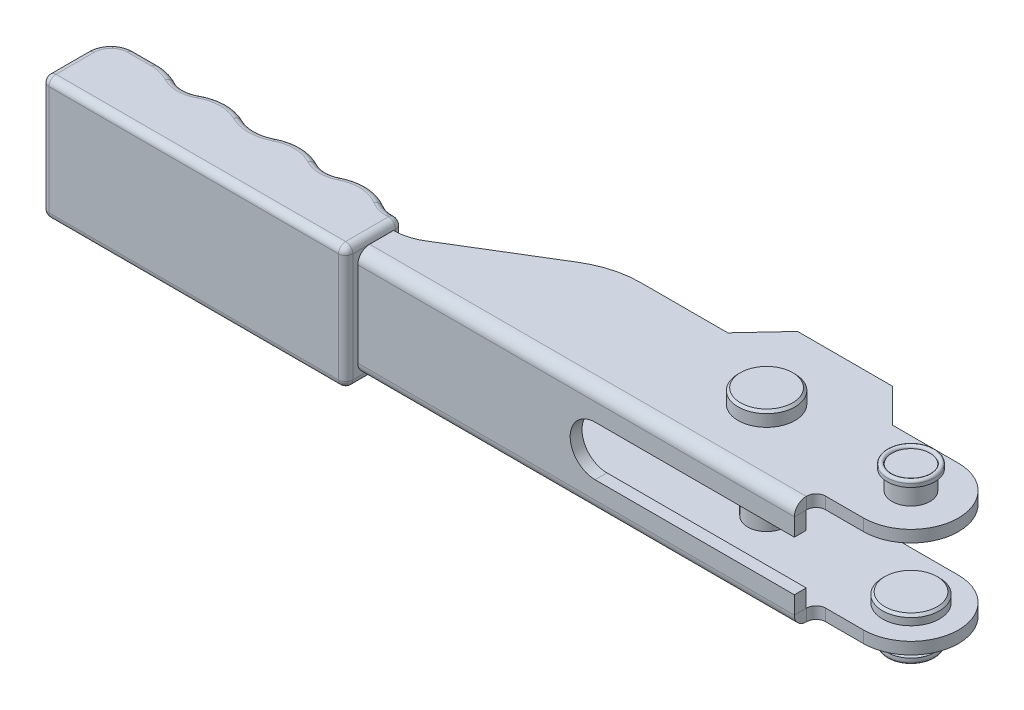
ISO-10303-21;
HEADER;
FILE_DESCRIPTION(('STEP AP214'),'2;1');
FILE_NAME('part.step','',(''),(''),'','','');
FILE_SCHEMA(('AUTOMOTIVE_DESIGN { 1 0 10303 214 1 1 1 1 }'));
ENDSEC;
DATA;
#1=APPLICATION_CONTEXT('core data for automotive mechanical design processes');
#2=APPLICATION_PROTOCOL_DEFINITION('international standard','automotive_design',2000,#1);
#3=PRODUCT_CONTEXT('',#1,'mechanical');
#4=PRODUCT('Part','Part','',(#3));
#5=PRODUCT_RELATED_PRODUCT_CATEGORY('part','',(#4));
#6=PRODUCT_DEFINITION_FORMATION('','',#4);
#7=PRODUCT_DEFINITION_CONTEXT('part definition',#1,'design');
#8=PRODUCT_DEFINITION('design','',#6,#7);
#9=PRODUCT_DEFINITION_SHAPE('','',#8);
#10=(LENGTH_UNIT() NAMED_UNIT(*) SI_UNIT(.MILLI.,.METRE.));
#11=(NAMED_UNIT(*) PLANE_ANGLE_UNIT() SI_UNIT($,.RADIAN.));
#12=(NAMED_UNIT(*) SI_UNIT($,.STERADIAN.) SOLID_ANGLE_UNIT());
#13=UNCERTAINTY_MEASURE_WITH_UNIT(LENGTH_MEASURE(1.E-05),#10,'distance_accuracy_value','');
#14=(GEOMETRIC_REPRESENTATION_CONTEXT(3) GLOBAL_UNCERTAINTY_ASSIGNED_CONTEXT((#13)) GLOBAL_UNIT_ASSIGNED_CONTEXT((#10,
#11,#12)) REPRESENTATION_CONTEXT('',''));
#15=CARTESIAN_POINT('',(0.,0.,0.));
#16=DIRECTION('',(0.,0.,1.));
#17=DIRECTION('',(1.,0.,0.));
#18=AXIS2_PLACEMENT_3D('',#15,#16,#17);
#19=CARTESIAN_POINT('',(0.,6.96825229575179,0.));
#20=DIRECTION('',(0.,-1.,0.));
#21=DIRECTION('',(0.999448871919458,0.,0.0331956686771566));
#22=AXIS2_PLACEMENT_3D('',#19,#20,#21);
#23=PLANE('',#22);
#24=CARTESIAN_POINT('',(0.,6.96825229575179,0.));
#25=DIRECTION('',(0.,-1.,0.));
#26=DIRECTION('',(0.999448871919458,0.,0.0331956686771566));
#27=AXIS2_PLACEMENT_3D('',#24,#25,#26);
#28=CIRCLE('',#27,5.5);
#29=CARTESIAN_POINT('',(5.49696879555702,6.96825229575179,0.182576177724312));
#30=VERTEX_POINT('',#29);
#31=EDGE_CURVE('E2802',#30,#30,#28,.T.);
#32=ORIENTED_EDGE('',*,*,#31,.T.);
#33=EDGE_LOOP('',(#32));
#34=FACE_BOUND('',#33,.T.);
#35=ADVANCED_FACE('F14',(#34),#23,.T.);
#36=CARTESIAN_POINT('',(0.,6.96825229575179,0.));
#37=DIRECTION('',(0.,1.,0.));
#38=DIRECTION('',(-0.999448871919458,0.,-0.0331956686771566));
#39=AXIS2_PLACEMENT_3D('',#36,#37,#38);
#40=CONICAL_SURFACE('',#39,5.5,0.785398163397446);
#41=CARTESIAN_POINT('',(0.,7.46825229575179,0.));
#42=DIRECTION('',(0.,1.,0.));
#43=DIRECTION('',(0.999448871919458,0.,0.0331956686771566));
#44=AXIS2_PLACEMENT_3D('',#41,#42,#43);
#45=CIRCLE('',#44,6.);
#46=CARTESIAN_POINT('',(5.99669323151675,7.46825229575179,0.199174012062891));
#47=VERTEX_POINT('',#46);
#48=EDGE_CURVE('E2812',#47,#47,#45,.T.);
#49=ORIENTED_EDGE('',*,*,#48,.F.);
#50=EDGE_LOOP('',(#49));
#51=FACE_BOUND('',#50,.T.);
#52=ORIENTED_EDGE('',*,*,#31,.F.);
#53=EDGE_LOOP('',(#52));
#54=FACE_BOUND('',#53,.T.);
#55=ADVANCED_FACE('F1659',(#51,#54),#40,.T.);
#56=CARTESIAN_POINT('',(0.,6.96825229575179,0.));
#57=DIRECTION('',(0.,-1.,0.));
#58=DIRECTION('',(0.999448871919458,0.,0.0331956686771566));
#59=AXIS2_PLACEMENT_3D('',#56,#57,#58);
#60=CYLINDRICAL_SURFACE('',#59,6.);
#61=ORIENTED_EDGE('',*,*,#48,.T.);
#62=EDGE_LOOP('',(#61));
#63=FACE_BOUND('',#62,.T.);
#64=CARTESIAN_POINT('',(0.,8.96825229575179,0.));
#65=DIRECTION('',(0.,-1.,0.));
#66=DIRECTION('',(0.999448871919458,0.,0.0331956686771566));
#67=AXIS2_PLACEMENT_3D('',#64,#65,#66);
#68=CIRCLE('',#67,6.);
#69=CARTESIAN_POINT('',(5.99669323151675,8.96825229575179,0.199174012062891));
#70=VERTEX_POINT('',#69);
#71=EDGE_CURVE('E24',#70,#70,#68,.T.);
#72=ORIENTED_EDGE('',*,*,#71,.T.);
#73=EDGE_LOOP('',(#72));
#74=FACE_BOUND('',#73,.T.);
#75=ADVANCED_FACE('F1666',(#63,#74),#60,.T.);
#76=CARTESIAN_POINT('',(0.,6.96825229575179,0.));
#77=DIRECTION('',(0.,-1.,0.));
#78=DIRECTION('',(0.999448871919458,0.,0.0331956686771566));
#79=AXIS2_PLACEMENT_3D('',#76,#77,#78);
#80=CYLINDRICAL_SURFACE('',#79,4.);
#81=CARTESIAN_POINT('',(0.,11.4682522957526,0.));
#82=DIRECTION('',(0.,1.,0.));
#83=DIRECTION('',(-1.,0.,0.));
#84=AXIS2_PLACEMENT_3D('',#81,#82,#83);
#85=CIRCLE('',#84,4.);
#86=CARTESIAN_POINT('',(-4.,11.4682522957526,0.));
#87=VERTEX_POINT('',#86);
#88=EDGE_CURVE('E9',#87,#87,#85,.F.);
#89=ORIENTED_EDGE('',*,*,#88,.F.);
#90=EDGE_LOOP('',(#89));
#91=FACE_BOUND('',#90,.T.);
#92=CARTESIAN_POINT('',(0.,15.5682522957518,0.));
#93=DIRECTION('',(0.,-1.,0.));
#94=DIRECTION('',(0.0331956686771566,0.,-0.999448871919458));
#95=AXIS2_PLACEMENT_3D('',#92,#93,#94);
#96=CIRCLE('',#95,4.);
#97=CARTESIAN_POINT('',(0.132782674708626,15.5682522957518,-3.99779548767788));
#98=VERTEX_POINT('',#97);
#99=EDGE_CURVE('E2805',#98,#98,#96,.T.);
#100=ORIENTED_EDGE('',*,*,#99,.T.);
#101=EDGE_LOOP('',(#100));
#102=FACE_BOUND('',#101,.T.);
#103=ADVANCED_FACE('F1773',(#91,#102),#80,.T.);
#104=CARTESIAN_POINT('',(0.,15.5682522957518,0.));
#105=DIRECTION('',(0.,-1.,0.));
#106=DIRECTION('',(0.0331956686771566,0.,-0.999448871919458));
#107=AXIS2_PLACEMENT_3D('',#104,#105,#106);
#108=PLANE('',#107);
#109=ORIENTED_EDGE('',*,*,#99,.F.);
#110=EDGE_LOOP('',(#109));
#111=FACE_BOUND('',#110,.T.);
#112=CARTESIAN_POINT('',(0.,15.5682522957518,0.));
#113=DIRECTION('',(0.,-1.,0.));
#114=DIRECTION('',(0.0331956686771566,0.,-0.999448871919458));
#115=AXIS2_PLACEMENT_3D('',#112,#113,#114);
#116=CIRCLE('',#115,5.);
#117=CARTESIAN_POINT('',(0.165978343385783,15.5682522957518,-4.99724435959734));
#118=VERTEX_POINT('',#117);
#119=EDGE_CURVE('E2716',#118,#118,#116,.T.);
#120=ORIENTED_EDGE('',*,*,#119,.T.);
#121=EDGE_LOOP('',(#120));
#122=FACE_BOUND('',#121,.T.);
#123=ADVANCED_FACE('F1676',(#111,#122),#108,.T.);
#124=CARTESIAN_POINT('',(0.132782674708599,16.2982522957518,-3.9977954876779));
#125=DIRECTION('',(0.,1.,0.));
#126=DIRECTION('',(-0.0331956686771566,0.,0.999448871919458));
#127=AXIS2_PLACEMENT_3D('',#124,#125,#126);
#128=PLANE('',#127);
#129=CARTESIAN_POINT('',(0.,16.2982522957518,0.));
#130=DIRECTION('',(0.,1.,0.));
#131=DIRECTION('',(-0.999448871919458,0.,-0.0331956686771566));
#132=AXIS2_PLACEMENT_3D('',#129,#130,#131);
#133=CIRCLE('',#132,4.);
#134=CARTESIAN_POINT('',(-3.99779548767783,16.2982522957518,-0.132782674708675));
#135=VERTEX_POINT('',#134);
#136=EDGE_CURVE('E2712',#135,#135,#133,.T.);
#137=ORIENTED_EDGE('',*,*,#136,.T.);
#138=EDGE_LOOP('',(#137));
#139=FACE_BOUND('',#138,.T.);
#140=ADVANCED_FACE('F1672',(#139),#128,.T.);
#141=CARTESIAN_POINT('',(0.,16.2982522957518,0.));
#142=DIRECTION('',(0.,1.,0.));
#143=DIRECTION('',(-0.999448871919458,0.,-0.0331956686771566));
#144=AXIS2_PLACEMENT_3D('',#141,#142,#143);
#145=TOROIDAL_SURFACE('',#144,4.5,0.5);
#146=ORIENTED_EDGE('',*,*,#136,.F.);
#147=EDGE_LOOP('',(#146));
#148=FACE_BOUND('',#147,.T.);
#149=CARTESIAN_POINT('',(0.,16.2982522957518,0.));
#150=DIRECTION('',(0.,-1.,0.));
#151=DIRECTION('',(0.999448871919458,0.,0.0331956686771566));
#152=AXIS2_PLACEMENT_3D('',#149,#150,#151);
#153=CIRCLE('',#152,5.);
#154=CARTESIAN_POINT('',(4.99724435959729,16.2982522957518,0.165978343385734));
#155=VERTEX_POINT('',#154);
#156=EDGE_CURVE('E2715',#155,#155,#153,.T.);
#157=ORIENTED_EDGE('',*,*,#156,.F.);
#158=EDGE_LOOP('',(#157));
#159=FACE_BOUND('',#158,.T.);
#160=ADVANCED_FACE('F1675',(#148,#159),#145,.T.);
#161=CARTESIAN_POINT('',(0.,15.2982522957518,0.));
#162=DIRECTION('',(0.,1.,0.));
#163=DIRECTION('',(-0.999448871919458,0.,-0.0331956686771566));
#164=AXIS2_PLACEMENT_3D('',#161,#162,#163);
#165=CYLINDRICAL_SURFACE('',#164,5.);
#166=ORIENTED_EDGE('',*,*,#156,.T.);
#167=EDGE_LOOP('',(#166));
#168=FACE_BOUND('',#167,.T.);
#169=ORIENTED_EDGE('',*,*,#119,.F.);
#170=EDGE_LOOP('',(#169));
#171=FACE_BOUND('',#170,.T.);
#172=ADVANCED_FACE('F1715',(#168,#171),#165,.T.);
#173=CARTESIAN_POINT('',(2.1877765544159,-16.2982522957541,-3.34867641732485));
#174=DIRECTION('',(0.,-1.,0.));
#175=DIRECTION('',(-0.546944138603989,0.,0.837169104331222));
#176=AXIS2_PLACEMENT_3D('',#173,#174,#175);
#177=PLANE('',#176);
#178=CARTESIAN_POINT('',(0.,-16.2982522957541,0.));
#179=DIRECTION('',(0.,-1.,0.));
#180=DIRECTION('',(0.837169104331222,0.,0.546944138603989));
#181=AXIS2_PLACEMENT_3D('',#178,#179,#180);
#182=CIRCLE('',#181,4.);
#183=CARTESIAN_POINT('',(3.34867641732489,-16.298252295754,2.187776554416));
#184=VERTEX_POINT('',#183);
#185=EDGE_CURVE('E2825',#184,#184,#182,.T.);
#186=ORIENTED_EDGE('',*,*,#185,.T.);
#187=EDGE_LOOP('',(#186));
#188=FACE_BOUND('',#187,.T.);
#189=ADVANCED_FACE('F1688',(#188),#177,.T.);
#190=CARTESIAN_POINT('',(0.,-16.2982522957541,0.));
#191=DIRECTION('',(0.,-1.,0.));
#192=DIRECTION('',(0.837169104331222,0.,0.546944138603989));
#193=AXIS2_PLACEMENT_3D('',#190,#191,#192);
#194=TOROIDAL_SURFACE('',#193,4.5,0.5);
#195=ORIENTED_EDGE('',*,*,#185,.F.);
#196=EDGE_LOOP('',(#195));
#197=FACE_BOUND('',#196,.T.);
#198=CARTESIAN_POINT('',(0.,-16.2982522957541,0.));
#199=DIRECTION('',(0.,1.,0.));
#200=DIRECTION('',(-0.837169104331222,0.,-0.546944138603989));
#201=AXIS2_PLACEMENT_3D('',#198,#199,#200);
#202=CIRCLE('',#201,5.);
#203=CARTESIAN_POINT('',(-4.18584552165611,-16.2982522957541,-2.7347206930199));
#204=VERTEX_POINT('',#203);
#205=EDGE_CURVE('E2829',#204,#204,#202,.T.);
#206=ORIENTED_EDGE('',*,*,#205,.F.);
#207=EDGE_LOOP('',(#206));
#208=FACE_BOUND('',#207,.T.);
#209=ADVANCED_FACE('F1684',(#197,#208),#194,.T.);
#210=CARTESIAN_POINT('',(-164.530093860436,-11.5,15.6436440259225));
#211=DIRECTION('',(-1.,0.,0.));
#212=DIRECTION('',(0.,0.,-1.));
#213=AXIS2_PLACEMENT_3D('',#210,#211,#212);
#214=SPHERICAL_SURFACE('',#213,1.5);
#215=CARTESIAN_POINT('',(-164.530093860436,-11.5,15.6436440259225));
#216=DIRECTION('',(0.,-1.,0.));
#217=DIRECTION('',(0.,0.,1.));
#218=AXIS2_PLACEMENT_3D('',#215,#216,#217);
#219=CIRCLE('',#218,1.5);
#220=CARTESIAN_POINT('',(-164.530093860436,-11.5,17.1436440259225));
#221=VERTEX_POINT('',#220);
#222=CARTESIAN_POINT('',(-166.030093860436,-11.5,15.6436440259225));
#223=VERTEX_POINT('',#222);
#224=EDGE_CURVE('E501',#221,#223,#219,.T.);
#225=ORIENTED_EDGE('',*,*,#224,.T.);
#226=CARTESIAN_POINT('',(-164.530093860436,-11.5,15.6436440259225));
#227=DIRECTION('',(0.,0.,1.));
#228=DIRECTION('',(0.,1.,0.));
#229=AXIS2_PLACEMENT_3D('',#226,#227,#228);
#230=CIRCLE('',#229,1.5);
#231=CARTESIAN_POINT('',(-164.530093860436,-13.,15.6436440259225));
#232=VERTEX_POINT('',#231);
#233=EDGE_CURVE('E497',#223,#232,#230,.T.);
#234=ORIENTED_EDGE('',*,*,#233,.T.);
#235=CARTESIAN_POINT('',(-164.530093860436,-11.5,15.6436440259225));
#236=DIRECTION('',(1.,0.,0.));
#237=DIRECTION('',(0.,1.,0.));
#238=AXIS2_PLACEMENT_3D('',#235,#236,#237);
#239=CIRCLE('',#238,1.5);
#240=EDGE_CURVE('E614',#221,#232,#239,.T.);
#241=ORIENTED_EDGE('',*,*,#240,.F.);
#242=EDGE_LOOP('',(#225,#234,#241));
#243=FACE_BOUND('',#242,.T.);
#244=ADVANCED_FACE('F1687',(#243),#214,.T.);
#245=CARTESIAN_POINT('',(-155.94338504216,11.,2.59123084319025));
#246=DIRECTION('',(6.30928318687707E-08,0.,1.));
#247=DIRECTION('',(-1.,0.,6.30928318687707E-08));
#248=AXIS2_PLACEMENT_3D('',#245,#246,#247);
#249=PLANE('',#248);
#250=DIRECTION('',(0.,-1.,0.));
#251=VECTOR('',#250,1.);
#252=CARTESIAN_POINT('',(-155.94338504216,11.,2.59123084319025));
#253=LINE('',#252,#251);
#254=CARTESIAN_POINT('',(-155.94338504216,11.5,2.59123084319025));
#255=VERTEX_POINT('',#254);
#256=CARTESIAN_POINT('',(-155.94338504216,-11.5,2.59123084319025));
#257=VERTEX_POINT('',#256);
#258=EDGE_CURVE('E334',#255,#257,#253,.T.);
#259=ORIENTED_EDGE('',*,*,#258,.T.);
#260=DIRECTION('',(-1.,0.,6.30928318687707E-08));
#261=VECTOR('',#260,1.);
#262=CARTESIAN_POINT('',(-155.94338504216,-11.5,2.59123084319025));
#263=LINE('',#262,#261);
#264=CARTESIAN_POINT('',(-161.020383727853,-11.5,2.59123116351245));
#265=VERTEX_POINT('',#264);
#266=EDGE_CURVE('E417',#257,#265,#263,.T.);
#267=ORIENTED_EDGE('',*,*,#266,.T.);
#268=DIRECTION('',(0.,-1.,0.));
#269=VECTOR('',#268,1.);
#270=CARTESIAN_POINT('',(-161.020383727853,11.,2.59123116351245));
#271=LINE('',#270,#269);
#272=CARTESIAN_POINT('',(-161.020383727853,11.5,2.59123116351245));
#273=VERTEX_POINT('',#272);
#274=EDGE_CURVE('E429',#273,#265,#271,.T.);
#275=ORIENTED_EDGE('',*,*,#274,.F.);
#276=DIRECTION('',(1.,0.,-6.30928318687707E-08));
#277=VECTOR('',#276,1.);
#278=CARTESIAN_POINT('',(-155.94338504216,11.5,2.59123084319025));
#279=LINE('',#278,#277);
#280=EDGE_CURVE('E459',#273,#255,#279,.T.);
#281=ORIENTED_EDGE('',*,*,#280,.T.);
#282=EDGE_LOOP('',(#259,#267,#275,#281));
#283=FACE_BOUND('',#282,.T.);
#284=ADVANCED_FACE('F1911',(#283),#249,.F.);
#285=CARTESIAN_POINT('',(-155.943384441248,11.,12.1154909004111));
#286=DIRECTION('',(0.,-1.,0.));
#287=DIRECTION('',(0.,0.,1.));
#288=AXIS2_PLACEMENT_3D('',#285,#286,#287);
#289=CYLINDRICAL_SURFACE('',#288,9.52426005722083);
#290=DIRECTION('',(0.,-1.,0.));
#291=VECTOR('',#290,1.);
#292=CARTESIAN_POINT('',(-151.367319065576,11.,3.76257791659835));
#293=LINE('',#292,#291);
#294=CARTESIAN_POINT('',(-151.367319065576,11.5,3.76257791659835));
#295=VERTEX_POINT('',#294);
#296=CARTESIAN_POINT('',(-151.367319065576,-11.5,3.76257791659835));
#297=VERTEX_POINT('',#296);
#298=EDGE_CURVE('E516',#295,#297,#293,.T.);
#299=ORIENTED_EDGE('',*,*,#298,.T.);
#300=CARTESIAN_POINT('',(-155.943384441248,-11.5,12.1154909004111));
#301=DIRECTION('',(0.,1.,0.));
#302=DIRECTION('',(0.,0.,-1.));
#303=AXIS2_PLACEMENT_3D('',#300,#301,#302);
#304=CIRCLE('',#303,9.52426005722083);
#305=EDGE_CURVE('E333',#297,#257,#304,.T.);
#306=ORIENTED_EDGE('',*,*,#305,.T.);
#307=ORIENTED_EDGE('',*,*,#258,.F.);
#308=CARTESIAN_POINT('',(-155.943384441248,11.5,12.1154909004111));
#309=DIRECTION('',(0.,-1.,0.));
#310=DIRECTION('',(0.,0.,-1.));
#311=AXIS2_PLACEMENT_3D('',#308,#309,#310);
#312=CIRCLE('',#311,9.52426005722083);
#313=EDGE_CURVE('E330',#255,#295,#312,.T.);
#314=ORIENTED_EDGE('',*,*,#313,.T.);
#315=EDGE_LOOP('',(#299,#306,#307,#314));
#316=FACE_BOUND('',#315,.T.);
#317=ADVANCED_FACE('F1954',(#316),#289,.T.);
#318=CARTESIAN_POINT('',(-148.713110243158,11.,-1.0822775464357));
#319=DIRECTION('',(0.,-1.,0.));
#320=DIRECTION('',(0.,0.,1.));
#321=AXIS2_PLACEMENT_3D('',#318,#319,#320);
#322=CYLINDRICAL_SURFACE('',#321,5.52426003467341);
#323=CARTESIAN_POINT('',(-148.713110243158,11.5,-1.0822775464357));
#324=DIRECTION('',(0.,1.,0.));
#325=DIRECTION('',(0.,0.,-1.));
#326=AXIS2_PLACEMENT_3D('',#323,#324,#325);
#327=CIRCLE('',#326,5.52426003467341);
#328=CARTESIAN_POINT('',(-146.058249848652,11.5,3.7622209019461));
#329=VERTEX_POINT('',#328);
#330=EDGE_CURVE('E455',#295,#329,#327,.T.);
#331=ORIENTED_EDGE('',*,*,#330,.T.);
#332=DIRECTION('',(0.,-1.,0.));
#333=VECTOR('',#332,1.);
#334=CARTESIAN_POINT('',(-146.058249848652,11.,3.7622209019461));
#335=LINE('',#334,#333);
#336=CARTESIAN_POINT('',(-146.058249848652,-11.5,3.7622209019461));
#337=VERTEX_POINT('',#336);
#338=EDGE_CURVE('E511',#329,#337,#335,.T.);
#339=ORIENTED_EDGE('',*,*,#338,.T.);
#340=CARTESIAN_POINT('',(-148.713110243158,-11.5,-1.0822775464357));
#341=DIRECTION('',(0.,-1.,0.));
#342=DIRECTION('',(0.,0.,-1.));
#343=AXIS2_PLACEMENT_3D('',#340,#341,#342);
#344=CIRCLE('',#343,5.52426003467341);
#345=EDGE_CURVE('E451',#337,#297,#344,.T.);
#346=ORIENTED_EDGE('',*,*,#345,.T.);
#347=ORIENTED_EDGE('',*,*,#298,.F.);
#348=EDGE_LOOP('',(#331,#339,#346,#347));
#349=FACE_BOUND('',#348,.T.);
#350=ADVANCED_FACE('F1958',(#349),#322,.F.);
#351=CARTESIAN_POINT('',(-141.481061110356,11.,12.1145183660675));
#352=DIRECTION('',(0.,-1.,0.));
#353=DIRECTION('',(0.,0.,1.));
#354=AXIS2_PLACEMENT_3D('',#351,#352,#353);
#355=CYLINDRICAL_SURFACE('',#354,9.52426005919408);
#356=DIRECTION('',(0.,-1.,0.));
#357=VECTOR('',#356,1.);
#358=CARTESIAN_POINT('',(-137.195703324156,11.,3.60880038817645));
#359=LINE('',#358,#357);
#360=CARTESIAN_POINT('',(-137.195703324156,11.5,3.60880038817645));
#361=VERTEX_POINT('',#360);
#362=CARTESIAN_POINT('',(-137.195703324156,-11.5,3.60880038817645));
#363=VERTEX_POINT('',#362);
#364=EDGE_CURVE('E364',#361,#363,#359,.T.);
#365=ORIENTED_EDGE('',*,*,#364,.T.);
#366=CARTESIAN_POINT('',(-141.481061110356,-11.5,12.1145183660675));
#367=DIRECTION('',(0.,1.,0.));
#368=DIRECTION('',(0.,0.,-1.));
#369=AXIS2_PLACEMENT_3D('',#366,#367,#368);
#370=CIRCLE('',#369,9.52426005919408);
#371=EDGE_CURVE('E369',#363,#337,#370,.T.);
#372=ORIENTED_EDGE('',*,*,#371,.T.);
#373=ORIENTED_EDGE('',*,*,#338,.F.);
#374=CARTESIAN_POINT('',(-141.481061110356,11.5,12.1145183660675));
#375=DIRECTION('',(0.,-1.,0.));
#376=DIRECTION('',(0.,0.,-1.));
#377=AXIS2_PLACEMENT_3D('',#374,#375,#376);
#378=CIRCLE('',#377,9.52426005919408);
#379=EDGE_CURVE('E515',#329,#361,#378,.T.);
#380=ORIENTED_EDGE('',*,*,#379,.T.);
#381=EDGE_LOOP('',(#365,#372,#373,#380));
#382=FACE_BOUND('',#381,.T.);
#383=ADVANCED_FACE('F1857',(#382),#355,.T.);
#384=CARTESIAN_POINT('',(-133.694468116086,11.,-3.3405655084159));
#385=DIRECTION('',(0.,-1.,0.));
#386=DIRECTION('',(0.,0.,1.));
#387=AXIS2_PLACEMENT_3D('',#384,#385,#386);
#388=CYLINDRICAL_SURFACE('',#387,7.78153804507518);
#389=CARTESIAN_POINT('',(-133.694468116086,11.5,-3.3405655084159));
#390=DIRECTION('',(0.,1.,0.));
#391=DIRECTION('',(0.,0.,-1.));
#392=AXIS2_PLACEMENT_3D('',#389,#390,#391);
#393=CIRCLE('',#392,7.78153804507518);
#394=CARTESIAN_POINT('',(-130.192298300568,11.5,3.60832943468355));
#395=VERTEX_POINT('',#394);
#396=EDGE_CURVE('E296',#361,#395,#393,.T.);
#397=ORIENTED_EDGE('',*,*,#396,.T.);
#398=DIRECTION('',(0.,-1.,0.));
#399=VECTOR('',#398,1.);
#400=CARTESIAN_POINT('',(-130.192298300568,11.,3.60832943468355));
#401=LINE('',#400,#399);
#402=CARTESIAN_POINT('',(-130.192298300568,-11.5,3.60832943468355));
#403=VERTEX_POINT('',#402);
#404=EDGE_CURVE('E368',#395,#403,#401,.T.);
#405=ORIENTED_EDGE('',*,*,#404,.T.);
#406=CARTESIAN_POINT('',(-133.694468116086,-11.5,-3.3405655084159));
#407=DIRECTION('',(0.,-1.,0.));
#408=DIRECTION('',(0.,0.,-1.));
#409=AXIS2_PLACEMENT_3D('',#406,#407,#408);
#410=CIRCLE('',#409,7.78153804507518);
#411=EDGE_CURVE('E463',#403,#363,#410,.T.);
#412=ORIENTED_EDGE('',*,*,#411,.T.);
#413=ORIENTED_EDGE('',*,*,#364,.F.);
#414=EDGE_LOOP('',(#397,#405,#412,#413));
#415=FACE_BOUND('',#414,.T.);
#416=ADVANCED_FACE('F1854',(#415),#388,.F.);
#417=CARTESIAN_POINT('',(-125.905796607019,11.,12.1134709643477));
#418=DIRECTION('',(0.,-1.,0.));
#419=DIRECTION('',(0.,0.,1.));
#420=AXIS2_PLACEMENT_3D('',#417,#418,#419);
#421=CYLINDRICAL_SURFACE('',#420,9.52426003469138);
#422=DIRECTION('',(0.,-1.,0.));
#423=VECTOR('',#422,1.);
#424=CARTESIAN_POINT('',(-121.329731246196,11.,3.76055799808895));
#425=LINE('',#424,#423);
#426=CARTESIAN_POINT('',(-121.329731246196,11.5,3.76055799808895));
#427=VERTEX_POINT('',#426);
#428=CARTESIAN_POINT('',(-121.329731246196,-11.5,3.76055799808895));
#429=VERTEX_POINT('',#428);
#430=EDGE_CURVE('E486',#427,#429,#425,.T.);
#431=ORIENTED_EDGE('',*,*,#430,.T.);
#432=CARTESIAN_POINT('',(-125.905796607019,-11.5,12.1134709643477));
#433=DIRECTION('',(0.,1.,0.));
#434=DIRECTION('',(0.,0.,-1.));
#435=AXIS2_PLACEMENT_3D('',#432,#433,#434);
#436=CIRCLE('',#435,9.52426003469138);
#437=EDGE_CURVE('E490',#429,#403,#436,.T.);
#438=ORIENTED_EDGE('',*,*,#437,.T.);
#439=ORIENTED_EDGE('',*,*,#404,.F.);
#440=CARTESIAN_POINT('',(-125.905796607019,11.5,12.1134709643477));
#441=DIRECTION('',(0.,-1.,0.));
#442=DIRECTION('',(0.,0.,-1.));
#443=AXIS2_PLACEMENT_3D('',#440,#441,#442);
#444=CIRCLE('',#443,9.52426003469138);
#445=EDGE_CURVE('E534',#395,#427,#444,.T.);
#446=ORIENTED_EDGE('',*,*,#445,.T.);
#447=EDGE_LOOP('',(#431,#438,#439,#446));
#448=FACE_BOUND('',#447,.T.);
#449=ADVANCED_FACE('F16',(#448),#421,.T.);
#450=CARTESIAN_POINT('',(-118.675522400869,11.,-1.0842975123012));
#451=DIRECTION('',(0.,-1.,0.));
#452=DIRECTION('',(0.,0.,1.));
#453=AXIS2_PLACEMENT_3D('',#450,#451,#452);
#454=CYLINDRICAL_SURFACE('',#453,5.5242600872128);
#455=CARTESIAN_POINT('',(-118.675522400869,11.5,-1.0842975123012));
#456=DIRECTION('',(0.,1.,0.));
#457=DIRECTION('',(0.,0.,-1.));
#458=AXIS2_PLACEMENT_3D('',#455,#456,#457);
#459=CIRCLE('',#458,5.5242600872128);
#460=CARTESIAN_POINT('',(-116.19562030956,11.5,3.8520508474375));
#461=VERTEX_POINT('',#460);
#462=EDGE_CURVE('E460',#427,#461,#459,.T.);
#463=ORIENTED_EDGE('',*,*,#462,.T.);
#464=DIRECTION('',(0.,-1.,0.));
#465=VECTOR('',#464,1.);
#466=CARTESIAN_POINT('',(-116.19562030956,11.,3.8520508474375));
#467=LINE('',#466,#465);
#468=CARTESIAN_POINT('',(-116.19562030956,-11.5,3.8520508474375));
#469=VERTEX_POINT('',#468);
#470=EDGE_CURVE('E379',#461,#469,#467,.T.);
#471=ORIENTED_EDGE('',*,*,#470,.T.);
#472=CARTESIAN_POINT('',(-118.675522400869,-11.5,-1.0842975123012));
#473=DIRECTION('',(0.,-1.,0.));
#474=DIRECTION('',(0.,0.,-1.));
#475=AXIS2_PLACEMENT_3D('',#472,#473,#474);
#476=CIRCLE('',#475,5.5242600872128);
#477=EDGE_CURVE('E464',#469,#429,#476,.T.);
#478=ORIENTED_EDGE('',*,*,#477,.T.);
#479=ORIENTED_EDGE('',*,*,#430,.F.);
#480=EDGE_LOOP('',(#463,#471,#478,#479));
#481=FACE_BOUND('',#480,.T.);
#482=ADVANCED_FACE('F1829',(#481),#454,.F.);
#483=CARTESIAN_POINT('',(-111.920073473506,11.,12.3627048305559));
#484=DIRECTION('',(0.,-1.,0.));
#485=DIRECTION('',(0.,0.,1.));
#486=AXIS2_PLACEMENT_3D('',#483,#484,#485);
#487=CYLINDRICAL_SURFACE('',#486,9.52426017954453);
#488=DIRECTION('',(0.,-1.,0.));
#489=VECTOR('',#488,1.);
#490=CARTESIAN_POINT('',(-106.862645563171,11.,4.29214382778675));
#491=LINE('',#490,#489);
#492=CARTESIAN_POINT('',(-106.862645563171,11.5,4.29214382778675));
#493=VERTEX_POINT('',#492);
#494=CARTESIAN_POINT('',(-106.862645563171,-11.5,4.29214382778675));
#495=VERTEX_POINT('',#494);
#496=EDGE_CURVE('E400',#493,#495,#491,.T.);
#497=ORIENTED_EDGE('',*,*,#496,.T.);
#498=CARTESIAN_POINT('',(-111.920073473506,-11.5,12.3627048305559));
#499=DIRECTION('',(0.,1.,0.));
#500=DIRECTION('',(0.,0.,-1.));
#501=AXIS2_PLACEMENT_3D('',#498,#499,#500);
#502=CIRCLE('',#501,9.52426017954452);
#503=EDGE_CURVE('E378',#495,#469,#502,.T.);
#504=ORIENTED_EDGE('',*,*,#503,.T.);
#505=ORIENTED_EDGE('',*,*,#470,.F.);
#506=CARTESIAN_POINT('',(-111.920073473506,11.5,12.3627048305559));
#507=DIRECTION('',(0.,-1.,0.));
#508=DIRECTION('',(0.,0.,-1.));
#509=AXIS2_PLACEMENT_3D('',#506,#507,#508);
#510=CIRCLE('',#509,9.52426017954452);
#511=EDGE_CURVE('E375',#461,#493,#510,.T.);
#512=ORIENTED_EDGE('',*,*,#511,.T.);
#513=EDGE_LOOP('',(#497,#504,#505,#512));
#514=FACE_BOUND('',#513,.T.);
#515=ADVANCED_FACE('F1832',(#514),#487,.T.);
#516=CARTESIAN_POINT('',(-166.030093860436,11.,12.6355573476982));
#517=DIRECTION('',(1.,0.,0.));
#518=DIRECTION('',(0.,-1.,0.));
#519=AXIS2_PLACEMENT_3D('',#516,#517,#518);
#520=PLANE('',#519);
#521=DIRECTION('',(0.,-1.,0.));
#522=VECTOR('',#521,1.);
#523=CARTESIAN_POINT('',(-166.030093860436,11.,7.6009416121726));
#524=LINE('',#523,#522);
#525=CARTESIAN_POINT('',(-166.030093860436,11.5,7.6009416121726));
#526=VERTEX_POINT('',#525);
#527=CARTESIAN_POINT('',(-166.030093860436,-11.5,7.6009416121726));
#528=VERTEX_POINT('',#527);
#529=EDGE_CURVE('E493',#526,#528,#524,.T.);
#530=ORIENTED_EDGE('',*,*,#529,.T.);
#531=DIRECTION('',(0.,0.,1.));
#532=VECTOR('',#531,1.);
#533=CARTESIAN_POINT('',(-166.030093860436,-11.5,12.6355573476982));
#534=LINE('',#533,#532);
#535=EDGE_CURVE('E576',#528,#223,#534,.T.);
#536=ORIENTED_EDGE('',*,*,#535,.T.);
#537=DIRECTION('',(0.,1.,0.));
#538=VECTOR('',#537,1.);
#539=CARTESIAN_POINT('',(-166.030093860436,11.,15.6436440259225));
#540=LINE('',#539,#538);
#541=CARTESIAN_POINT('',(-166.030093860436,11.5,15.6436440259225));
#542=VERTEX_POINT('',#541);
#543=EDGE_CURVE('E539',#223,#542,#540,.T.);
#544=ORIENTED_EDGE('',*,*,#543,.T.);
#545=DIRECTION('',(0.,0.,-1.));
#546=VECTOR('',#545,1.);
#547=CARTESIAN_POINT('',(-166.030093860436,11.5,7.6009416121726));
#548=LINE('',#547,#546);
#549=EDGE_CURVE('E362',#542,#526,#548,.T.);
#550=ORIENTED_EDGE('',*,*,#549,.T.);
#551=EDGE_LOOP('',(#530,#536,#544,#550));
#552=FACE_BOUND('',#551,.T.);
#553=ADVANCED_FACE('F1845',(#552),#520,.F.);
#554=CARTESIAN_POINT('',(-161.020383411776,11.,7.6009416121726));
#555=DIRECTION('',(0.,-1.,0.));
#556=DIRECTION('',(0.,0.,1.));
#557=AXIS2_PLACEMENT_3D('',#554,#555,#556);
#558=CYLINDRICAL_SURFACE('',#557,5.00971044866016);
#559=ORIENTED_EDGE('',*,*,#274,.T.);
#560=CARTESIAN_POINT('',(-161.020383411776,-11.5,7.6009416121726));
#561=DIRECTION('',(0.,1.,0.));
#562=DIRECTION('',(0.,0.,-1.));
#563=AXIS2_PLACEMENT_3D('',#560,#561,#562);
#564=CIRCLE('',#563,5.00971044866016);
#565=EDGE_CURVE('E425',#265,#528,#564,.T.);
#566=ORIENTED_EDGE('',*,*,#565,.T.);
#567=ORIENTED_EDGE('',*,*,#529,.F.);
#568=CARTESIAN_POINT('',(-161.020383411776,11.5,7.6009416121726));
#569=DIRECTION('',(0.,-1.,0.));
#570=DIRECTION('',(0.,0.,-1.));
#571=AXIS2_PLACEMENT_3D('',#568,#569,#570);
#572=CIRCLE('',#571,5.00971044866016);
#573=EDGE_CURVE('E430',#526,#273,#572,.T.);
#574=ORIENTED_EDGE('',*,*,#573,.T.);
#575=EDGE_LOOP('',(#559,#566,#567,#574));
#576=FACE_BOUND('',#575,.T.);
#577=ADVANCED_FACE('F1876',(#576),#558,.T.);
#578=CARTESIAN_POINT('',(-164.530093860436,11.5,15.6436440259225));
#579=DIRECTION('',(-1.,0.,0.));
#580=DIRECTION('',(0.,0.,-1.));
#581=AXIS2_PLACEMENT_3D('',#578,#579,#580);
#582=SPHERICAL_SURFACE('',#581,1.5);
#583=CARTESIAN_POINT('',(-164.530093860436,11.5,15.6436440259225));
#584=DIRECTION('',(1.,0.,0.));
#585=DIRECTION('',(0.,1.,0.));
#586=AXIS2_PLACEMENT_3D('',#583,#584,#585);
#587=CIRCLE('',#586,1.5);
#588=CARTESIAN_POINT('',(-164.530093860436,13.,15.6436440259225));
#589=VERTEX_POINT('',#588);
#590=CARTESIAN_POINT('',(-164.530093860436,11.5,17.1436440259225));
#591=VERTEX_POINT('',#590);
#592=EDGE_CURVE('E392',#589,#591,#587,.T.);
#593=ORIENTED_EDGE('',*,*,#592,.F.);
#594=CARTESIAN_POINT('',(-164.530093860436,11.5,15.6436440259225));
#595=DIRECTION('',(0.,0.,1.));
#596=DIRECTION('',(0.,1.,0.));
#597=AXIS2_PLACEMENT_3D('',#594,#595,#596);
#598=CIRCLE('',#597,1.5);
#599=EDGE_CURVE('E335',#589,#542,#598,.T.);
#600=ORIENTED_EDGE('',*,*,#599,.T.);
#601=CARTESIAN_POINT('',(-164.530093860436,11.5,15.6436440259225));
#602=DIRECTION('',(0.,-1.,0.));
#603=DIRECTION('',(0.,0.,-1.));
#604=AXIS2_PLACEMENT_3D('',#601,#602,#603);
#605=CIRCLE('',#604,1.5);
#606=EDGE_CURVE('E395',#591,#542,#605,.T.);
#607=ORIENTED_EDGE('',*,*,#606,.F.);
#608=EDGE_LOOP('',(#593,#600,#607));
#609=FACE_BOUND('',#608,.T.);
#610=ADVANCED_FACE('F1730',(#609),#582,.T.);
#611=CARTESIAN_POINT('',(-31.0000105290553,-12.5317477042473,-0.559998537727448));
#612=DIRECTION('',(0.,-1.,0.));
#613=DIRECTION('',(0.,0.,1.));
#614=AXIS2_PLACEMENT_3D('',#611,#612,#613);
#615=PLANE('',#614);
#616=CARTESIAN_POINT('',(-31.0000105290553,-12.5317477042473,-0.559998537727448));
#617=DIRECTION('',(0.,-1.,0.));
#618=DIRECTION('',(0.,0.,1.));
#619=AXIS2_PLACEMENT_3D('',#616,#617,#618);
#620=CIRCLE('',#619,3.5);
#621=CARTESIAN_POINT('',(-31.0000105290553,-12.5317477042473,2.94000146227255));
#622=VERTEX_POINT('',#621);
#623=EDGE_CURVE('E2850',#622,#622,#620,.T.);
#624=ORIENTED_EDGE('',*,*,#623,.T.);
#625=EDGE_LOOP('',(#624));
#626=FACE_BOUND('',#625,.T.);
#627=ADVANCED_FACE('F1694',(#626),#615,.T.);
#628=CARTESIAN_POINT('',(0.,-15.298252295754,0.));
#629=DIRECTION('',(0.,-1.,0.));
#630=DIRECTION('',(0.837169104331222,0.,0.546944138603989));
#631=AXIS2_PLACEMENT_3D('',#628,#629,#630);
#632=CYLINDRICAL_SURFACE('',#631,5.);
#633=ORIENTED_EDGE('',*,*,#205,.T.);
#634=EDGE_LOOP('',(#633));
#635=FACE_BOUND('',#634,.T.);
#636=CARTESIAN_POINT('',(0.,-15.568252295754,0.));
#637=DIRECTION('',(0.,1.,0.));
#638=DIRECTION('',(0.546944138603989,0.,-0.837169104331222));
#639=AXIS2_PLACEMENT_3D('',#636,#637,#638);
#640=CIRCLE('',#639,5.);
#641=CARTESIAN_POINT('',(2.73472069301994,-15.568252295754,-4.18584552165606));
#642=VERTEX_POINT('',#641);
#643=EDGE_CURVE('E2821',#642,#642,#640,.T.);
#644=ORIENTED_EDGE('',*,*,#643,.F.);
#645=EDGE_LOOP('',(#644));
#646=FACE_BOUND('',#645,.T.);
#647=ADVANCED_FACE('F1690',(#635,#646),#632,.T.);
#648=CARTESIAN_POINT('',(0.,-6.96825229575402,0.));
#649=DIRECTION('',(0.,1.,0.));
#650=DIRECTION('',(-0.837169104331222,0.,-0.546944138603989));
#651=AXIS2_PLACEMENT_3D('',#648,#649,#650);
#652=PLANE('',#651);
#653=CARTESIAN_POINT('',(0.,-6.96825229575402,0.));
#654=DIRECTION('',(0.,1.,0.));
#655=DIRECTION('',(-0.837169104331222,0.,-0.546944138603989));
#656=AXIS2_PLACEMENT_3D('',#653,#654,#655);
#657=CIRCLE('',#656,5.5);
#658=CARTESIAN_POINT('',(-4.60443007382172,-6.96825229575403,-3.00819276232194));
#659=VERTEX_POINT('',#658);
#660=EDGE_CURVE('E2832',#659,#659,#657,.T.);
#661=ORIENTED_EDGE('',*,*,#660,.T.);
#662=EDGE_LOOP('',(#661));
#663=FACE_BOUND('',#662,.T.);
#664=ADVANCED_FACE('F1693',(#663),#652,.T.);
#665=CARTESIAN_POINT('',(-103.929236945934,11.,-0.388941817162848));
#666=DIRECTION('',(0.,-1.,0.));
#667=DIRECTION('',(0.,0.,1.));
#668=AXIS2_PLACEMENT_3D('',#665,#666,#667);
#669=CYLINDRICAL_SURFACE('',#668,5.52426003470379);
#670=DIRECTION('',(0.,-1.,0.));
#671=VECTOR('',#670,1.);
#672=CARTESIAN_POINT('',(-103.929233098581,11.,5.13531821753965));
#673=LINE('',#672,#671);
#674=CARTESIAN_POINT('',(-103.929233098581,11.5,5.13531821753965));
#675=VERTEX_POINT('',#674);
#676=CARTESIAN_POINT('',(-103.929233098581,-11.5,5.13531821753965));
#677=VERTEX_POINT('',#676);
#678=EDGE_CURVE('E484',#675,#677,#673,.T.);
#679=ORIENTED_EDGE('',*,*,#678,.T.);
#680=CARTESIAN_POINT('',(-103.929236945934,-11.5,-0.388941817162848));
#681=DIRECTION('',(0.,-1.,0.));
#682=DIRECTION('',(0.,0.,-1.));
#683=AXIS2_PLACEMENT_3D('',#680,#681,#682);
#684=CIRCLE('',#683,5.52426003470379);
#685=EDGE_CURVE('E480',#677,#495,#684,.T.);
#686=ORIENTED_EDGE('',*,*,#685,.T.);
#687=ORIENTED_EDGE('',*,*,#496,.F.);
#688=CARTESIAN_POINT('',(-103.929236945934,11.5,-0.388941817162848));
#689=DIRECTION('',(0.,1.,0.));
#690=DIRECTION('',(0.,0.,-1.));
#691=AXIS2_PLACEMENT_3D('',#688,#689,#690);
#692=CIRCLE('',#691,5.52426003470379);
#693=EDGE_CURVE('E485',#493,#675,#692,.T.);
#694=ORIENTED_EDGE('',*,*,#693,.T.);
#695=EDGE_LOOP('',(#679,#686,#687,#694));
#696=FACE_BOUND('',#695,.T.);
#697=ADVANCED_FACE('F1185',(#696),#669,.F.);
#698=CARTESIAN_POINT('',(-111.920073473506,-11.5,12.3627048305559));
#699=DIRECTION('',(0.,1.,0.));
#700=DIRECTION('',(0.,0.,-1.));
#701=AXIS2_PLACEMENT_3D('',#698,#699,#700);
#702=TOROIDAL_SURFACE('',#701,8.02426017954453,1.5);
#703=CARTESIAN_POINT('',(-107.659152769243,-11.5,5.5631970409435));
#704=DIRECTION('',(0.847368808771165,0.,0.5310048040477));
#705=DIRECTION('',(0.531004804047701,0.,-0.847368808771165));
#706=AXIS2_PLACEMENT_3D('',#703,#704,#705);
#707=CIRCLE('',#706,1.5);
#708=CARTESIAN_POINT('',(-107.659152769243,-13.,5.5631970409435));
#709=VERTEX_POINT('',#708);
#710=EDGE_CURVE('E592',#709,#495,#707,.T.);
#711=ORIENTED_EDGE('',*,*,#710,.F.);
#712=CARTESIAN_POINT('',(-111.920073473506,-13.,12.3627048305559));
#713=DIRECTION('',(0.,-1.,0.));
#714=DIRECTION('',(0.,0.,-1.));
#715=AXIS2_PLACEMENT_3D('',#712,#713,#714);
#716=CIRCLE('',#715,8.02426017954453);
#717=CARTESIAN_POINT('',(-115.522253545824,-13.,5.1924154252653));
#718=VERTEX_POINT('',#717);
#719=EDGE_CURVE('E409',#718,#709,#716,.T.);
#720=ORIENTED_EDGE('',*,*,#719,.F.);
#721=CARTESIAN_POINT('',(-115.522253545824,-11.5,5.1924154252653));
#722=DIRECTION('',(0.893576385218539,0.,-0.448911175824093));
#723=DIRECTION('',(-0.448911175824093,0.,-0.893576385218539));
#724=AXIS2_PLACEMENT_3D('',#721,#722,#723);
#725=CIRCLE('',#724,1.5);
#726=EDGE_CURVE('E390',#718,#469,#725,.T.);
#727=ORIENTED_EDGE('',*,*,#726,.T.);
#728=ORIENTED_EDGE('',*,*,#503,.F.);
#729=EDGE_LOOP('',(#711,#720,#727,#728));
#730=FACE_BOUND('',#729,.T.);
#731=ADVANCED_FACE('F1849',(#730),#702,.T.);
#732=CARTESIAN_POINT('',(-118.675522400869,-11.5,-1.0842975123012));
#733=DIRECTION('',(0.,1.,0.));
#734=DIRECTION('',(0.,0.,-1.));
#735=AXIS2_PLACEMENT_3D('',#732,#733,#734);
#736=TOROIDAL_SURFACE('',#735,7.0242600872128,1.5);
#737=CARTESIAN_POINT('',(-122.05042744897,-11.5,5.07607956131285));
#738=DIRECTION('',(0.877014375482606,0.,0.480464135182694));
#739=DIRECTION('',(0.480464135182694,0.,-0.877014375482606));
#740=AXIS2_PLACEMENT_3D('',#737,#738,#739);
#741=CIRCLE('',#740,1.5);
#742=CARTESIAN_POINT('',(-122.05042744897,-13.,5.07607956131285));
#743=VERTEX_POINT('',#742);
#744=EDGE_CURVE('E580',#743,#429,#741,.T.);
#745=ORIENTED_EDGE('',*,*,#744,.T.);
#746=ORIENTED_EDGE('',*,*,#477,.F.);
#747=ORIENTED_EDGE('',*,*,#726,.F.);
#748=CARTESIAN_POINT('',(-118.675522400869,-13.,-1.0842975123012));
#749=DIRECTION('',(0.,1.,0.));
#750=DIRECTION('',(0.,0.,-1.));
#751=AXIS2_PLACEMENT_3D('',#748,#749,#750);
#752=CIRCLE('',#751,7.0242600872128);
#753=EDGE_CURVE('E352',#743,#718,#752,.T.);
#754=ORIENTED_EDGE('',*,*,#753,.F.);
#755=EDGE_LOOP('',(#745,#746,#747,#754));
#756=FACE_BOUND('',#755,.T.);
#757=ADVANCED_FACE('F1900',(#756),#736,.T.);
#758=CARTESIAN_POINT('',(-125.905796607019,-11.5,12.1134709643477));
#759=DIRECTION('',(0.,1.,0.));
#760=DIRECTION('',(0.,0.,-1.));
#761=AXIS2_PLACEMENT_3D('',#758,#759,#760);
#762=TOROIDAL_SURFACE('',#761,8.02426003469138,1.5);
#763=ORIENTED_EDGE('',*,*,#744,.F.);
#764=CARTESIAN_POINT('',(-125.905796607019,-13.,12.1134709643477));
#765=DIRECTION('',(0.,-1.,0.));
#766=DIRECTION('',(0.,0.,-1.));
#767=AXIS2_PLACEMENT_3D('',#764,#765,#766);
#768=CIRCLE('',#767,8.02426003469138);
#769=CARTESIAN_POINT('',(-129.517206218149,-13.,4.9478258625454));
#770=VERTEX_POINT('',#769);
#771=EDGE_CURVE('E348',#770,#743,#768,.T.);
#772=ORIENTED_EDGE('',*,*,#771,.F.);
#773=CARTESIAN_POINT('',(-129.517206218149,-11.5,4.9478258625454));
#774=DIRECTION('',(0.892997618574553,0.,-0.450061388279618));
#775=DIRECTION('',(-0.450061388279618,0.,-0.892997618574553));
#776=AXIS2_PLACEMENT_3D('',#773,#774,#775);
#777=CIRCLE('',#776,1.5);
#778=EDGE_CURVE('E502',#770,#403,#777,.T.);
#779=ORIENTED_EDGE('',*,*,#778,.T.);
#780=ORIENTED_EDGE('',*,*,#437,.F.);
#781=EDGE_LOOP('',(#763,#772,#779,#780));
#782=FACE_BOUND('',#781,.T.);
#783=ADVANCED_FACE('F1896',(#782),#762,.T.);
#784=CARTESIAN_POINT('',(-133.694468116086,-11.5,-3.3405655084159));
#785=DIRECTION('',(0.,1.,0.));
#786=DIRECTION('',(0.,0.,-1.));
#787=AXIS2_PLACEMENT_3D('',#784,#785,#786);
#788=TOROIDAL_SURFACE('',#787,9.28153804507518,1.5);
#789=CARTESIAN_POINT('',(-137.870615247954,-11.5,4.94838759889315));
#790=DIRECTION('',(0.893058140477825,0.,0.44994128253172));
#791=DIRECTION('',(0.44994128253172,0.,-0.893058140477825));
#792=AXIS2_PLACEMENT_3D('',#789,#790,#791);
#793=CIRCLE('',#792,1.5);
#794=CARTESIAN_POINT('',(-137.870615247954,-13.,4.94838759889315));
#795=VERTEX_POINT('',#794);
#796=EDGE_CURVE('E357',#795,#363,#793,.T.);
#797=ORIENTED_EDGE('',*,*,#796,.T.);
#798=ORIENTED_EDGE('',*,*,#411,.F.);
#799=ORIENTED_EDGE('',*,*,#778,.F.);
#800=CARTESIAN_POINT('',(-133.694468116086,-13.,-3.3405655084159));
#801=DIRECTION('',(0.,1.,0.));
#802=DIRECTION('',(0.,0.,-1.));
#803=AXIS2_PLACEMENT_3D('',#800,#801,#802);
#804=CIRCLE('',#803,9.28153804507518);
#805=EDGE_CURVE('E351',#795,#770,#804,.T.);
#806=ORIENTED_EDGE('',*,*,#805,.F.);
#807=EDGE_LOOP('',(#797,#798,#799,#806));
#808=FACE_BOUND('',#807,.T.);
#809=ADVANCED_FACE('F1899',(#808),#788,.T.);
#810=CARTESIAN_POINT('',(-141.481061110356,-11.5,12.1145183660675));
#811=DIRECTION('',(0.,1.,0.));
#812=DIRECTION('',(0.,0.,-1.));
#813=AXIS2_PLACEMENT_3D('',#810,#811,#812);
#814=TOROIDAL_SURFACE('',#813,8.02426005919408,1.5);
#815=ORIENTED_EDGE('',*,*,#796,.F.);
#816=CARTESIAN_POINT('',(-141.481061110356,-13.,12.1145183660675));
#817=DIRECTION('',(0.,-1.,0.));
#818=DIRECTION('',(0.,0.,-1.));
#819=AXIS2_PLACEMENT_3D('',#816,#817,#818);
#820=CIRCLE('',#819,8.02426005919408);
#821=CARTESIAN_POINT('',(-145.33737672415,-13.,5.07764552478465));
#822=VERTEX_POINT('',#821);
#823=EDGE_CURVE('E526',#822,#795,#820,.T.);
#824=ORIENTED_EDGE('',*,*,#823,.F.);
#825=CARTESIAN_POINT('',(-145.33737672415,-11.5,5.07764552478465));
#826=DIRECTION('',(0.876949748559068,0.,-0.480582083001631));
#827=DIRECTION('',(-0.480582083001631,0.,-0.876949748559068));
#828=AXIS2_PLACEMENT_3D('',#825,#826,#827);
#829=CIRCLE('',#828,1.5);
#830=EDGE_CURVE('E530',#822,#337,#829,.T.);
#831=ORIENTED_EDGE('',*,*,#830,.T.);
#832=ORIENTED_EDGE('',*,*,#371,.F.);
#833=EDGE_LOOP('',(#815,#824,#831,#832));
#834=FACE_BOUND('',#833,.T.);
#835=ADVANCED_FACE('F1904',(#834),#814,.T.);
#836=CARTESIAN_POINT('',(-148.713110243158,-11.5,-1.0822775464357));
#837=DIRECTION('',(0.,1.,0.));
#838=DIRECTION('',(0.,0.,-1.));
#839=AXIS2_PLACEMENT_3D('',#836,#837,#838);
#840=TOROIDAL_SURFACE('',#839,7.02426003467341,1.5);
#841=CARTESIAN_POINT('',(-152.088015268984,-11.5,5.07809947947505));
#842=DIRECTION('',(0.877014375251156,0.,0.480464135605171));
#843=DIRECTION('',(0.480464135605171,0.,-0.877014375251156));
#844=AXIS2_PLACEMENT_3D('',#841,#842,#843);
#845=CIRCLE('',#844,1.5);
#846=CARTESIAN_POINT('',(-152.088015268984,-13.,5.07809947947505));
#847=VERTEX_POINT('',#846);
#848=EDGE_CURVE('E631',#847,#297,#845,.T.);
#849=ORIENTED_EDGE('',*,*,#848,.T.);
#850=ORIENTED_EDGE('',*,*,#345,.F.);
#851=ORIENTED_EDGE('',*,*,#830,.F.);
#852=CARTESIAN_POINT('',(-148.713110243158,-13.,-1.0822775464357));
#853=DIRECTION('',(0.,1.,0.));
#854=DIRECTION('',(0.,0.,-1.));
#855=AXIS2_PLACEMENT_3D('',#852,#853,#854);
#856=CIRCLE('',#855,7.02426003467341);
#857=EDGE_CURVE('E548',#847,#822,#856,.T.);
#858=ORIENTED_EDGE('',*,*,#857,.F.);
#859=EDGE_LOOP('',(#849,#850,#851,#858));
#860=FACE_BOUND('',#859,.T.);
#861=ADVANCED_FACE('F1923',(#860),#840,.T.);
#862=CARTESIAN_POINT('',(-155.943384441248,-11.5,12.1154909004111));
#863=DIRECTION('',(0.,1.,0.));
#864=DIRECTION('',(0.,0.,-1.));
#865=AXIS2_PLACEMENT_3D('',#862,#863,#864);
#866=TOROIDAL_SURFACE('',#865,8.02426005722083,1.5);
#867=CARTESIAN_POINT('',(-155.943384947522,-11.5,4.09123084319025));
#868=DIRECTION('',(1.,0.,-6.30928180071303E-08));
#869=DIRECTION('',(-6.30928180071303E-08,0.,-1.));
#870=AXIS2_PLACEMENT_3D('',#867,#868,#869);
#871=CIRCLE('',#870,1.5);
#872=CARTESIAN_POINT('',(-155.943384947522,-13.,4.09123084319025));
#873=VERTEX_POINT('',#872);
#874=EDGE_CURVE('E434',#873,#257,#871,.T.);
#875=ORIENTED_EDGE('',*,*,#874,.T.);
#876=ORIENTED_EDGE('',*,*,#305,.F.);
#877=ORIENTED_EDGE('',*,*,#848,.F.);
#878=CARTESIAN_POINT('',(-155.943384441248,-13.,12.1154909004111));
#879=DIRECTION('',(0.,-1.,0.));
#880=DIRECTION('',(0.,0.,-1.));
#881=AXIS2_PLACEMENT_3D('',#878,#879,#880);
#882=CIRCLE('',#881,8.02426005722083);
#883=EDGE_CURVE('E510',#873,#847,#882,.T.);
#884=ORIENTED_EDGE('',*,*,#883,.F.);
#885=EDGE_LOOP('',(#875,#876,#877,#884));
#886=FACE_BOUND('',#885,.T.);
#887=ADVANCED_FACE('F1889',(#886),#866,.T.);
#888=CARTESIAN_POINT('',(-155.943384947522,-11.5,4.09123084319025));
#889=DIRECTION('',(-1.,0.,6.30928272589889E-08));
#890=DIRECTION('',(6.30928272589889E-08,0.,1.));
#891=AXIS2_PLACEMENT_3D('',#888,#889,#890);
#892=CYLINDRICAL_SURFACE('',#891,1.5);
#893=CARTESIAN_POINT('',(-161.020383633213,-11.5,4.09123116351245));
#894=DIRECTION('',(-1.,0.,6.30928272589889E-08));
#895=DIRECTION('',(6.30928272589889E-08,0.,1.));
#896=AXIS2_PLACEMENT_3D('',#893,#894,#895);
#897=CIRCLE('',#896,1.5);
#898=CARTESIAN_POINT('',(-161.020383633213,-13.,4.09123116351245));
#899=VERTEX_POINT('',#898);
#900=EDGE_CURVE('E338',#265,#899,#897,.T.);
#901=ORIENTED_EDGE('',*,*,#900,.F.);
#902=ORIENTED_EDGE('',*,*,#266,.F.);
#903=ORIENTED_EDGE('',*,*,#874,.F.);
#904=DIRECTION('',(1.,0.,-6.30928318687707E-08));
#905=VECTOR('',#904,1.);
#906=CARTESIAN_POINT('',(-161.020383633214,-13.,4.09123116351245));
#907=LINE('',#906,#905);
#908=EDGE_CURVE('E450',#899,#873,#907,.T.);
#909=ORIENTED_EDGE('',*,*,#908,.F.);
#910=EDGE_LOOP('',(#901,#902,#903,#909));
#911=FACE_BOUND('',#910,.T.);
#912=ADVANCED_FACE('F1885',(#911),#892,.T.);
#913=CARTESIAN_POINT('',(-161.020383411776,-11.5,7.6009416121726));
#914=DIRECTION('',(0.,1.,0.));
#915=DIRECTION('',(0.,0.,-1.));
#916=AXIS2_PLACEMENT_3D('',#913,#914,#915);
#917=TOROIDAL_SURFACE('',#916,3.50971044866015,1.5);
#918=ORIENTED_EDGE('',*,*,#900,.T.);
#919=CARTESIAN_POINT('',(-161.020383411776,-13.,7.6009416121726));
#920=DIRECTION('',(0.,-1.,0.));
#921=DIRECTION('',(0.,0.,-1.));
#922=AXIS2_PLACEMENT_3D('',#919,#920,#921);
#923=CIRCLE('',#922,3.50971044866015);
#924=CARTESIAN_POINT('',(-164.530093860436,-13.,7.6009416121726));
#925=VERTEX_POINT('',#924);
#926=EDGE_CURVE('E385',#925,#899,#923,.T.);
#927=ORIENTED_EDGE('',*,*,#926,.F.);
#928=CARTESIAN_POINT('',(-164.530093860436,-11.5,7.6009416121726));
#929=DIRECTION('',(0.,0.,1.));
#930=DIRECTION('',(0.,1.,0.));
#931=AXIS2_PLACEMENT_3D('',#928,#929,#930);
#932=CIRCLE('',#931,1.5);
#933=EDGE_CURVE('E635',#528,#925,#932,.T.);
#934=ORIENTED_EDGE('',*,*,#933,.F.);
#935=ORIENTED_EDGE('',*,*,#565,.F.);
#936=EDGE_LOOP('',(#918,#927,#934,#935));
#937=FACE_BOUND('',#936,.T.);
#938=ADVANCED_FACE('F1888',(#937),#917,.T.);
#939=CARTESIAN_POINT('',(-164.530093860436,-11.5,12.6355573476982));
#940=DIRECTION('',(0.,0.,1.));
#941=DIRECTION('',(0.,1.,0.));
#942=AXIS2_PLACEMENT_3D('',#939,#940,#941);
#943=CYLINDRICAL_SURFACE('',#942,1.5);
#944=ORIENTED_EDGE('',*,*,#933,.T.);
#945=DIRECTION('',(0.,0.,-1.));
#946=VECTOR('',#945,1.);
#947=CARTESIAN_POINT('',(-164.530093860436,-13.,7.6009416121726));
#948=LINE('',#947,#946);
#949=EDGE_CURVE('E380',#232,#925,#948,.T.);
#950=ORIENTED_EDGE('',*,*,#949,.F.);
#951=ORIENTED_EDGE('',*,*,#233,.F.);
#952=ORIENTED_EDGE('',*,*,#535,.F.);
#953=EDGE_LOOP('',(#944,#950,#951,#952));
#954=FACE_BOUND('',#953,.T.);
#955=ADVANCED_FACE('F1927',(#954),#943,.T.);
#956=CARTESIAN_POINT('',(-102.00000933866,-11.5,6.6353168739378));
#957=DIRECTION('',(-0.999999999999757,0.,6.96446812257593E-07));
#958=DIRECTION('',(6.96446812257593E-07,0.,0.999999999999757));
#959=AXIS2_PLACEMENT_3D('',#956,#957,#958);
#960=CYLINDRICAL_SURFACE('',#959,1.5);
#961=CARTESIAN_POINT('',(-103.500008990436,-11.5,6.63531791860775));
#962=DIRECTION('',(-0.999999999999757,0.,6.96446812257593E-07));
#963=DIRECTION('',(-6.96446812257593E-07,0.,-0.999999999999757));
#964=AXIS2_PLACEMENT_3D('',#961,#962,#963);
#965=CIRCLE('',#964,1.5);
#966=CARTESIAN_POINT('',(-103.500010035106,-11.5,5.13531791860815));
#967=VERTEX_POINT('',#966);
#968=CARTESIAN_POINT('',(-103.500008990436,-13.,6.63531791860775));
#969=VERTEX_POINT('',#968);
#970=EDGE_CURVE('E668',#967,#969,#965,.T.);
#971=ORIENTED_EDGE('',*,*,#970,.T.);
#972=DIRECTION('',(0.999999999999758,0.,-6.96446813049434E-07));
#973=VECTOR('',#972,1.);
#974=CARTESIAN_POINT('',(-161.020384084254,-13.,6.6353579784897));
#975=LINE('',#974,#973);
#976=CARTESIAN_POINT('',(-103.929232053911,-13.,6.63531821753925));
#977=VERTEX_POINT('',#976);
#978=EDGE_CURVE('E435',#977,#969,#975,.T.);
#979=ORIENTED_EDGE('',*,*,#978,.F.);
#980=CARTESIAN_POINT('',(-103.929232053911,-11.5,6.63531821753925));
#981=DIRECTION('',(0.999999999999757,0.,-6.96446812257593E-07));
#982=DIRECTION('',(-6.96446812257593E-07,0.,-0.999999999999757));
#983=AXIS2_PLACEMENT_3D('',#980,#981,#982);
#984=CIRCLE('',#983,1.5);
#985=EDGE_CURVE('E664',#977,#677,#984,.T.);
#986=ORIENTED_EDGE('',*,*,#985,.T.);
#987=DIRECTION('',(-0.999999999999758,0.,6.96446813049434E-07));
#988=VECTOR('',#987,1.);
#989=CARTESIAN_POINT('',(-102.00001038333,-11.5,5.13531687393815));
#990=LINE('',#989,#988);
#991=EDGE_CURVE('E476',#967,#677,#990,.T.);
#992=ORIENTED_EDGE('',*,*,#991,.F.);
#993=EDGE_LOOP('',(#971,#979,#986,#992));
#994=FACE_BOUND('',#993,.T.);
#995=ADVANCED_FACE('F1919',(#994),#960,.T.);
#996=CARTESIAN_POINT('',(-103.929236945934,-11.5,-0.388941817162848));
#997=DIRECTION('',(0.,1.,0.));
#998=DIRECTION('',(0.,0.,-1.));
#999=AXIS2_PLACEMENT_3D('',#996,#997,#998);
#1000=TOROIDAL_SURFACE('',#999,7.02426003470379,1.5);
#1001=ORIENTED_EDGE('',*,*,#710,.T.);
#1002=ORIENTED_EDGE('',*,*,#685,.F.);
#1003=ORIENTED_EDGE('',*,*,#985,.F.);
#1004=CARTESIAN_POINT('',(-103.929236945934,-13.,-0.388941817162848));
#1005=DIRECTION('',(0.,1.,0.));
#1006=DIRECTION('',(0.,0.,-1.));
#1007=AXIS2_PLACEMENT_3D('',#1004,#1005,#1006);
#1008=CIRCLE('',#1007,7.02426003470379);
#1009=EDGE_CURVE('E439',#709,#977,#1008,.T.);
#1010=ORIENTED_EDGE('',*,*,#1009,.F.);
#1011=EDGE_LOOP('',(#1001,#1002,#1003,#1010));
#1012=FACE_BOUND('',#1011,.T.);
#1013=ADVANCED_FACE('F1915',(#1012),#1000,.T.);
#1014=CARTESIAN_POINT('',(-164.030093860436,-11.5,15.6436440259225));
#1015=DIRECTION('',(1.,0.,0.));
#1016=DIRECTION('',(0.,-1.,0.));
#1017=AXIS2_PLACEMENT_3D('',#1014,#1015,#1016);
#1018=CYLINDRICAL_SURFACE('',#1017,1.5);
#1019=ORIENTED_EDGE('',*,*,#240,.T.);
#1020=DIRECTION('',(-1.,0.,0.));
#1021=VECTOR('',#1020,1.);
#1022=CARTESIAN_POINT('',(-161.020383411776,-13.,15.6436440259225));
#1023=LINE('',#1022,#1021);
#1024=CARTESIAN_POINT('',(-103.500008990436,-13.,15.6436440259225));
#1025=VERTEX_POINT('',#1024);
#1026=EDGE_CURVE('E384',#1025,#232,#1023,.T.);
#1027=ORIENTED_EDGE('',*,*,#1026,.F.);
#1028=CARTESIAN_POINT('',(-103.500008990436,-11.5,15.6436440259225));
#1029=DIRECTION('',(1.,0.,0.));
#1030=DIRECTION('',(0.,-1.,0.));
#1031=AXIS2_PLACEMENT_3D('',#1028,#1029,#1030);
#1032=CIRCLE('',#1031,1.5);
#1033=CARTESIAN_POINT('',(-103.500008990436,-11.5,17.1436440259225));
#1034=VERTEX_POINT('',#1033);
#1035=EDGE_CURVE('E340',#1034,#1025,#1032,.T.);
#1036=ORIENTED_EDGE('',*,*,#1035,.F.);
#1037=DIRECTION('',(1.,0.,0.));
#1038=VECTOR('',#1037,1.);
#1039=CARTESIAN_POINT('',(-164.030093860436,-11.5,17.1436440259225));
#1040=LINE('',#1039,#1038);
#1041=EDGE_CURVE('E401',#221,#1034,#1040,.T.);
#1042=ORIENTED_EDGE('',*,*,#1041,.F.);
#1043=EDGE_LOOP('',(#1019,#1027,#1036,#1042));
#1044=FACE_BOUND('',#1043,.T.);
#1045=ADVANCED_FACE('F1918',(#1044),#1018,.T.);
#1046=CARTESIAN_POINT('',(-164.530093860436,11.,15.6436440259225));
#1047=DIRECTION('',(0.,-1.,0.));
#1048=DIRECTION('',(0.,0.,1.));
#1049=AXIS2_PLACEMENT_3D('',#1046,#1047,#1048);
#1050=CYLINDRICAL_SURFACE('',#1049,1.5);
#1051=ORIENTED_EDGE('',*,*,#606,.T.);
#1052=ORIENTED_EDGE('',*,*,#543,.F.);
#1053=ORIENTED_EDGE('',*,*,#224,.F.);
#1054=DIRECTION('',(0.,-1.,0.));
#1055=VECTOR('',#1054,1.);
#1056=CARTESIAN_POINT('',(-164.530093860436,11.,17.1436440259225));
#1057=LINE('',#1056,#1055);
#1058=EDGE_CURVE('E363',#591,#221,#1057,.T.);
#1059=ORIENTED_EDGE('',*,*,#1058,.F.);
#1060=EDGE_LOOP('',(#1051,#1052,#1053,#1059));
#1061=FACE_BOUND('',#1060,.T.);
#1062=ADVANCED_FACE('F1827',(#1061),#1050,.T.);
#1063=CARTESIAN_POINT('',(-161.020383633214,11.5,4.09123116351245));
#1064=DIRECTION('',(1.,0.,-6.30928272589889E-08));
#1065=DIRECTION('',(-6.30928272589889E-08,0.,-1.));
#1066=AXIS2_PLACEMENT_3D('',#1063,#1064,#1065);
#1067=CYLINDRICAL_SURFACE('',#1066,1.5);
#1068=CARTESIAN_POINT('',(-155.943384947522,11.5,4.09123084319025));
#1069=DIRECTION('',(-1.,0.,6.30928272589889E-08));
#1070=DIRECTION('',(6.30928272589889E-08,0.,1.));
#1071=AXIS2_PLACEMENT_3D('',#1068,#1069,#1070);
#1072=CIRCLE('',#1071,1.5);
#1073=CARTESIAN_POINT('',(-155.943384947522,13.,4.09123084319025));
#1074=VERTEX_POINT('',#1073);
#1075=EDGE_CURVE('E370',#1074,#255,#1072,.T.);
#1076=ORIENTED_EDGE('',*,*,#1075,.T.);
#1077=ORIENTED_EDGE('',*,*,#280,.F.);
#1078=CARTESIAN_POINT('',(-161.020383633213,11.5,4.09123116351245));
#1079=DIRECTION('',(-1.,0.,6.30928272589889E-08));
#1080=DIRECTION('',(6.30928272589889E-08,0.,1.));
#1081=AXIS2_PLACEMENT_3D('',#1078,#1079,#1080);
#1082=CIRCLE('',#1081,1.5);
#1083=CARTESIAN_POINT('',(-161.020383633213,13.,4.09123116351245));
#1084=VERTEX_POINT('',#1083);
#1085=EDGE_CURVE('E301',#1084,#273,#1082,.T.);
#1086=ORIENTED_EDGE('',*,*,#1085,.F.);
#1087=DIRECTION('',(-1.,0.,6.30928318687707E-08));
#1088=VECTOR('',#1087,1.);
#1089=CARTESIAN_POINT('',(-161.020383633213,13.,4.09123116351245));
#1090=LINE('',#1089,#1088);
#1091=EDGE_CURVE('E570',#1074,#1084,#1090,.T.);
#1092=ORIENTED_EDGE('',*,*,#1091,.F.);
#1093=EDGE_LOOP('',(#1076,#1077,#1086,#1092));
#1094=FACE_BOUND('',#1093,.T.);
#1095=ADVANCED_FACE('F1823',(#1094),#1067,.T.);
#1096=CARTESIAN_POINT('',(-155.943384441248,11.5,12.1154909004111));
#1097=DIRECTION('',(0.,1.,0.));
#1098=DIRECTION('',(0.,0.,-1.));
#1099=AXIS2_PLACEMENT_3D('',#1096,#1097,#1098);
#1100=TOROIDAL_SURFACE('',#1099,8.02426005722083,1.5);
#1101=ORIENTED_EDGE('',*,*,#1075,.F.);
#1102=CARTESIAN_POINT('',(-155.943384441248,13.,12.1154909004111));
#1103=DIRECTION('',(0.,1.,0.));
#1104=DIRECTION('',(0.,0.,-1.));
#1105=AXIS2_PLACEMENT_3D('',#1102,#1103,#1104);
#1106=CIRCLE('',#1105,8.02426005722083);
#1107=CARTESIAN_POINT('',(-152.088015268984,13.,5.07809947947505));
#1108=VERTEX_POINT('',#1107);
#1109=EDGE_CURVE('E347',#1108,#1074,#1106,.T.);
#1110=ORIENTED_EDGE('',*,*,#1109,.F.);
#1111=CARTESIAN_POINT('',(-152.088015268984,11.5,5.07809947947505));
#1112=DIRECTION('',(0.877014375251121,0.,0.480464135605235));
#1113=DIRECTION('',(0.480464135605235,0.,-0.877014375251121));
#1114=AXIS2_PLACEMENT_3D('',#1111,#1112,#1113);
#1115=CIRCLE('',#1114,1.5);
#1116=EDGE_CURVE('E374',#295,#1108,#1115,.T.);
#1117=ORIENTED_EDGE('',*,*,#1116,.F.);
#1118=ORIENTED_EDGE('',*,*,#313,.F.);
#1119=EDGE_LOOP('',(#1101,#1110,#1117,#1118));
#1120=FACE_BOUND('',#1119,.T.);
#1121=ADVANCED_FACE('F1826',(#1120),#1100,.T.);
#1122=CARTESIAN_POINT('',(-148.713110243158,11.5,-1.0822775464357));
#1123=DIRECTION('',(0.,1.,0.));
#1124=DIRECTION('',(0.,0.,-1.));
#1125=AXIS2_PLACEMENT_3D('',#1122,#1123,#1124);
#1126=TOROIDAL_SURFACE('',#1125,7.02426003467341,1.5);
#1127=ORIENTED_EDGE('',*,*,#1116,.T.);
#1128=CARTESIAN_POINT('',(-148.713110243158,13.,-1.0822775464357));
#1129=DIRECTION('',(0.,-1.,0.));
#1130=DIRECTION('',(0.,0.,-1.));
#1131=AXIS2_PLACEMENT_3D('',#1128,#1129,#1130);
#1132=CIRCLE('',#1131,7.02426003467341);
#1133=CARTESIAN_POINT('',(-145.33737672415,13.,5.0776455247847));
#1134=VERTEX_POINT('',#1133);
#1135=EDGE_CURVE('E313',#1134,#1108,#1132,.T.);
#1136=ORIENTED_EDGE('',*,*,#1135,.F.);
#1137=CARTESIAN_POINT('',(-145.33737672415,11.5,5.07764552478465));
#1138=DIRECTION('',(0.876949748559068,0.,-0.480582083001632));
#1139=DIRECTION('',(-0.480582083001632,0.,-0.876949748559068));
#1140=AXIS2_PLACEMENT_3D('',#1137,#1138,#1139);
#1141=CIRCLE('',#1140,1.5);
#1142=EDGE_CURVE('E308',#329,#1134,#1141,.T.);
#1143=ORIENTED_EDGE('',*,*,#1142,.F.);
#1144=ORIENTED_EDGE('',*,*,#330,.F.);
#1145=EDGE_LOOP('',(#1127,#1136,#1143,#1144));
#1146=FACE_BOUND('',#1145,.T.);
#1147=ADVANCED_FACE('F1969',(#1146),#1126,.T.);
#1148=CARTESIAN_POINT('',(-141.481061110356,11.5,12.1145183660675));
#1149=DIRECTION('',(0.,1.,0.));
#1150=DIRECTION('',(0.,0.,-1.));
#1151=AXIS2_PLACEMENT_3D('',#1148,#1149,#1150);
#1152=TOROIDAL_SURFACE('',#1151,8.02426005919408,1.5);
#1153=ORIENTED_EDGE('',*,*,#1142,.T.);
#1154=CARTESIAN_POINT('',(-141.481061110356,13.,12.1145183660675));
#1155=DIRECTION('',(0.,1.,0.));
#1156=DIRECTION('',(0.,0.,-1.));
#1157=AXIS2_PLACEMENT_3D('',#1154,#1155,#1156);
#1158=CIRCLE('',#1157,8.02426005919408);
#1159=CARTESIAN_POINT('',(-137.870615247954,13.,4.94838759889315));
#1160=VERTEX_POINT('',#1159);
#1161=EDGE_CURVE('E305',#1160,#1134,#1158,.T.);
#1162=ORIENTED_EDGE('',*,*,#1161,.F.);
#1163=CARTESIAN_POINT('',(-137.870615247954,11.5,4.94838759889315));
#1164=DIRECTION('',(0.893058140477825,0.,0.44994128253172));
#1165=DIRECTION('',(0.44994128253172,0.,-0.893058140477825));
#1166=AXIS2_PLACEMENT_3D('',#1163,#1164,#1165);
#1167=CIRCLE('',#1166,1.5);
#1168=EDGE_CURVE('E289',#361,#1160,#1167,.T.);
#1169=ORIENTED_EDGE('',*,*,#1168,.F.);
#1170=ORIENTED_EDGE('',*,*,#379,.F.);
#1171=EDGE_LOOP('',(#1153,#1162,#1169,#1170));
#1172=FACE_BOUND('',#1171,.T.);
#1173=ADVANCED_FACE('F306',(#1172),#1152,.T.);
#1174=CARTESIAN_POINT('',(-133.694468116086,11.5,-3.3405655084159));
#1175=DIRECTION('',(0.,1.,0.));
#1176=DIRECTION('',(0.,0.,-1.));
#1177=AXIS2_PLACEMENT_3D('',#1174,#1175,#1176);
#1178=TOROIDAL_SURFACE('',#1177,9.28153804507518,1.5);
#1179=ORIENTED_EDGE('',*,*,#1168,.T.);
#1180=CARTESIAN_POINT('',(-133.694468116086,13.,-3.3405655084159));
#1181=DIRECTION('',(0.,-1.,0.));
#1182=DIRECTION('',(0.,0.,-1.));
#1183=AXIS2_PLACEMENT_3D('',#1180,#1181,#1182);
#1184=CIRCLE('',#1183,9.28153804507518);
#1185=CARTESIAN_POINT('',(-129.517206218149,13.,4.9478258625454));
#1186=VERTEX_POINT('',#1185);
#1187=EDGE_CURVE('E294',#1186,#1160,#1184,.T.);
#1188=ORIENTED_EDGE('',*,*,#1187,.F.);
#1189=CARTESIAN_POINT('',(-129.517206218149,11.5,4.9478258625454));
#1190=DIRECTION('',(0.892997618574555,0.,-0.450061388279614));
#1191=DIRECTION('',(-0.450061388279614,0.,-0.892997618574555));
#1192=AXIS2_PLACEMENT_3D('',#1189,#1190,#1191);
#1193=CIRCLE('',#1192,1.5);
#1194=EDGE_CURVE('E421',#395,#1186,#1193,.T.);
#1195=ORIENTED_EDGE('',*,*,#1194,.F.);
#1196=ORIENTED_EDGE('',*,*,#396,.F.);
#1197=EDGE_LOOP('',(#1179,#1188,#1195,#1196));
#1198=FACE_BOUND('',#1197,.T.);
#1199=ADVANCED_FACE('F291',(#1198),#1178,.T.);
#1200=CARTESIAN_POINT('',(-125.905796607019,11.5,12.1134709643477));
#1201=DIRECTION('',(0.,1.,0.));
#1202=DIRECTION('',(0.,0.,-1.));
#1203=AXIS2_PLACEMENT_3D('',#1200,#1201,#1202);
#1204=TOROIDAL_SURFACE('',#1203,8.02426003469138,1.5);
#1205=ORIENTED_EDGE('',*,*,#1194,.T.);
#1206=CARTESIAN_POINT('',(-125.905796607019,13.,12.1134709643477));
#1207=DIRECTION('',(0.,1.,0.));
#1208=DIRECTION('',(0.,0.,-1.));
#1209=AXIS2_PLACEMENT_3D('',#1206,#1207,#1208);
#1210=CIRCLE('',#1209,8.02426003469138);
#1211=CARTESIAN_POINT('',(-122.05042744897,13.,5.07607956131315));
#1212=VERTEX_POINT('',#1211);
#1213=EDGE_CURVE('E319',#1212,#1186,#1210,.T.);
#1214=ORIENTED_EDGE('',*,*,#1213,.F.);
#1215=CARTESIAN_POINT('',(-122.05042744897,11.5,5.07607956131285));
#1216=DIRECTION('',(0.877014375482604,0.,0.480464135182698));
#1217=DIRECTION('',(0.480464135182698,0.,-0.877014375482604));
#1218=AXIS2_PLACEMENT_3D('',#1215,#1216,#1217);
#1219=CIRCLE('',#1218,1.5);
#1220=EDGE_CURVE('E339',#427,#1212,#1219,.T.);
#1221=ORIENTED_EDGE('',*,*,#1220,.F.);
#1222=ORIENTED_EDGE('',*,*,#445,.F.);
#1223=EDGE_LOOP('',(#1205,#1214,#1221,#1222));
#1224=FACE_BOUND('',#1223,.T.);
#1225=ADVANCED_FACE('F1869',(#1224),#1204,.T.);
#1226=CARTESIAN_POINT('',(-118.675522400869,11.5,-1.0842975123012));
#1227=DIRECTION('',(0.,1.,0.));
#1228=DIRECTION('',(0.,0.,-1.));
#1229=AXIS2_PLACEMENT_3D('',#1226,#1227,#1228);
#1230=TOROIDAL_SURFACE('',#1229,7.0242600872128,1.5);
#1231=ORIENTED_EDGE('',*,*,#1220,.T.);
#1232=CARTESIAN_POINT('',(-118.675522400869,13.,-1.0842975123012));
#1233=DIRECTION('',(0.,-1.,0.));
#1234=DIRECTION('',(0.,0.,-1.));
#1235=AXIS2_PLACEMENT_3D('',#1232,#1233,#1234);
#1236=CIRCLE('',#1235,7.0242600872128);
#1237=CARTESIAN_POINT('',(-115.522253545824,13.,5.1924154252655));
#1238=VERTEX_POINT('',#1237);
#1239=EDGE_CURVE('E324',#1238,#1212,#1236,.T.);
#1240=ORIENTED_EDGE('',*,*,#1239,.F.);
#1241=CARTESIAN_POINT('',(-115.522253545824,11.5,5.1924154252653));
#1242=DIRECTION('',(0.893576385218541,0.,-0.448911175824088));
#1243=DIRECTION('',(-0.448911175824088,0.,-0.893576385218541));
#1244=AXIS2_PLACEMENT_3D('',#1241,#1242,#1243);
#1245=CIRCLE('',#1244,1.5);
#1246=EDGE_CURVE('E396',#461,#1238,#1245,.T.);
#1247=ORIENTED_EDGE('',*,*,#1246,.F.);
#1248=ORIENTED_EDGE('',*,*,#462,.F.);
#1249=EDGE_LOOP('',(#1231,#1240,#1247,#1248));
#1250=FACE_BOUND('',#1249,.T.);
#1251=ADVANCED_FACE('F1865',(#1250),#1230,.T.);
#1252=CARTESIAN_POINT('',(-111.920073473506,11.5,12.3627048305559));
#1253=DIRECTION('',(0.,1.,0.));
#1254=DIRECTION('',(0.,0.,-1.));
#1255=AXIS2_PLACEMENT_3D('',#1252,#1253,#1254);
#1256=TOROIDAL_SURFACE('',#1255,8.02426017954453,1.5);
#1257=ORIENTED_EDGE('',*,*,#1246,.T.);
#1258=CARTESIAN_POINT('',(-111.920073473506,13.,12.3627048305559));
#1259=DIRECTION('',(0.,1.,0.));
#1260=DIRECTION('',(0.,0.,-1.));
#1261=AXIS2_PLACEMENT_3D('',#1258,#1259,#1260);
#1262=CIRCLE('',#1261,8.02426017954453);
#1263=CARTESIAN_POINT('',(-107.659152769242,13.,5.56319704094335));
#1264=VERTEX_POINT('',#1263);
#1265=EDGE_CURVE('E470',#1264,#1238,#1262,.T.);
#1266=ORIENTED_EDGE('',*,*,#1265,.F.);
#1267=CARTESIAN_POINT('',(-107.659152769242,11.5,5.5631970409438));
#1268=DIRECTION('',(0.847368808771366,0.,0.531004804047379));
#1269=DIRECTION('',(0.531004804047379,0.,-0.847368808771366));
#1270=AXIS2_PLACEMENT_3D('',#1267,#1268,#1269);
#1271=CIRCLE('',#1270,1.5);
#1272=EDGE_CURVE('E353',#493,#1264,#1271,.T.);
#1273=ORIENTED_EDGE('',*,*,#1272,.F.);
#1274=ORIENTED_EDGE('',*,*,#511,.F.);
#1275=EDGE_LOOP('',(#1257,#1266,#1273,#1274));
#1276=FACE_BOUND('',#1275,.T.);
#1277=ADVANCED_FACE('F1853',(#1276),#1256,.T.);
#1278=CARTESIAN_POINT('',(-103.929236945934,11.5,-0.388941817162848));
#1279=DIRECTION('',(0.,1.,0.));
#1280=DIRECTION('',(0.,0.,-1.));
#1281=AXIS2_PLACEMENT_3D('',#1278,#1279,#1280);
#1282=TOROIDAL_SURFACE('',#1281,7.02426003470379,1.5);
#1283=ORIENTED_EDGE('',*,*,#1272,.T.);
#1284=CARTESIAN_POINT('',(-103.929236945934,13.,-0.388941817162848));
#1285=DIRECTION('',(0.,-1.,0.));
#1286=DIRECTION('',(0.,0.,-1.));
#1287=AXIS2_PLACEMENT_3D('',#1284,#1285,#1286);
#1288=CIRCLE('',#1287,7.02426003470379);
#1289=CARTESIAN_POINT('',(-103.929232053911,13.,6.63531821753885));
#1290=VERTEX_POINT('',#1289);
#1291=EDGE_CURVE('E465',#1290,#1264,#1288,.T.);
#1292=ORIENTED_EDGE('',*,*,#1291,.F.);
#1293=CARTESIAN_POINT('',(-103.929232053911,11.5,6.63531821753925));
#1294=DIRECTION('',(0.999999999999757,0.,-6.96446814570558E-07));
#1295=DIRECTION('',(-6.96446814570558E-07,0.,-0.999999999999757));
#1296=AXIS2_PLACEMENT_3D('',#1293,#1294,#1295);
#1297=CIRCLE('',#1296,1.5);
#1298=EDGE_CURVE('E506',#675,#1290,#1297,.T.);
#1299=ORIENTED_EDGE('',*,*,#1298,.F.);
#1300=ORIENTED_EDGE('',*,*,#693,.F.);
#1301=EDGE_LOOP('',(#1283,#1292,#1299,#1300));
#1302=FACE_BOUND('',#1301,.T.);
#1303=ADVANCED_FACE('F1189',(#1302),#1282,.T.);
#1304=CARTESIAN_POINT('',(-164.530093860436,11.5,7.6009416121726));
#1305=DIRECTION('',(0.,0.,-1.));
#1306=DIRECTION('',(0.,-1.,0.));
#1307=AXIS2_PLACEMENT_3D('',#1304,#1305,#1306);
#1308=CYLINDRICAL_SURFACE('',#1307,1.5);
#1309=CARTESIAN_POINT('',(-164.530093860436,11.5,7.6009416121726));
#1310=DIRECTION('',(0.,0.,1.));
#1311=DIRECTION('',(0.,1.,0.));
#1312=AXIS2_PLACEMENT_3D('',#1309,#1310,#1311);
#1313=CIRCLE('',#1312,1.5);
#1314=CARTESIAN_POINT('',(-164.530093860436,13.,7.6009416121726));
#1315=VERTEX_POINT('',#1314);
#1316=EDGE_CURVE('E302',#1315,#526,#1313,.T.);
#1317=ORIENTED_EDGE('',*,*,#1316,.T.);
#1318=ORIENTED_EDGE('',*,*,#549,.F.);
#1319=ORIENTED_EDGE('',*,*,#599,.F.);
#1320=DIRECTION('',(0.,0.,1.));
#1321=VECTOR('',#1320,1.);
#1322=CARTESIAN_POINT('',(-164.530093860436,13.,17.1436440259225));
#1323=LINE('',#1322,#1321);
#1324=EDGE_CURVE('E441',#1315,#589,#1323,.T.);
#1325=ORIENTED_EDGE('',*,*,#1324,.F.);
#1326=EDGE_LOOP('',(#1317,#1318,#1319,#1325));
#1327=FACE_BOUND('',#1326,.T.);
#1328=ADVANCED_FACE('F1852',(#1327),#1308,.T.);
#1329=CARTESIAN_POINT('',(-161.020383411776,11.5,7.6009416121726));
#1330=DIRECTION('',(0.,1.,0.));
#1331=DIRECTION('',(0.,0.,-1.));
#1332=AXIS2_PLACEMENT_3D('',#1329,#1330,#1331);
#1333=TOROIDAL_SURFACE('',#1332,3.50971044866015,1.5);
#1334=ORIENTED_EDGE('',*,*,#1085,.T.);
#1335=ORIENTED_EDGE('',*,*,#573,.F.);
#1336=ORIENTED_EDGE('',*,*,#1316,.F.);
#1337=CARTESIAN_POINT('',(-161.020383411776,13.,7.6009416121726));
#1338=DIRECTION('',(0.,1.,0.));
#1339=DIRECTION('',(0.,0.,-1.));
#1340=AXIS2_PLACEMENT_3D('',#1337,#1338,#1339);
#1341=CIRCLE('',#1340,3.50971044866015);
#1342=EDGE_CURVE('E445',#1084,#1315,#1341,.T.);
#1343=ORIENTED_EDGE('',*,*,#1342,.F.);
#1344=EDGE_LOOP('',(#1334,#1335,#1336,#1343));
#1345=FACE_BOUND('',#1344,.T.);
#1346=ADVANCED_FACE('F1878',(#1345),#1333,.T.);
#1347=CARTESIAN_POINT('',(-161.020384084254,11.5,6.6353579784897));
#1348=DIRECTION('',(0.999999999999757,0.,-6.96446816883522E-07));
#1349=DIRECTION('',(-6.96446816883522E-07,0.,-0.999999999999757));
#1350=AXIS2_PLACEMENT_3D('',#1347,#1348,#1349);
#1351=CYLINDRICAL_SURFACE('',#1350,1.5);
#1352=ORIENTED_EDGE('',*,*,#1298,.T.);
#1353=DIRECTION('',(-0.999999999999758,0.,6.96446813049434E-07));
#1354=VECTOR('',#1353,1.);
#1355=CARTESIAN_POINT('',(-103.929232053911,13.,6.63531821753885));
#1356=LINE('',#1355,#1354);
#1357=CARTESIAN_POINT('',(-103.500008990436,13.,6.63531791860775));
#1358=VERTEX_POINT('',#1357);
#1359=EDGE_CURVE('E469',#1358,#1290,#1356,.T.);
#1360=ORIENTED_EDGE('',*,*,#1359,.F.);
#1361=CARTESIAN_POINT('',(-103.500008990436,11.5,6.63531791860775));
#1362=DIRECTION('',(0.999999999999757,0.,-6.96446812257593E-07));
#1363=DIRECTION('',(-6.96446812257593E-07,0.,-0.999999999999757));
#1364=AXIS2_PLACEMENT_3D('',#1361,#1362,#1363);
#1365=CIRCLE('',#1364,1.5);
#1366=CARTESIAN_POINT('',(-103.500010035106,11.5,5.13531791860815));
#1367=VERTEX_POINT('',#1366);
#1368=EDGE_CURVE('E344',#1367,#1358,#1365,.T.);
#1369=ORIENTED_EDGE('',*,*,#1368,.F.);
#1370=DIRECTION('',(0.999999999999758,0.,-6.96446813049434E-07));
#1371=VECTOR('',#1370,1.);
#1372=CARTESIAN_POINT('',(-102.000008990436,11.5,5.1353168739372));
#1373=LINE('',#1372,#1371);
#1374=EDGE_CURVE('E589',#675,#1367,#1373,.T.);
#1375=ORIENTED_EDGE('',*,*,#1374,.F.);
#1376=EDGE_LOOP('',(#1352,#1360,#1369,#1375));
#1377=FACE_BOUND('',#1376,.T.);
#1378=ADVANCED_FACE('F1177',(#1377),#1351,.T.);
#1379=CARTESIAN_POINT('',(-161.020383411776,11.5,15.6436440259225));
#1380=DIRECTION('',(-1.,0.,0.));
#1381=DIRECTION('',(0.,1.,0.));
#1382=AXIS2_PLACEMENT_3D('',#1379,#1380,#1381);
#1383=CYLINDRICAL_SURFACE('',#1382,1.5);
#1384=ORIENTED_EDGE('',*,*,#592,.T.);
#1385=DIRECTION('',(-1.,0.,0.));
#1386=VECTOR('',#1385,1.);
#1387=CARTESIAN_POINT('',(-166.030093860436,11.5,17.1436440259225));
#1388=LINE('',#1387,#1386);
#1389=CARTESIAN_POINT('',(-103.500008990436,11.5,17.1436440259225));
#1390=VERTEX_POINT('',#1389);
#1391=EDGE_CURVE('E358',#1390,#591,#1388,.T.);
#1392=ORIENTED_EDGE('',*,*,#1391,.F.);
#1393=CARTESIAN_POINT('',(-103.500008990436,11.5,15.6436440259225));
#1394=DIRECTION('',(1.,0.,0.));
#1395=DIRECTION('',(0.,0.,-1.));
#1396=AXIS2_PLACEMENT_3D('',#1393,#1394,#1395);
#1397=CIRCLE('',#1396,1.5);
#1398=CARTESIAN_POINT('',(-103.500008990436,13.,15.6436440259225));
#1399=VERTEX_POINT('',#1398);
#1400=EDGE_CURVE('E356',#1399,#1390,#1397,.T.);
#1401=ORIENTED_EDGE('',*,*,#1400,.F.);
#1402=DIRECTION('',(1.,0.,0.));
#1403=VECTOR('',#1402,1.);
#1404=CARTESIAN_POINT('',(-102.000008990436,13.,15.6436440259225));
#1405=LINE('',#1404,#1403);
#1406=EDGE_CURVE('E446',#589,#1399,#1405,.T.);
#1407=ORIENTED_EDGE('',*,*,#1406,.F.);
#1408=EDGE_LOOP('',(#1384,#1392,#1401,#1407));
#1409=FACE_BOUND('',#1408,.T.);
#1410=ADVANCED_FACE('F1726',(#1409),#1383,.T.);
#1411=CARTESIAN_POINT('',(-31.0000105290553,-12.5317477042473,-0.559998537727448));
#1412=DIRECTION('',(0.,1.,0.));
#1413=DIRECTION('',(0.,0.,-1.));
#1414=AXIS2_PLACEMENT_3D('',#1411,#1412,#1413);
#1415=CONICAL_SURFACE('',#1414,3.5,0.785398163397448);
#1416=CARTESIAN_POINT('',(-31.0000105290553,-12.0317477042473,-0.559998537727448));
#1417=DIRECTION('',(0.,1.,0.));
#1418=DIRECTION('',(0.,0.,1.));
#1419=AXIS2_PLACEMENT_3D('',#1416,#1417,#1418);
#1420=CIRCLE('',#1419,4.);
#1421=CARTESIAN_POINT('',(-31.0000105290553,-12.0317477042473,3.44000146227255));
#1422=VERTEX_POINT('',#1421);
#1423=EDGE_CURVE('E2856',#1422,#1422,#1420,.T.);
#1424=ORIENTED_EDGE('',*,*,#1423,.F.);
#1425=EDGE_LOOP('',(#1424));
#1426=FACE_BOUND('',#1425,.T.);
#1427=ORIENTED_EDGE('',*,*,#623,.F.);
#1428=EDGE_LOOP('',(#1427));
#1429=FACE_BOUND('',#1428,.T.);
#1430=ADVANCED_FACE('F1682',(#1426,#1429),#1415,.T.);
#1431=CARTESIAN_POINT('',(0.,-15.568252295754,0.));
#1432=DIRECTION('',(0.,1.,0.));
#1433=DIRECTION('',(0.546944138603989,0.,-0.837169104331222));
#1434=AXIS2_PLACEMENT_3D('',#1431,#1432,#1433);
#1435=PLANE('',#1434);
#1436=CARTESIAN_POINT('',(0.,-15.568252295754,0.));
#1437=DIRECTION('',(0.,1.,0.));
#1438=DIRECTION('',(0.546944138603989,0.,-0.837169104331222));
#1439=AXIS2_PLACEMENT_3D('',#1436,#1437,#1438);
#1440=CIRCLE('',#1439,4.);
#1441=CARTESIAN_POINT('',(2.18777655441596,-15.568252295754,-3.34867641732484));
#1442=VERTEX_POINT('',#1441);
#1443=EDGE_CURVE('E2818',#1442,#1442,#1440,.T.);
#1444=ORIENTED_EDGE('',*,*,#1443,.F.);
#1445=EDGE_LOOP('',(#1444));
#1446=FACE_BOUND('',#1445,.T.);
#1447=ORIENTED_EDGE('',*,*,#643,.T.);
#1448=EDGE_LOOP('',(#1447));
#1449=FACE_BOUND('',#1448,.T.);
#1450=ADVANCED_FACE('F1678',(#1446,#1449),#1435,.T.);
#1451=CARTESIAN_POINT('',(0.,-6.96825229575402,0.));
#1452=DIRECTION('',(0.,-1.,0.));
#1453=DIRECTION('',(0.837169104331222,0.,0.546944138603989));
#1454=AXIS2_PLACEMENT_3D('',#1451,#1452,#1453);
#1455=CONICAL_SURFACE('',#1454,5.5,0.785398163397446);
#1456=CARTESIAN_POINT('',(0.,-7.46825229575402,0.));
#1457=DIRECTION('',(0.,-1.,0.));
#1458=DIRECTION('',(-0.837169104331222,0.,-0.546944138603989));
#1459=AXIS2_PLACEMENT_3D('',#1456,#1457,#1458);
#1460=CIRCLE('',#1459,6.);
#1461=CARTESIAN_POINT('',(-5.02301462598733,-7.46825229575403,-3.28166483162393));
#1462=VERTEX_POINT('',#1461);
#1463=EDGE_CURVE('E2836',#1462,#1462,#1460,.T.);
#1464=ORIENTED_EDGE('',*,*,#1463,.F.);
#1465=EDGE_LOOP('',(#1464));
#1466=FACE_BOUND('',#1465,.T.);
#1467=ORIENTED_EDGE('',*,*,#660,.F.);
#1468=EDGE_LOOP('',(#1467));
#1469=FACE_BOUND('',#1468,.T.);
#1470=ADVANCED_FACE('F1681',(#1466,#1469),#1455,.T.);
#1471=CARTESIAN_POINT('',(-25.0000105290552,14.4682522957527,-0.559998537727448));
#1472=DIRECTION('',(0.,1.,0.));
#1473=DIRECTION('',(-1.,0.,0.));
#1474=AXIS2_PLACEMENT_3D('',#1471,#1472,#1473);
#1475=PLANE('',#1474);
#1476=CARTESIAN_POINT('',(-31.0000105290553,14.4682522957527,-0.559998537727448));
#1477=DIRECTION('',(0.,1.,0.));
#1478=DIRECTION('',(0.,0.,-1.));
#1479=AXIS2_PLACEMENT_3D('',#1476,#1477,#1478);
#1480=CIRCLE('',#1479,5.5);
#1481=CARTESIAN_POINT('',(-31.0000105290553,14.4682522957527,-6.05999853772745));
#1482=VERTEX_POINT('',#1481);
#1483=EDGE_CURVE('E711',#1482,#1482,#1480,.T.);
#1484=ORIENTED_EDGE('',*,*,#1483,.T.);
#1485=EDGE_LOOP('',(#1484));
#1486=FACE_BOUND('',#1485,.T.);
#1487=ADVANCED_FACE('F1708',(#1486),#1475,.T.);
#1488=CARTESIAN_POINT('',(-102.00001038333,11.,5.13531687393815));
#1489=DIRECTION('',(6.96446813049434E-07,0.,0.999999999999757));
#1490=DIRECTION('',(-0.999999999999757,0.,6.96446813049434E-07));
#1491=AXIS2_PLACEMENT_3D('',#1488,#1489,#1490);
#1492=PLANE('',#1491);
#1493=DIRECTION('',(0.,-1.,0.));
#1494=VECTOR('',#1493,1.);
#1495=CARTESIAN_POINT('',(-103.500010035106,11.,5.13531791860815));
#1496=LINE('',#1495,#1494);
#1497=EDGE_CURVE('E471',#1367,#967,#1496,.T.);
#1498=ORIENTED_EDGE('',*,*,#1497,.T.);
#1499=ORIENTED_EDGE('',*,*,#991,.T.);
#1500=ORIENTED_EDGE('',*,*,#678,.F.);
#1501=ORIENTED_EDGE('',*,*,#1374,.T.);
#1502=EDGE_LOOP('',(#1498,#1499,#1500,#1501));
#1503=FACE_BOUND('',#1502,.T.);
#1504=ADVANCED_FACE('F1181',(#1503),#1492,.F.);
#1505=CARTESIAN_POINT('',(-103.500008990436,-11.5,6.63531791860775));
#1506=DIRECTION('',(-1.,0.,0.));
#1507=DIRECTION('',(0.,0.,-1.));
#1508=AXIS2_PLACEMENT_3D('',#1505,#1506,#1507);
#1509=SPHERICAL_SURFACE('',#1508,1.5);
#1510=CARTESIAN_POINT('',(-103.500008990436,-11.5,6.63531791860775));
#1511=DIRECTION('',(0.,-1.,0.));
#1512=DIRECTION('',(0.,0.,1.));
#1513=AXIS2_PLACEMENT_3D('',#1510,#1511,#1512);
#1514=CIRCLE('',#1513,1.5);
#1515=CARTESIAN_POINT('',(-102.000008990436,-11.5,6.63531791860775));
#1516=VERTEX_POINT('',#1515);
#1517=EDGE_CURVE('E386',#967,#1516,#1514,.T.);
#1518=ORIENTED_EDGE('',*,*,#1517,.T.);
#1519=CARTESIAN_POINT('',(-103.500008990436,-11.5,6.63531791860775));
#1520=DIRECTION('',(0.,0.,-1.));
#1521=DIRECTION('',(0.,-1.,0.));
#1522=AXIS2_PLACEMENT_3D('',#1519,#1520,#1521);
#1523=CIRCLE('',#1522,1.5);
#1524=EDGE_CURVE('E391',#1516,#969,#1523,.T.);
#1525=ORIENTED_EDGE('',*,*,#1524,.T.);
#1526=ORIENTED_EDGE('',*,*,#970,.F.);
#1527=EDGE_LOOP('',(#1518,#1525,#1526));
#1528=FACE_BOUND('',#1527,.T.);
#1529=ADVANCED_FACE('F1834',(#1528),#1509,.T.);
#1530=CARTESIAN_POINT('',(-161.020383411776,-13.,7.6009416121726));
#1531=DIRECTION('',(0.,1.,0.));
#1532=DIRECTION('',(0.,0.,-1.));
#1533=AXIS2_PLACEMENT_3D('',#1530,#1531,#1532);
#1534=PLANE('',#1533);
#1535=ORIENTED_EDGE('',*,*,#1009,.T.);
#1536=ORIENTED_EDGE('',*,*,#978,.T.);
#1537=DIRECTION('',(0.,0.,1.));
#1538=VECTOR('',#1537,1.);
#1539=CARTESIAN_POINT('',(-103.500008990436,-13.,7.6009416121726));
#1540=LINE('',#1539,#1538);
#1541=EDGE_CURVE('E440',#969,#1025,#1540,.T.);
#1542=ORIENTED_EDGE('',*,*,#1541,.T.);
#1543=ORIENTED_EDGE('',*,*,#1026,.T.);
#1544=ORIENTED_EDGE('',*,*,#949,.T.);
#1545=ORIENTED_EDGE('',*,*,#926,.T.);
#1546=ORIENTED_EDGE('',*,*,#908,.T.);
#1547=ORIENTED_EDGE('',*,*,#883,.T.);
#1548=ORIENTED_EDGE('',*,*,#857,.T.);
#1549=ORIENTED_EDGE('',*,*,#823,.T.);
#1550=ORIENTED_EDGE('',*,*,#805,.T.);
#1551=ORIENTED_EDGE('',*,*,#771,.T.);
#1552=ORIENTED_EDGE('',*,*,#753,.T.);
#1553=ORIENTED_EDGE('',*,*,#719,.T.);
#1554=EDGE_LOOP('',(#1535,#1536,#1542,#1543,#1544,#1545,#1546,#1547,#1548,#1549,#1550,#1551,
#1552,#1553));
#1555=FACE_BOUND('',#1554,.T.);
#1556=ADVANCED_FACE('F1837',(#1555),#1534,.F.);
#1557=CARTESIAN_POINT('',(-103.500008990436,-11.5,15.6436440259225));
#1558=DIRECTION('',(-1.,0.,0.));
#1559=DIRECTION('',(0.,0.,-1.));
#1560=AXIS2_PLACEMENT_3D('',#1557,#1558,#1559);
#1561=SPHERICAL_SURFACE('',#1560,1.5);
#1562=CARTESIAN_POINT('',(-103.500008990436,-11.5,15.6436440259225));
#1563=DIRECTION('',(0.,-1.,0.));
#1564=DIRECTION('',(0.,0.,1.));
#1565=AXIS2_PLACEMENT_3D('',#1562,#1563,#1564);
#1566=CIRCLE('',#1565,1.5);
#1567=CARTESIAN_POINT('',(-102.000008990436,-11.5,15.6436440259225));
#1568=VERTEX_POINT('',#1567);
#1569=EDGE_CURVE('E343',#1568,#1034,#1566,.T.);
#1570=ORIENTED_EDGE('',*,*,#1569,.T.);
#1571=ORIENTED_EDGE('',*,*,#1035,.T.);
#1572=CARTESIAN_POINT('',(-103.500008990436,-11.5,15.6436440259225));
#1573=DIRECTION('',(0.,0.,-1.));
#1574=DIRECTION('',(0.,1.,0.));
#1575=AXIS2_PLACEMENT_3D('',#1572,#1573,#1574);
#1576=CIRCLE('',#1575,1.5);
#1577=EDGE_CURVE('E328',#1568,#1025,#1576,.T.);
#1578=ORIENTED_EDGE('',*,*,#1577,.F.);
#1579=EDGE_LOOP('',(#1570,#1571,#1578));
#1580=FACE_BOUND('',#1579,.T.);
#1581=ADVANCED_FACE('F1203',(#1580),#1561,.T.);
#1582=CARTESIAN_POINT('',(-164.030093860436,11.,17.1436440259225));
#1583=DIRECTION('',(0.,0.,-1.));
#1584=DIRECTION('',(-1.,0.,0.));
#1585=AXIS2_PLACEMENT_3D('',#1582,#1583,#1584);
#1586=PLANE('',#1585);
#1587=ORIENTED_EDGE('',*,*,#1391,.T.);
#1588=ORIENTED_EDGE('',*,*,#1058,.T.);
#1589=ORIENTED_EDGE('',*,*,#1041,.T.);
#1590=DIRECTION('',(0.,1.,0.));
#1591=VECTOR('',#1590,1.);
#1592=CARTESIAN_POINT('',(-103.500008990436,11.,17.1436440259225));
#1593=LINE('',#1592,#1591);
#1594=EDGE_CURVE('E405',#1034,#1390,#1593,.T.);
#1595=ORIENTED_EDGE('',*,*,#1594,.T.);
#1596=EDGE_LOOP('',(#1587,#1588,#1589,#1595));
#1597=FACE_BOUND('',#1596,.T.);
#1598=ADVANCED_FACE('F1948',(#1597),#1586,.F.);
#1599=CARTESIAN_POINT('',(-161.020383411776,13.,7.6009416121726));
#1600=DIRECTION('',(0.,1.,0.));
#1601=DIRECTION('',(0.,0.,-1.));
#1602=AXIS2_PLACEMENT_3D('',#1599,#1600,#1601);
#1603=PLANE('',#1602);
#1604=ORIENTED_EDGE('',*,*,#1342,.T.);
#1605=ORIENTED_EDGE('',*,*,#1324,.T.);
#1606=ORIENTED_EDGE('',*,*,#1406,.T.);
#1607=DIRECTION('',(0.,0.,-1.));
#1608=VECTOR('',#1607,1.);
#1609=CARTESIAN_POINT('',(-103.500008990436,13.,5.1353168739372));
#1610=LINE('',#1609,#1608);
#1611=EDGE_CURVE('E547',#1399,#1358,#1610,.T.);
#1612=ORIENTED_EDGE('',*,*,#1611,.T.);
#1613=ORIENTED_EDGE('',*,*,#1359,.T.);
#1614=ORIENTED_EDGE('',*,*,#1291,.T.);
#1615=ORIENTED_EDGE('',*,*,#1265,.T.);
#1616=ORIENTED_EDGE('',*,*,#1239,.T.);
#1617=ORIENTED_EDGE('',*,*,#1213,.T.);
#1618=ORIENTED_EDGE('',*,*,#1187,.T.);
#1619=ORIENTED_EDGE('',*,*,#1161,.T.);
#1620=ORIENTED_EDGE('',*,*,#1135,.T.);
#1621=ORIENTED_EDGE('',*,*,#1109,.T.);
#1622=ORIENTED_EDGE('',*,*,#1091,.T.);
#1623=EDGE_LOOP('',(#1604,#1605,#1606,#1612,#1613,#1614,#1615,#1616,#1617,#1618,#1619,#1620,
#1621,#1622));
#1624=FACE_BOUND('',#1623,.T.);
#1625=ADVANCED_FACE('F316',(#1624),#1603,.T.);
#1626=CARTESIAN_POINT('',(-103.500008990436,11.5,6.63531791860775));
#1627=DIRECTION('',(-1.,0.,0.));
#1628=DIRECTION('',(0.,0.,-1.));
#1629=AXIS2_PLACEMENT_3D('',#1626,#1627,#1628);
#1630=SPHERICAL_SURFACE('',#1629,1.5);
#1631=ORIENTED_EDGE('',*,*,#1368,.T.);
#1632=CARTESIAN_POINT('',(-103.500008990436,11.5,6.63531791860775));
#1633=DIRECTION('',(0.,0.,-1.));
#1634=DIRECTION('',(0.,-1.,0.));
#1635=AXIS2_PLACEMENT_3D('',#1632,#1633,#1634);
#1636=CIRCLE('',#1635,1.5);
#1637=CARTESIAN_POINT('',(-102.000008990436,11.5,6.63531791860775));
#1638=VERTEX_POINT('',#1637);
#1639=EDGE_CURVE('E583',#1358,#1638,#1636,.T.);
#1640=ORIENTED_EDGE('',*,*,#1639,.T.);
#1641=CARTESIAN_POINT('',(-103.500008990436,11.5,6.63531791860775));
#1642=DIRECTION('',(0.,-1.,0.));
#1643=DIRECTION('',(0.,0.,-1.));
#1644=AXIS2_PLACEMENT_3D('',#1641,#1642,#1643);
#1645=CIRCLE('',#1644,1.5);
#1646=EDGE_CURVE('E410',#1367,#1638,#1645,.T.);
#1647=ORIENTED_EDGE('',*,*,#1646,.F.);
#1648=EDGE_LOOP('',(#1631,#1640,#1647));
#1649=FACE_BOUND('',#1648,.T.);
#1650=ADVANCED_FACE('F1174',(#1649),#1630,.T.);
#1651=CARTESIAN_POINT('',(-103.500008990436,11.5,15.6436440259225));
#1652=DIRECTION('',(-1.,0.,0.));
#1653=DIRECTION('',(0.,0.,-1.));
#1654=AXIS2_PLACEMENT_3D('',#1651,#1652,#1653);
#1655=SPHERICAL_SURFACE('',#1654,1.5);
#1656=CARTESIAN_POINT('',(-103.500008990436,11.5,15.6436440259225));
#1657=DIRECTION('',(0.,0.,-1.));
#1658=DIRECTION('',(0.,1.,0.));
#1659=AXIS2_PLACEMENT_3D('',#1656,#1657,#1658);
#1660=CIRCLE('',#1659,1.5);
#1661=CARTESIAN_POINT('',(-102.000008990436,11.5,15.6436440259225));
#1662=VERTEX_POINT('',#1661);
#1663=EDGE_CURVE('E563',#1399,#1662,#1660,.T.);
#1664=ORIENTED_EDGE('',*,*,#1663,.F.);
#1665=ORIENTED_EDGE('',*,*,#1400,.T.);
#1666=CARTESIAN_POINT('',(-103.500008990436,11.5,15.6436440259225));
#1667=DIRECTION('',(0.,-1.,0.));
#1668=DIRECTION('',(0.,0.,-1.));
#1669=AXIS2_PLACEMENT_3D('',#1666,#1667,#1668);
#1670=CIRCLE('',#1669,1.5);
#1671=EDGE_CURVE('E566',#1662,#1390,#1670,.T.);
#1672=ORIENTED_EDGE('',*,*,#1671,.F.);
#1673=EDGE_LOOP('',(#1664,#1665,#1672));
#1674=FACE_BOUND('',#1673,.T.);
#1675=ADVANCED_FACE('F1196',(#1674),#1655,.T.);
#1676=CARTESIAN_POINT('',(-10.0000001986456,-8.96825229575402,14.5836440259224));
#1677=DIRECTION('',(-1.,0.,0.));
#1678=DIRECTION('',(0.,-1.,0.));
#1679=AXIS2_PLACEMENT_3D('',#1676,#1677,#1678);
#1680=PLANE('',#1679);
#1681=DIRECTION('',(0.,0.,-1.));
#1682=VECTOR('',#1681,1.);
#1683=CARTESIAN_POINT('',(-9.9999987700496,-8.96825229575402,14.5836440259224));
#1684=LINE('',#1683,#1682);
#1685=CARTESIAN_POINT('',(-10.0000001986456,-8.96825229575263,14.5836440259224));
#1686=VERTEX_POINT('',#1685);
#1687=CARTESIAN_POINT('',(-10.0000001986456,-8.96825229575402,12.0836440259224));
#1688=VERTEX_POINT('',#1687);
#1689=EDGE_CURVE('E879',#1686,#1688,#1684,.T.);
#1690=ORIENTED_EDGE('',*,*,#1689,.F.);
#1691=CARTESIAN_POINT('',(-10.0000001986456,-8.96825229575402,12.0836440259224));
#1692=DIRECTION('',(1.,0.,0.));
#1693=DIRECTION('',(0.,0.,-1.));
#1694=AXIS2_PLACEMENT_3D('',#1691,#1692,#1693);
#1695=CIRCLE('',#1694,2.49999999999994);
#1696=CARTESIAN_POINT('',(-10.0000001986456,-11.468252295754,12.0836440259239));
#1697=VERTEX_POINT('',#1696);
#1698=EDGE_CURVE('E781',#1686,#1697,#1695,.T.);
#1699=ORIENTED_EDGE('',*,*,#1698,.T.);
#1700=DIRECTION('',(-7.27577986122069E-07,0.,-0.999999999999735));
#1701=VECTOR('',#1700,1.);
#1702=CARTESIAN_POINT('',(-10.0000002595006,-11.468252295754,12.0000034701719));
#1703=LINE('',#1702,#1701);
#1704=CARTESIAN_POINT('',(-10.0000002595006,-11.468252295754,12.0000034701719));
#1705=VERTEX_POINT('',#1704);
#1706=EDGE_CURVE('E824',#1697,#1705,#1703,.T.);
#1707=ORIENTED_EDGE('',*,*,#1706,.T.);
#1708=DIRECTION('',(0.,1.,0.));
#1709=VECTOR('',#1708,1.);
#1710=CARTESIAN_POINT('',(-10.0000002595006,-11.468252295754,12.0000034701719));
#1711=LINE('',#1710,#1709);
#1712=CARTESIAN_POINT('',(-10.0000002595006,-8.96825229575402,12.0000034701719));
#1713=VERTEX_POINT('',#1712);
#1714=EDGE_CURVE('E925',#1705,#1713,#1711,.T.);
#1715=ORIENTED_EDGE('',*,*,#1714,.T.);
#1716=DIRECTION('',(-7.27577986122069E-07,0.,-0.999999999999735));
#1717=VECTOR('',#1716,1.);
#1718=CARTESIAN_POINT('',(-10.0000002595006,-8.96825229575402,12.0000034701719));
#1719=LINE('',#1718,#1717);
#1720=EDGE_CURVE('E942',#1688,#1713,#1719,.T.);
#1721=ORIENTED_EDGE('',*,*,#1720,.F.);
#1722=EDGE_LOOP('',(#1690,#1699,#1707,#1715,#1721));
#1723=FACE_BOUND('',#1722,.T.);
#1724=ADVANCED_FACE('F1588',(#1723),#1680,.F.);
#1725=CARTESIAN_POINT('',(-31.0000105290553,-15.5489396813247,-0.559998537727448));
#1726=DIRECTION('',(0.,-1.,0.));
#1727=DIRECTION('',(0.,0.,1.));
#1728=AXIS2_PLACEMENT_3D('',#1725,#1726,#1727);
#1729=CYLINDRICAL_SURFACE('',#1728,4.);
#1730=CARTESIAN_POINT('',(-31.0000105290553,-11.468252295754,-0.559998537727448));
#1731=DIRECTION('',(0.,-1.,0.));
#1732=DIRECTION('',(0.,0.,-1.));
#1733=AXIS2_PLACEMENT_3D('',#1730,#1731,#1732);
#1734=CIRCLE('',#1733,4.);
#1735=CARTESIAN_POINT('',(-31.0000105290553,-11.468252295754,-4.55999853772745));
#1736=VERTEX_POINT('',#1735);
#1737=EDGE_CURVE('E2822',#1736,#1736,#1734,.F.);
#1738=ORIENTED_EDGE('',*,*,#1737,.F.);
#1739=EDGE_LOOP('',(#1738));
#1740=FACE_BOUND('',#1739,.T.);
#1741=ORIENTED_EDGE('',*,*,#1423,.T.);
#1742=EDGE_LOOP('',(#1741));
#1743=FACE_BOUND('',#1742,.T.);
#1744=ADVANCED_FACE('F1699',(#1740,#1743),#1729,.T.);
#1745=CARTESIAN_POINT('',(0.,-6.96825229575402,0.));
#1746=DIRECTION('',(0.,1.,0.));
#1747=DIRECTION('',(-0.837169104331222,0.,-0.546944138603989));
#1748=AXIS2_PLACEMENT_3D('',#1745,#1746,#1747);
#1749=CYLINDRICAL_SURFACE('',#1748,4.);
#1750=CARTESIAN_POINT('',(0.,-11.468252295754,0.));
#1751=DIRECTION('',(0.,-1.,0.));
#1752=DIRECTION('',(0.,0.,-1.));
#1753=AXIS2_PLACEMENT_3D('',#1750,#1751,#1752);
#1754=CIRCLE('',#1753,4.);
#1755=CARTESIAN_POINT('',(0.,-11.468252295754,-4.));
#1756=VERTEX_POINT('',#1755);
#1757=EDGE_CURVE('E2840',#1756,#1756,#1754,.F.);
#1758=ORIENTED_EDGE('',*,*,#1757,.F.);
#1759=EDGE_LOOP('',(#1758));
#1760=FACE_BOUND('',#1759,.T.);
#1761=ORIENTED_EDGE('',*,*,#1443,.T.);
#1762=EDGE_LOOP('',(#1761));
#1763=FACE_BOUND('',#1762,.T.);
#1764=ADVANCED_FACE('F1696',(#1760,#1763),#1749,.T.);
#1765=CARTESIAN_POINT('',(-101.969912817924,-11.468252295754,-2.948862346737));
#1766=DIRECTION('',(0.,1.,0.));
#1767=DIRECTION('',(1.,0.,0.));
#1768=AXIS2_PLACEMENT_3D('',#1765,#1766,#1767);
#1769=CYLINDRICAL_SURFACE('',#1768,10.0000000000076);
#1770=CARTESIAN_POINT('',(-101.969912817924,-8.96825229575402,-2.948862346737));
#1771=DIRECTION('',(0.,-1.,0.));
#1772=DIRECTION('',(-1.,0.,0.));
#1773=AXIS2_PLACEMENT_3D('',#1770,#1771,#1772);
#1774=CIRCLE('',#1773,10.0000000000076);
#1775=CARTESIAN_POINT('',(-96.7704370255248,-8.96825229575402,5.5931193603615));
#1776=VERTEX_POINT('',#1775);
#1777=CARTESIAN_POINT('',(-101.969905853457,-8.96825229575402,7.051137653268));
#1778=VERTEX_POINT('',#1777);
#1779=EDGE_CURVE('E823',#1776,#1778,#1774,.T.);
#1780=ORIENTED_EDGE('',*,*,#1779,.F.);
#1781=DIRECTION('',(0.,1.,0.));
#1782=VECTOR('',#1781,1.);
#1783=CARTESIAN_POINT('',(-96.7704370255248,-11.468252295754,5.5931193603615));
#1784=LINE('',#1783,#1782);
#1785=CARTESIAN_POINT('',(-96.7704370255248,-11.468252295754,5.5931193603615));
#1786=VERTEX_POINT('',#1785);
#1787=EDGE_CURVE('E764',#1786,#1776,#1784,.T.);
#1788=ORIENTED_EDGE('',*,*,#1787,.F.);
#1789=CARTESIAN_POINT('',(-101.969912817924,-11.468252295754,-2.948862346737));
#1790=DIRECTION('',(0.,-1.,0.));
#1791=DIRECTION('',(-1.,0.,0.));
#1792=AXIS2_PLACEMENT_3D('',#1789,#1790,#1791);
#1793=CIRCLE('',#1792,10.0000000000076);
#1794=CARTESIAN_POINT('',(-101.969905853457,-11.468252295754,7.051137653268));
#1795=VERTEX_POINT('',#1794);
#1796=EDGE_CURVE('E812',#1786,#1795,#1793,.T.);
#1797=ORIENTED_EDGE('',*,*,#1796,.T.);
#1798=DIRECTION('',(0.,1.,0.));
#1799=VECTOR('',#1798,1.);
#1800=CARTESIAN_POINT('',(-101.969905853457,-11.468252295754,7.051137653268));
#1801=LINE('',#1800,#1799);
#1802=EDGE_CURVE('E903',#1795,#1778,#1801,.T.);
#1803=ORIENTED_EDGE('',*,*,#1802,.T.);
#1804=EDGE_LOOP('',(#1780,#1788,#1797,#1803));
#1805=FACE_BOUND('',#1804,.T.);
#1806=ADVANCED_FACE('F1549',(#1805),#1769,.F.);
#1807=CARTESIAN_POINT('',(-76.7906239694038,-11.468252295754,-6.568526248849));
#1808=DIRECTION('',(-0.519947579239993,0.,-0.854198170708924));
#1809=DIRECTION('',(0.,-1.,0.));
#1810=AXIS2_PLACEMENT_3D('',#1807,#1808,#1809);
#1811=PLANE('',#1810);
#1812=DIRECTION('',(-0.854198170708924,0.,0.519947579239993));
#1813=VECTOR('',#1812,1.);
#1814=CARTESIAN_POINT('',(-76.7906239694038,-8.96825229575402,-6.568526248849));
#1815=LINE('',#1814,#1813);
#1816=CARTESIAN_POINT('',(-76.7906239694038,-8.96825229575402,-6.568526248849));
#1817=VERTEX_POINT('',#1816);
#1818=EDGE_CURVE('E872',#1817,#1776,#1815,.T.);
#1819=ORIENTED_EDGE('',*,*,#1818,.F.);
#1820=DIRECTION('',(0.,1.,0.));
#1821=VECTOR('',#1820,1.);
#1822=CARTESIAN_POINT('',(-76.7906239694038,-11.468252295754,-6.568526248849));
#1823=LINE('',#1822,#1821);
#1824=CARTESIAN_POINT('',(-76.7906239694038,-11.468252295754,-6.568526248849));
#1825=VERTEX_POINT('',#1824);
#1826=EDGE_CURVE('E791',#1825,#1817,#1823,.T.);
#1827=ORIENTED_EDGE('',*,*,#1826,.F.);
#1828=DIRECTION('',(-0.854198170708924,0.,0.519947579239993));
#1829=VECTOR('',#1828,1.);
#1830=CARTESIAN_POINT('',(-76.7906239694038,-11.468252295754,-6.568526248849));
#1831=LINE('',#1830,#1829);
#1832=EDGE_CURVE('E768',#1825,#1786,#1831,.T.);
#1833=ORIENTED_EDGE('',*,*,#1832,.T.);
#1834=ORIENTED_EDGE('',*,*,#1787,.T.);
#1835=EDGE_LOOP('',(#1819,#1827,#1833,#1834));
#1836=FACE_BOUND('',#1835,.T.);
#1837=ADVANCED_FACE('F1556',(#1836),#1811,.T.);
#1838=CARTESIAN_POINT('',(-66.3916740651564,-11.468252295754,10.5154344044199));
#1839=DIRECTION('',(0.,1.,0.));
#1840=DIRECTION('',(1.,0.,0.));
#1841=AXIS2_PLACEMENT_3D('',#1838,#1839,#1840);
#1842=CYLINDRICAL_SURFACE('',#1841,19.999996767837);
#1843=CARTESIAN_POINT('',(-66.3916740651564,-8.96825229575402,10.5154344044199));
#1844=DIRECTION('',(0.,1.,0.));
#1845=DIRECTION('',(-1.,0.,0.));
#1846=AXIS2_PLACEMENT_3D('',#1843,#1844,#1845);
#1847=CIRCLE('',#1846,19.999996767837);
#1848=CARTESIAN_POINT('',(-66.3916893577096,-8.96825229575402,-9.484562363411));
#1849=VERTEX_POINT('',#1848);
#1850=EDGE_CURVE('E867',#1849,#1817,#1847,.T.);
#1851=ORIENTED_EDGE('',*,*,#1850,.F.);
#1852=DIRECTION('',(0.,1.,0.));
#1853=VECTOR('',#1852,1.);
#1854=CARTESIAN_POINT('',(-66.3916893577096,-11.468252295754,-9.484562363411));
#1855=LINE('',#1854,#1853);
#1856=CARTESIAN_POINT('',(-66.3916893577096,-11.468252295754,-9.484562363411));
#1857=VERTEX_POINT('',#1856);
#1858=EDGE_CURVE('E792',#1857,#1849,#1855,.T.);
#1859=ORIENTED_EDGE('',*,*,#1858,.F.);
#1860=CARTESIAN_POINT('',(-66.3916740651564,-11.468252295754,10.5154344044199));
#1861=DIRECTION('',(0.,1.,0.));
#1862=DIRECTION('',(-1.,0.,0.));
#1863=AXIS2_PLACEMENT_3D('',#1860,#1861,#1862);
#1864=CIRCLE('',#1863,19.999996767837);
#1865=EDGE_CURVE('E769',#1857,#1825,#1864,.T.);
#1866=ORIENTED_EDGE('',*,*,#1865,.T.);
#1867=ORIENTED_EDGE('',*,*,#1826,.T.);
#1868=EDGE_LOOP('',(#1851,#1859,#1866,#1867));
#1869=FACE_BOUND('',#1868,.T.);
#1870=ADVANCED_FACE('F1558',(#1869),#1842,.T.);
#1871=CARTESIAN_POINT('',(-66.3916893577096,-11.468252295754,-9.484562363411));
#1872=DIRECTION('',(-7.64627820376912E-07,0.,-0.999999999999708));
#1873=DIRECTION('',(0.,-1.,0.));
#1874=AXIS2_PLACEMENT_3D('',#1871,#1872,#1873);
#1875=PLANE('',#1874);
#1876=DIRECTION('',(-0.999999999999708,0.,7.64627820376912E-07));
#1877=VECTOR('',#1876,1.);
#1878=CARTESIAN_POINT('',(-66.3916893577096,-8.96825229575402,-9.484562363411));
#1879=LINE('',#1878,#1877);
#1880=CARTESIAN_POINT('',(-48.1000117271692,-8.96825229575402,-9.48457634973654));
#1881=VERTEX_POINT('',#1880);
#1882=EDGE_CURVE('E871',#1881,#1849,#1879,.T.);
#1883=ORIENTED_EDGE('',*,*,#1882,.F.);
#1884=DIRECTION('',(0.,1.,0.));
#1885=VECTOR('',#1884,1.);
#1886=CARTESIAN_POINT('',(-48.1000117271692,-11.468252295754,-9.48457634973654));
#1887=LINE('',#1886,#1885);
#1888=CARTESIAN_POINT('',(-48.1000117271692,-11.468252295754,-9.48457634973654));
#1889=VERTEX_POINT('',#1888);
#1890=EDGE_CURVE('E845',#1889,#1881,#1887,.T.);
#1891=ORIENTED_EDGE('',*,*,#1890,.F.);
#1892=DIRECTION('',(-0.999999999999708,0.,7.64627820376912E-07));
#1893=VECTOR('',#1892,1.);
#1894=CARTESIAN_POINT('',(-66.3916893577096,-11.468252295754,-9.484562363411));
#1895=LINE('',#1894,#1893);
#1896=EDGE_CURVE('E787',#1889,#1857,#1895,.T.);
#1897=ORIENTED_EDGE('',*,*,#1896,.T.);
#1898=ORIENTED_EDGE('',*,*,#1858,.T.);
#1899=EDGE_LOOP('',(#1883,#1891,#1897,#1898));
#1900=FACE_BOUND('',#1899,.T.);
#1901=ADVANCED_FACE('F1560',(#1900),#1875,.T.);
#1902=CARTESIAN_POINT('',(-48.1000117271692,-11.468252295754,-9.48457634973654));
#1903=DIRECTION('',(-0.731424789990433,0.,-0.681922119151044));
#1904=DIRECTION('',(0.,-1.,0.));
#1905=AXIS2_PLACEMENT_3D('',#1902,#1903,#1904);
#1906=PLANE('',#1905);
#1907=DIRECTION('',(-0.681922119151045,0.,0.731424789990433));
#1908=VECTOR('',#1907,1.);
#1909=CARTESIAN_POINT('',(-48.1000117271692,-8.96825229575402,-9.48457634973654));
#1910=LINE('',#1909,#1908);
#1911=CARTESIAN_POINT('',(-41.0000133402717,-8.96825229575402,-17.0999838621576));
#1912=VERTEX_POINT('',#1911);
#1913=EDGE_CURVE('E981',#1912,#1881,#1910,.T.);
#1914=ORIENTED_EDGE('',*,*,#1913,.F.);
#1915=DIRECTION('',(0.,1.,0.));
#1916=VECTOR('',#1915,1.);
#1917=CARTESIAN_POINT('',(-41.0000133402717,-11.468252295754,-17.0999838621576));
#1918=LINE('',#1917,#1916);
#1919=CARTESIAN_POINT('',(-41.0000133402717,-11.468252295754,-17.0999838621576));
#1920=VERTEX_POINT('',#1919);
#1921=EDGE_CURVE('E846',#1920,#1912,#1918,.T.);
#1922=ORIENTED_EDGE('',*,*,#1921,.F.);
#1923=DIRECTION('',(-0.681922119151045,0.,0.731424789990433));
#1924=VECTOR('',#1923,1.);
#1925=CARTESIAN_POINT('',(-48.1000117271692,-11.468252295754,-9.48457634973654));
#1926=LINE('',#1925,#1924);
#1927=EDGE_CURVE('E858',#1920,#1889,#1926,.T.);
#1928=ORIENTED_EDGE('',*,*,#1927,.T.);
#1929=ORIENTED_EDGE('',*,*,#1890,.T.);
#1930=EDGE_LOOP('',(#1914,#1922,#1928,#1929));
#1931=FACE_BOUND('',#1930,.T.);
#1932=ADVANCED_FACE('F1563',(#1931),#1906,.T.);
#1933=CARTESIAN_POINT('',(-41.0000133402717,-11.468252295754,-17.0999838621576));
#1934=DIRECTION('',(-7.51557256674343E-07,0.,-0.999999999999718));
#1935=DIRECTION('',(0.,-1.,0.));
#1936=AXIS2_PLACEMENT_3D('',#1933,#1934,#1935);
#1937=PLANE('',#1936);
#1938=DIRECTION('',(-0.999999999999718,0.,7.51557256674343E-07));
#1939=VECTOR('',#1938,1.);
#1940=CARTESIAN_POINT('',(-41.0000133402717,-8.96825229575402,-17.0999838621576));
#1941=LINE('',#1940,#1939);
#1942=CARTESIAN_POINT('',(-21.0000175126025,-8.96825229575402,-17.0999988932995));
#1943=VERTEX_POINT('',#1942);
#1944=EDGE_CURVE('E985',#1943,#1912,#1941,.T.);
#1945=ORIENTED_EDGE('',*,*,#1944,.F.);
#1946=DIRECTION('',(0.,1.,0.));
#1947=VECTOR('',#1946,1.);
#1948=CARTESIAN_POINT('',(-21.0000175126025,-11.468252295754,-17.0999988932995));
#1949=LINE('',#1948,#1947);
#1950=CARTESIAN_POINT('',(-21.0000175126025,-11.468252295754,-17.0999988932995));
#1951=VERTEX_POINT('',#1950);
#1952=EDGE_CURVE('E877',#1951,#1943,#1949,.T.);
#1953=ORIENTED_EDGE('',*,*,#1952,.F.);
#1954=DIRECTION('',(-0.999999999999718,0.,7.51557256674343E-07));
#1955=VECTOR('',#1954,1.);
#1956=CARTESIAN_POINT('',(-41.0000133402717,-11.468252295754,-17.0999838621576));
#1957=LINE('',#1956,#1955);
#1958=EDGE_CURVE('E841',#1951,#1920,#1957,.T.);
#1959=ORIENTED_EDGE('',*,*,#1958,.T.);
#1960=ORIENTED_EDGE('',*,*,#1921,.T.);
#1961=EDGE_LOOP('',(#1945,#1953,#1959,#1960));
#1962=FACE_BOUND('',#1961,.T.);
#1963=ADVANCED_FACE('F1568',(#1962),#1937,.T.);
#1964=CARTESIAN_POINT('',(-21.0000175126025,-11.468252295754,-17.0999988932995));
#1965=DIRECTION('',(0.707106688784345,0.,-0.707106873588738));
#1966=DIRECTION('',(0.,-1.,0.));
#1967=AXIS2_PLACEMENT_3D('',#1964,#1965,#1966);
#1968=PLANE('',#1967);
#1969=DIRECTION('',(-0.707106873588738,0.,-0.707106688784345));
#1970=VECTOR('',#1969,1.);
#1971=CARTESIAN_POINT('',(-21.0000175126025,-8.96825229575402,-17.0999988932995));
#1972=LINE('',#1971,#1970);
#1973=CARTESIAN_POINT('',(-13.9000088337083,-8.96825229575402,-9.99999207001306));
#1974=VERTEX_POINT('',#1973);
#1975=EDGE_CURVE('E1018',#1974,#1943,#1972,.T.);
#1976=ORIENTED_EDGE('',*,*,#1975,.F.);
#1977=DIRECTION('',(0.,1.,0.));
#1978=VECTOR('',#1977,1.);
#1979=CARTESIAN_POINT('',(-13.9000088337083,-11.468252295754,-9.99999207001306));
#1980=LINE('',#1979,#1978);
#1981=CARTESIAN_POINT('',(-13.9000088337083,-11.468252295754,-9.99999207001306));
#1982=VERTEX_POINT('',#1981);
#1983=EDGE_CURVE('E878',#1982,#1974,#1980,.T.);
#1984=ORIENTED_EDGE('',*,*,#1983,.F.);
#1985=DIRECTION('',(-0.707106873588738,0.,-0.707106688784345));
#1986=VECTOR('',#1985,1.);
#1987=CARTESIAN_POINT('',(-21.0000175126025,-11.468252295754,-17.0999988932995));
#1988=LINE('',#1987,#1986);
#1989=EDGE_CURVE('E910',#1982,#1951,#1988,.T.);
#1990=ORIENTED_EDGE('',*,*,#1989,.T.);
#1991=ORIENTED_EDGE('',*,*,#1952,.T.);
#1992=EDGE_LOOP('',(#1976,#1984,#1990,#1991));
#1993=FACE_BOUND('',#1992,.T.);
#1994=ADVANCED_FACE('F1570',(#1993),#1968,.T.);
#1995=CARTESIAN_POINT('',(-13.9000088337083,-11.468252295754,-9.99999207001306));
#1996=DIRECTION('',(-4.65058552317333E-07,0.,-0.999999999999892));
#1997=DIRECTION('',(0.,-1.,0.));
#1998=AXIS2_PLACEMENT_3D('',#1995,#1996,#1997);
#1999=PLANE('',#1998);
#2000=DIRECTION('',(-0.999999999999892,0.,4.65058552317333E-07));
#2001=VECTOR('',#2000,1.);
#2002=CARTESIAN_POINT('',(-13.9000088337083,-8.96825229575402,-9.99999207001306));
#2003=LINE('',#2002,#2001);
#2004=CARTESIAN_POINT('',(-1.36410211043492E-05,-8.96825229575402,-9.99999853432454));
#2005=VERTEX_POINT('',#2004);
#2006=EDGE_CURVE('E800',#2005,#1974,#2003,.T.);
#2007=ORIENTED_EDGE('',*,*,#2006,.F.);
#2008=DIRECTION('',(0.,1.,0.));
#2009=VECTOR('',#2008,1.);
#2010=CARTESIAN_POINT('',(-1.36410211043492E-05,-11.468252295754,-9.99999853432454));
#2011=LINE('',#2010,#2009);
#2012=CARTESIAN_POINT('',(-1.36410211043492E-05,-11.468252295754,-9.99999853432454));
#2013=VERTEX_POINT('',#2012);
#2014=EDGE_CURVE('E839',#2013,#2005,#2011,.T.);
#2015=ORIENTED_EDGE('',*,*,#2014,.F.);
#2016=DIRECTION('',(-0.999999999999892,0.,4.65058552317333E-07));
#2017=VECTOR('',#2016,1.);
#2018=CARTESIAN_POINT('',(-13.9000088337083,-11.468252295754,-9.99999207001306));
#2019=LINE('',#2018,#2017);
#2020=EDGE_CURVE('E873',#2013,#1982,#2019,.T.);
#2021=ORIENTED_EDGE('',*,*,#2020,.T.);
#2022=ORIENTED_EDGE('',*,*,#1983,.T.);
#2023=EDGE_LOOP('',(#2007,#2015,#2021,#2022));
#2024=FACE_BOUND('',#2023,.T.);
#2025=ADVANCED_FACE('F1574',(#2024),#1999,.T.);
#2026=CARTESIAN_POINT('',(-8.99043630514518E-06,-11.468252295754,6.44970188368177E-12));
#2027=DIRECTION('',(0.,1.,0.));
#2028=DIRECTION('',(1.,0.,0.));
#2029=AXIS2_PLACEMENT_3D('',#2026,#2027,#2028);
#2030=CYLINDRICAL_SURFACE('',#2029,9.99999853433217);
#2031=ORIENTED_EDGE('',*,*,#2014,.T.);
#2032=CARTESIAN_POINT('',(-8.99043630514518E-06,-8.96825229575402,6.44970188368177E-12));
#2033=DIRECTION('',(0.,1.,0.));
#2034=DIRECTION('',(-1.,0.,0.));
#2035=AXIS2_PLACEMENT_3D('',#2032,#2033,#2034);
#2036=CIRCLE('',#2035,9.99999853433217);
#2037=CARTESIAN_POINT('',(-4.3398516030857E-06,-8.96825229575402,9.9999985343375));
#2038=VERTEX_POINT('',#2037);
#2039=EDGE_CURVE('E795',#2038,#2005,#2036,.T.);
#2040=ORIENTED_EDGE('',*,*,#2039,.F.);
#2041=DIRECTION('',(0.,1.,0.));
#2042=VECTOR('',#2041,1.);
#2043=CARTESIAN_POINT('',(-4.3398516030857E-06,-11.468252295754,9.9999985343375));
#2044=LINE('',#2043,#2042);
#2045=CARTESIAN_POINT('',(-4.3398516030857E-06,-11.468252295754,9.9999985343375));
#2046=VERTEX_POINT('',#2045);
#2047=EDGE_CURVE('E840',#2046,#2038,#2044,.T.);
#2048=ORIENTED_EDGE('',*,*,#2047,.F.);
#2049=CARTESIAN_POINT('',(-8.99043630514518E-06,-11.468252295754,6.44970188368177E-12));
#2050=DIRECTION('',(0.,1.,0.));
#2051=DIRECTION('',(-1.,0.,0.));
#2052=AXIS2_PLACEMENT_3D('',#2049,#2050,#2051);
#2053=CIRCLE('',#2052,9.99999853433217);
#2054=EDGE_CURVE('E894',#2046,#2013,#2053,.T.);
#2055=ORIENTED_EDGE('',*,*,#2054,.T.);
#2056=EDGE_LOOP('',(#2031,#2040,#2048,#2055));
#2057=FACE_BOUND('',#2056,.T.);
#2058=ADVANCED_FACE('F1577',(#2057),#2030,.T.);
#2059=CARTESIAN_POINT('',(-4.3398516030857E-06,-11.468252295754,9.9999985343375));
#2060=DIRECTION('',(4.65058554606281E-07,0.,0.999999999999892));
#2061=DIRECTION('',(0.,1.,0.));
#2062=AXIS2_PLACEMENT_3D('',#2059,#2060,#2061);
#2063=PLANE('',#2062);
#2064=DIRECTION('',(0.999999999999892,0.,-4.65058554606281E-07));
#2065=VECTOR('',#2064,1.);
#2066=CARTESIAN_POINT('',(-4.3398516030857E-06,-8.96825229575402,9.9999985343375));
#2067=LINE('',#2066,#2065);
#2068=CARTESIAN_POINT('',(-8.0000104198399,-8.96825229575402,10.0000022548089));
#2069=VERTEX_POINT('',#2068);
#2070=EDGE_CURVE('E799',#2069,#2038,#2067,.T.);
#2071=ORIENTED_EDGE('',*,*,#2070,.F.);
#2072=DIRECTION('',(0.,1.,0.));
#2073=VECTOR('',#2072,1.);
#2074=CARTESIAN_POINT('',(-8.0000104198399,-11.468252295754,10.0000022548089));
#2075=LINE('',#2074,#2073);
#2076=CARTESIAN_POINT('',(-8.0000104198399,-11.468252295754,10.0000022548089));
#2077=VERTEX_POINT('',#2076);
#2078=EDGE_CURVE('E947',#2077,#2069,#2075,.T.);
#2079=ORIENTED_EDGE('',*,*,#2078,.F.);
#2080=DIRECTION('',(0.999999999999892,0.,-4.65058554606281E-07));
#2081=VECTOR('',#2080,1.);
#2082=CARTESIAN_POINT('',(-4.3398516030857E-06,-11.468252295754,9.9999985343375));
#2083=LINE('',#2082,#2081);
#2084=EDGE_CURVE('E835',#2077,#2046,#2083,.T.);
#2085=ORIENTED_EDGE('',*,*,#2084,.T.);
#2086=ORIENTED_EDGE('',*,*,#2047,.T.);
#2087=EDGE_LOOP('',(#2071,#2079,#2085,#2086));
#2088=FACE_BOUND('',#2087,.T.);
#2089=ADVANCED_FACE('F1582',(#2088),#2063,.T.);
#2090=CARTESIAN_POINT('',(-8.0000004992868,-11.468252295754,12.0000020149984));
#2091=DIRECTION('',(0.,1.,0.));
#2092=DIRECTION('',(1.,0.,0.));
#2093=AXIS2_PLACEMENT_3D('',#2090,#2091,#2092);
#2094=CYLINDRICAL_SURFACE('',#2093,1.99999976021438);
#2095=CARTESIAN_POINT('',(-8.0000004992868,-8.96825229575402,12.0000020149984));
#2096=DIRECTION('',(0.,-1.,0.));
#2097=DIRECTION('',(-1.,0.,0.));
#2098=AXIS2_PLACEMENT_3D('',#2095,#2096,#2097);
#2099=CIRCLE('',#2098,1.99999976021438);
#2100=EDGE_CURVE('E938',#1713,#2069,#2099,.T.);
#2101=ORIENTED_EDGE('',*,*,#2100,.F.);
#2102=ORIENTED_EDGE('',*,*,#1714,.F.);
#2103=CARTESIAN_POINT('',(-8.0000004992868,-11.468252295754,12.0000020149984));
#2104=DIRECTION('',(0.,-1.,0.));
#2105=DIRECTION('',(-1.,0.,0.));
#2106=AXIS2_PLACEMENT_3D('',#2103,#2104,#2105);
#2107=CIRCLE('',#2106,1.99999976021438);
#2108=EDGE_CURVE('E943',#1705,#2077,#2107,.T.);
#2109=ORIENTED_EDGE('',*,*,#2108,.T.);
#2110=ORIENTED_EDGE('',*,*,#2078,.T.);
#2111=EDGE_LOOP('',(#2101,#2102,#2109,#2110));
#2112=FACE_BOUND('',#2111,.T.);
#2113=ADVANCED_FACE('F1585',(#2112),#2094,.F.);
#2114=CARTESIAN_POINT('',(0.,-6.96825229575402,0.));
#2115=DIRECTION('',(0.,1.,0.));
#2116=DIRECTION('',(-0.837169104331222,0.,-0.546944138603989));
#2117=AXIS2_PLACEMENT_3D('',#2114,#2115,#2116);
#2118=CYLINDRICAL_SURFACE('',#2117,6.);
#2119=ORIENTED_EDGE('',*,*,#1463,.T.);
#2120=EDGE_LOOP('',(#2119));
#2121=FACE_BOUND('',#2120,.T.);
#2122=CARTESIAN_POINT('',(0.,-8.96825229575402,0.));
#2123=DIRECTION('',(0.,1.,0.));
#2124=DIRECTION('',(-0.837169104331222,0.,-0.546944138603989));
#2125=AXIS2_PLACEMENT_3D('',#2122,#2123,#2124);
#2126=CIRCLE('',#2125,6.);
#2127=CARTESIAN_POINT('',(-5.02301462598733,-8.96825229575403,-3.28166483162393));
#2128=VERTEX_POINT('',#2127);
#2129=EDGE_CURVE('E2837',#2128,#2128,#2126,.T.);
#2130=ORIENTED_EDGE('',*,*,#2129,.T.);
#2131=EDGE_LOOP('',(#2130));
#2132=FACE_BOUND('',#2131,.T.);
#2133=ADVANCED_FACE('F1701',(#2121,#2132),#2118,.T.);
#2134=CARTESIAN_POINT('',(-31.0000105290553,13.9682522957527,-0.559998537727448));
#2135=DIRECTION('',(0.,-1.,0.));
#2136=DIRECTION('',(0.,0.,1.));
#2137=AXIS2_PLACEMENT_3D('',#2134,#2135,#2136);
#2138=CONICAL_SURFACE('',#2137,6.,0.785398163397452);
#2139=CARTESIAN_POINT('',(-31.0000105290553,13.9682522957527,-0.559998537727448));
#2140=DIRECTION('',(0.,-1.,0.));
#2141=DIRECTION('',(0.,0.,-1.));
#2142=AXIS2_PLACEMENT_3D('',#2139,#2140,#2141);
#2143=CIRCLE('',#2142,6.);
#2144=CARTESIAN_POINT('',(-31.0000105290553,13.9682522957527,-6.55999853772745));
#2145=VERTEX_POINT('',#2144);
#2146=EDGE_CURVE('E2851',#2145,#2145,#2143,.T.);
#2147=ORIENTED_EDGE('',*,*,#2146,.F.);
#2148=EDGE_LOOP('',(#2147));
#2149=FACE_BOUND('',#2148,.T.);
#2150=ORIENTED_EDGE('',*,*,#1483,.F.);
#2151=EDGE_LOOP('',(#2150));
#2152=FACE_BOUND('',#2151,.T.);
#2153=ADVANCED_FACE('F1704',(#2149,#2152),#2138,.T.);
#2154=CARTESIAN_POINT('',(-10.0000002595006,-11.0153882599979,14.5836440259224));
#2155=DIRECTION('',(0.999999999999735,-7.27577986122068E-07,0.));
#2156=DIRECTION('',(0.,0.,1.));
#2157=AXIS2_PLACEMENT_3D('',#2154,#2155,#2156);
#2158=PLANE('',#2157);
#2159=DIRECTION('',(0.,0.,1.));
#2160=VECTOR('',#2159,1.);
#2161=CARTESIAN_POINT('',(-9.9999922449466,-5.25000000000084,4.58364402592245));
#2162=LINE('',#2161,#2160);
#2163=CARTESIAN_POINT('',(-9.9999922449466,-5.25000000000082,12.0836440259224));
#2164=VERTEX_POINT('',#2163);
#2165=CARTESIAN_POINT('',(-9.9999922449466,-5.2500000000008,14.5836440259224));
#2166=VERTEX_POINT('',#2165);
#2167=EDGE_CURVE('E895',#2164,#2166,#2162,.T.);
#2168=ORIENTED_EDGE('',*,*,#2167,.T.);
#2169=DIRECTION('',(-7.27577986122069E-07,-0.999999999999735,0.));
#2170=VECTOR('',#2169,1.);
#2171=CARTESIAN_POINT('',(-10.0000002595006,-11.0153882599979,14.5836440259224));
#2172=LINE('',#2171,#2170);
#2173=EDGE_CURVE('E883',#2166,#1686,#2172,.T.);
#2174=ORIENTED_EDGE('',*,*,#2173,.T.);
#2175=ORIENTED_EDGE('',*,*,#1689,.T.);
#2176=DIRECTION('',(-7.27577986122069E-07,-0.999999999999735,0.));
#2177=VECTOR('',#2176,1.);
#2178=CARTESIAN_POINT('',(-10.0000002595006,-11.0153882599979,12.0836440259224));
#2179=LINE('',#2178,#2177);
#2180=EDGE_CURVE('E862',#2164,#1688,#2179,.T.);
#2181=ORIENTED_EDGE('',*,*,#2180,.F.);
#2182=EDGE_LOOP('',(#2168,#2174,#2175,#2181));
#2183=FACE_BOUND('',#2182,.T.);
#2184=ADVANCED_FACE('F1591',(#2183),#2158,.T.);
#2185=CARTESIAN_POINT('',(-9.9999922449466,-5.25000000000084,4.58364402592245));
#2186=DIRECTION('',(0.,-1.,0.));
#2187=DIRECTION('',(0.,0.,1.));
#2188=AXIS2_PLACEMENT_3D('',#2185,#2186,#2187);
#2189=PLANE('',#2188);
#2190=DIRECTION('',(0.,0.,1.));
#2191=VECTOR('',#2190,1.);
#2192=CARTESIAN_POINT('',(-51.9999922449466,-5.25000000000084,4.58364402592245));
#2193=LINE('',#2192,#2191);
#2194=CARTESIAN_POINT('',(-51.9999922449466,-5.25000000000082,12.0836440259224));
#2195=VERTEX_POINT('',#2194);
#2196=CARTESIAN_POINT('',(-51.9999922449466,-5.25000000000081,14.5836440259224));
#2197=VERTEX_POINT('',#2196);
#2198=EDGE_CURVE('E786',#2195,#2197,#2193,.T.);
#2199=ORIENTED_EDGE('',*,*,#2198,.T.);
#2200=DIRECTION('',(1.,0.,0.));
#2201=VECTOR('',#2200,1.);
#2202=CARTESIAN_POINT('',(-9.9999922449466,-5.2500000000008,14.5836440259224));
#2203=LINE('',#2202,#2201);
#2204=EDGE_CURVE('E967',#2197,#2166,#2203,.T.);
#2205=ORIENTED_EDGE('',*,*,#2204,.T.);
#2206=ORIENTED_EDGE('',*,*,#2167,.F.);
#2207=DIRECTION('',(1.,0.,0.));
#2208=VECTOR('',#2207,1.);
#2209=CARTESIAN_POINT('',(-103.892913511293,-5.25000000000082,12.0836440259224));
#2210=LINE('',#2209,#2208);
#2211=EDGE_CURVE('E806',#2195,#2164,#2210,.T.);
#2212=ORIENTED_EDGE('',*,*,#2211,.F.);
#2213=EDGE_LOOP('',(#2199,#2205,#2206,#2212));
#2214=FACE_BOUND('',#2213,.T.);
#2215=ADVANCED_FACE('F1758',(#2214),#2189,.F.);
#2216=CARTESIAN_POINT('',(-51.9999922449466,-8.45604486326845E-13,4.58364402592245));
#2217=DIRECTION('',(0.,0.,1.));
#2218=DIRECTION('',(0.,-1.,0.));
#2219=AXIS2_PLACEMENT_3D('',#2216,#2217,#2218);
#2220=CYLINDRICAL_SURFACE('',#2219,5.25);
#2221=DIRECTION('',(0.,0.,1.));
#2222=VECTOR('',#2221,1.);
#2223=CARTESIAN_POINT('',(-51.9999922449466,5.24999999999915,4.58364402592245));
#2224=LINE('',#2223,#2222);
#2225=CARTESIAN_POINT('',(-51.9999922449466,5.24999999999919,12.0836440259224));
#2226=VERTEX_POINT('',#2225);
#2227=CARTESIAN_POINT('',(-51.9999922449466,5.24999999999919,14.5836440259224));
#2228=VERTEX_POINT('',#2227);
#2229=EDGE_CURVE('E854',#2226,#2228,#2224,.T.);
#2230=ORIENTED_EDGE('',*,*,#2229,.T.);
#2231=CARTESIAN_POINT('',(-51.9999922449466,-8.05705846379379E-13,14.5836440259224));
#2232=DIRECTION('',(0.,0.,1.));
#2233=DIRECTION('',(0.,-1.,0.));
#2234=AXIS2_PLACEMENT_3D('',#2231,#2232,#2233);
#2235=CIRCLE('',#2234,5.25);
#2236=EDGE_CURVE('E780',#2228,#2197,#2235,.T.);
#2237=ORIENTED_EDGE('',*,*,#2236,.T.);
#2238=ORIENTED_EDGE('',*,*,#2198,.F.);
#2239=CARTESIAN_POINT('',(-51.9999922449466,-8.16114187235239E-13,12.0836440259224));
#2240=DIRECTION('',(0.,0.,1.));
#2241=DIRECTION('',(0.,-1.,0.));
#2242=AXIS2_PLACEMENT_3D('',#2239,#2240,#2241);
#2243=CIRCLE('',#2242,5.25);
#2244=EDGE_CURVE('E801',#2226,#2195,#2243,.T.);
#2245=ORIENTED_EDGE('',*,*,#2244,.F.);
#2246=EDGE_LOOP('',(#2230,#2237,#2238,#2245));
#2247=FACE_BOUND('',#2246,.T.);
#2248=ADVANCED_FACE('F1754',(#2247),#2220,.F.);
#2249=CARTESIAN_POINT('',(-9.9999922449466,5.24999999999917,4.58364402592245));
#2250=DIRECTION('',(0.,1.,0.));
#2251=DIRECTION('',(0.,0.,-1.));
#2252=AXIS2_PLACEMENT_3D('',#2249,#2250,#2251);
#2253=PLANE('',#2252);
#2254=DIRECTION('',(0.,0.,1.));
#2255=VECTOR('',#2254,1.);
#2256=CARTESIAN_POINT('',(-9.9999960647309,5.24999999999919,14.5836440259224));
#2257=LINE('',#2256,#2255);
#2258=CARTESIAN_POINT('',(-9.9999960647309,5.24999999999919,12.0836440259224));
#2259=VERTEX_POINT('',#2258);
#2260=CARTESIAN_POINT('',(-9.9999922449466,5.24999999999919,14.5836440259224));
#2261=VERTEX_POINT('',#2260);
#2262=EDGE_CURVE('E776',#2259,#2261,#2257,.T.);
#2263=ORIENTED_EDGE('',*,*,#2262,.T.);
#2264=DIRECTION('',(-1.,0.,0.));
#2265=VECTOR('',#2264,1.);
#2266=CARTESIAN_POINT('',(-9.9999922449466,5.24999999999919,14.5836440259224));
#2267=LINE('',#2266,#2265);
#2268=EDGE_CURVE('E673',#2261,#2228,#2267,.T.);
#2269=ORIENTED_EDGE('',*,*,#2268,.T.);
#2270=ORIENTED_EDGE('',*,*,#2229,.F.);
#2271=DIRECTION('',(-1.,0.,0.));
#2272=VECTOR('',#2271,1.);
#2273=CARTESIAN_POINT('',(-103.892913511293,5.24999999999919,12.0836440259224));
#2274=LINE('',#2273,#2272);
#2275=EDGE_CURVE('E770',#2259,#2226,#2274,.T.);
#2276=ORIENTED_EDGE('',*,*,#2275,.F.);
#2277=EDGE_LOOP('',(#2263,#2269,#2270,#2276));
#2278=FACE_BOUND('',#2277,.T.);
#2279=ADVANCED_FACE('F1757',(#2278),#2253,.F.);
#2280=CARTESIAN_POINT('',(-10.0000002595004,11.0153882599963,14.5836440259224));
#2281=DIRECTION('',(0.999999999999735,7.27577963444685E-07,0.));
#2282=DIRECTION('',(0.,0.,-1.));
#2283=AXIS2_PLACEMENT_3D('',#2280,#2281,#2282);
#2284=PLANE('',#2283);
#2285=ORIENTED_EDGE('',*,*,#2262,.F.);
#2286=DIRECTION('',(7.27577963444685E-07,-0.999999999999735,0.));
#2287=VECTOR('',#2286,1.);
#2288=CARTESIAN_POINT('',(-10.0000002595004,11.0153882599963,12.0836440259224));
#2289=LINE('',#2288,#2287);
#2290=CARTESIAN_POINT('',(-9.9999987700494,8.96825229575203,12.0836440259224));
#2291=VERTEX_POINT('',#2290);
#2292=EDGE_CURVE('E774',#2291,#2259,#2289,.T.);
#2293=ORIENTED_EDGE('',*,*,#2292,.F.);
#2294=DIRECTION('',(0.,0.,-1.));
#2295=VECTOR('',#2294,1.);
#2296=CARTESIAN_POINT('',(-9.9999987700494,8.96825229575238,14.5836440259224));
#2297=LINE('',#2296,#2295);
#2298=CARTESIAN_POINT('',(-9.9999987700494,8.96825229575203,14.5836440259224));
#2299=VERTEX_POINT('',#2298);
#2300=EDGE_CURVE('E825',#2299,#2291,#2297,.T.);
#2301=ORIENTED_EDGE('',*,*,#2300,.F.);
#2302=DIRECTION('',(7.27577963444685E-07,-0.999999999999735,0.));
#2303=VECTOR('',#2302,1.);
#2304=CARTESIAN_POINT('',(-10.0000002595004,11.0153882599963,14.5836440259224));
#2305=LINE('',#2304,#2303);
#2306=EDGE_CURVE('E775',#2299,#2261,#2305,.T.);
#2307=ORIENTED_EDGE('',*,*,#2306,.T.);
#2308=EDGE_LOOP('',(#2285,#2293,#2301,#2307));
#2309=FACE_BOUND('',#2308,.T.);
#2310=ADVANCED_FACE('F1606',(#2309),#2284,.T.);
#2311=CARTESIAN_POINT('',(-9.9999987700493,11.468252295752,12.0836440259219));
#2312=DIRECTION('',(-1.,0.,0.));
#2313=DIRECTION('',(0.,0.,1.));
#2314=AXIS2_PLACEMENT_3D('',#2311,#2312,#2313);
#2315=PLANE('',#2314);
#2316=ORIENTED_EDGE('',*,*,#2300,.T.);
#2317=DIRECTION('',(7.27577963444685E-07,0.,0.999999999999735));
#2318=VECTOR('',#2317,1.);
#2319=CARTESIAN_POINT('',(-10.0000002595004,8.96825229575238,12.0000034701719));
#2320=LINE('',#2319,#2318);
#2321=CARTESIAN_POINT('',(-10.0000002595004,8.96825229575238,12.0000034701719));
#2322=VERTEX_POINT('',#2321);
#2323=EDGE_CURVE('E929',#2322,#2291,#2320,.T.);
#2324=ORIENTED_EDGE('',*,*,#2323,.F.);
#2325=DIRECTION('',(0.,-1.,0.));
#2326=VECTOR('',#2325,1.);
#2327=CARTESIAN_POINT('',(-10.0000002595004,11.4682522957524,12.0000034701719));
#2328=LINE('',#2327,#2326);
#2329=CARTESIAN_POINT('',(-10.0000002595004,11.4682522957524,12.0000034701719));
#2330=VERTEX_POINT('',#2329);
#2331=EDGE_CURVE('E899',#2330,#2322,#2328,.T.);
#2332=ORIENTED_EDGE('',*,*,#2331,.F.);
#2333=DIRECTION('',(7.27577963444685E-07,0.,0.999999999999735));
#2334=VECTOR('',#2333,1.);
#2335=CARTESIAN_POINT('',(-10.0000002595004,11.4682522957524,12.0000034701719));
#2336=LINE('',#2335,#2334);
#2337=CARTESIAN_POINT('',(-9.9999987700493,11.468252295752,12.0836440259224));
#2338=VERTEX_POINT('',#2337);
#2339=EDGE_CURVE('E811',#2330,#2338,#2336,.T.);
#2340=ORIENTED_EDGE('',*,*,#2339,.T.);
#2341=CARTESIAN_POINT('',(-9.9999987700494,8.96825229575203,12.0836440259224));
#2342=DIRECTION('',(1.,0.,0.));
#2343=DIRECTION('',(0.,-1.,0.));
#2344=AXIS2_PLACEMENT_3D('',#2341,#2342,#2343);
#2345=CIRCLE('',#2344,2.5);
#2346=EDGE_CURVE('E829',#2338,#2299,#2345,.T.);
#2347=ORIENTED_EDGE('',*,*,#2346,.T.);
#2348=EDGE_LOOP('',(#2316,#2324,#2332,#2340,#2347));
#2349=FACE_BOUND('',#2348,.T.);
#2350=ADVANCED_FACE('F1609',(#2349),#2315,.F.);
#2351=CARTESIAN_POINT('',(-103.500008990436,11.,6.63531791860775));
#2352=DIRECTION('',(0.,-1.,0.));
#2353=DIRECTION('',(0.,0.,1.));
#2354=AXIS2_PLACEMENT_3D('',#2351,#2352,#2353);
#2355=CYLINDRICAL_SURFACE('',#2354,1.5);
#2356=ORIENTED_EDGE('',*,*,#1646,.T.);
#2357=DIRECTION('',(0.,1.,0.));
#2358=VECTOR('',#2357,1.);
#2359=CARTESIAN_POINT('',(-102.000008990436,11.,6.63531791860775));
#2360=LINE('',#2359,#2358);
#2361=EDGE_CURVE('E475',#1516,#1638,#2360,.T.);
#2362=ORIENTED_EDGE('',*,*,#2361,.F.);
#2363=ORIENTED_EDGE('',*,*,#1517,.F.);
#2364=ORIENTED_EDGE('',*,*,#1497,.F.);
#2365=EDGE_LOOP('',(#2356,#2362,#2363,#2364));
#2366=FACE_BOUND('',#2365,.T.);
#2367=ADVANCED_FACE('F1172',(#2366),#2355,.T.);
#2368=CARTESIAN_POINT('',(-103.500008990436,-11.5,7.13531687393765));
#2369=DIRECTION('',(0.,0.,-1.));
#2370=DIRECTION('',(0.,-1.,0.));
#2371=AXIS2_PLACEMENT_3D('',#2368,#2369,#2370);
#2372=CYLINDRICAL_SURFACE('',#2371,1.5);
#2373=ORIENTED_EDGE('',*,*,#1577,.T.);
#2374=ORIENTED_EDGE('',*,*,#1541,.F.);
#2375=ORIENTED_EDGE('',*,*,#1524,.F.);
#2376=DIRECTION('',(0.,0.,-1.));
#2377=VECTOR('',#2376,1.);
#2378=CARTESIAN_POINT('',(-102.000008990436,-11.5,7.13531687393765));
#2379=LINE('',#2378,#2377);
#2380=EDGE_CURVE('E557',#1568,#1516,#2379,.T.);
#2381=ORIENTED_EDGE('',*,*,#2380,.F.);
#2382=EDGE_LOOP('',(#2373,#2374,#2375,#2381));
#2383=FACE_BOUND('',#2382,.T.);
#2384=ADVANCED_FACE('F1873',(#2383),#2372,.T.);
#2385=CARTESIAN_POINT('',(-103.500008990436,11.,15.6436440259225));
#2386=DIRECTION('',(0.,-1.,0.));
#2387=DIRECTION('',(0.,0.,1.));
#2388=AXIS2_PLACEMENT_3D('',#2385,#2386,#2387);
#2389=CYLINDRICAL_SURFACE('',#2388,1.5);
#2390=ORIENTED_EDGE('',*,*,#1671,.T.);
#2391=ORIENTED_EDGE('',*,*,#1594,.F.);
#2392=ORIENTED_EDGE('',*,*,#1569,.F.);
#2393=DIRECTION('',(0.,-1.,0.));
#2394=VECTOR('',#2393,1.);
#2395=CARTESIAN_POINT('',(-102.000008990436,11.,15.6436440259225));
#2396=LINE('',#2395,#2394);
#2397=EDGE_CURVE('E552',#1662,#1568,#2396,.T.);
#2398=ORIENTED_EDGE('',*,*,#2397,.F.);
#2399=EDGE_LOOP('',(#2390,#2391,#2392,#2398));
#2400=FACE_BOUND('',#2399,.T.);
#2401=ADVANCED_FACE('F1199',(#2400),#2389,.T.);
#2402=CARTESIAN_POINT('',(-103.500008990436,11.5,7.6009416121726));
#2403=DIRECTION('',(0.,0.,1.));
#2404=DIRECTION('',(0.,1.,0.));
#2405=AXIS2_PLACEMENT_3D('',#2402,#2403,#2404);
#2406=CYLINDRICAL_SURFACE('',#2405,1.5);
#2407=ORIENTED_EDGE('',*,*,#1663,.T.);
#2408=DIRECTION('',(0.,0.,1.));
#2409=VECTOR('',#2408,1.);
#2410=CARTESIAN_POINT('',(-102.000008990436,11.5,17.1436440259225));
#2411=LINE('',#2410,#2409);
#2412=EDGE_CURVE('E556',#1638,#1662,#2411,.T.);
#2413=ORIENTED_EDGE('',*,*,#2412,.F.);
#2414=ORIENTED_EDGE('',*,*,#1639,.F.);
#2415=ORIENTED_EDGE('',*,*,#1611,.F.);
#2416=EDGE_LOOP('',(#2407,#2413,#2414,#2415));
#2417=FACE_BOUND('',#2416,.T.);
#2418=ADVANCED_FACE('F1165',(#2417),#2406,.T.);
#2419=CARTESIAN_POINT('',(-103.892913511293,-23.4642527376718,14.5836440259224));
#2420=DIRECTION('',(0.,0.,1.));
#2421=DIRECTION('',(1.,0.,0.));
#2422=AXIS2_PLACEMENT_3D('',#2419,#2420,#2421);
#2423=PLANE('',#2422);
#2424=DIRECTION('',(1.,0.,0.));
#2425=VECTOR('',#2424,1.);
#2426=CARTESIAN_POINT('',(-103.892913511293,8.96825229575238,14.5836440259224));
#2427=LINE('',#2426,#2425);
#2428=CARTESIAN_POINT('',(-102.000008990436,8.96825229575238,14.5836440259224));
#2429=VERTEX_POINT('',#2428);
#2430=EDGE_CURVE('E850',#2429,#2299,#2427,.T.);
#2431=ORIENTED_EDGE('',*,*,#2430,.F.);
#2432=DIRECTION('',(0.,-1.,0.));
#2433=VECTOR('',#2432,1.);
#2434=CARTESIAN_POINT('',(-102.000008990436,-23.4642527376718,14.5836440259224));
#2435=LINE('',#2434,#2433);
#2436=CARTESIAN_POINT('',(-102.000008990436,-8.96825229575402,14.5836440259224));
#2437=VERTEX_POINT('',#2436);
#2438=EDGE_CURVE('E33',#2429,#2437,#2435,.T.);
#2439=ORIENTED_EDGE('',*,*,#2438,.T.);
#2440=DIRECTION('',(1.,0.,0.));
#2441=VECTOR('',#2440,1.);
#2442=CARTESIAN_POINT('',(-103.892913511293,-8.96825229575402,14.5836440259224));
#2443=LINE('',#2442,#2441);
#2444=EDGE_CURVE('E805',#2437,#1686,#2443,.T.);
#2445=ORIENTED_EDGE('',*,*,#2444,.T.);
#2446=ORIENTED_EDGE('',*,*,#2173,.F.);
#2447=ORIENTED_EDGE('',*,*,#2204,.F.);
#2448=ORIENTED_EDGE('',*,*,#2236,.F.);
#2449=ORIENTED_EDGE('',*,*,#2268,.F.);
#2450=ORIENTED_EDGE('',*,*,#2306,.F.);
#2451=EDGE_LOOP('',(#2431,#2439,#2445,#2446,#2447,#2448,#2449,#2450));
#2452=FACE_BOUND('',#2451,.T.);
#2453=ADVANCED_FACE('F1597',(#2452),#2423,.T.);
#2454=CARTESIAN_POINT('',(-10.0000001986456,-8.96825229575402,12.0836440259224));
#2455=DIRECTION('',(1.,0.,0.));
#2456=DIRECTION('',(0.,0.,-1.));
#2457=AXIS2_PLACEMENT_3D('',#2454,#2455,#2456);
#2458=CYLINDRICAL_SURFACE('',#2457,2.49999999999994);
#2459=ORIENTED_EDGE('',*,*,#2444,.F.);
#2460=CARTESIAN_POINT('',(-102.000008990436,-8.96825229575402,12.0836440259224));
#2461=DIRECTION('',(-1.,0.,0.));
#2462=DIRECTION('',(0.,0.,1.));
#2463=AXIS2_PLACEMENT_3D('',#2460,#2461,#2462);
#2464=CIRCLE('',#2463,2.49999999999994);
#2465=CARTESIAN_POINT('',(-102.000008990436,-11.468252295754,12.0836440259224));
#2466=VERTEX_POINT('',#2465);
#2467=EDGE_CURVE('E705',#2437,#2466,#2464,.F.);
#2468=ORIENTED_EDGE('',*,*,#2467,.T.);
#2469=DIRECTION('',(1.,0.,0.));
#2470=VECTOR('',#2469,1.);
#2471=CARTESIAN_POINT('',(-103.892913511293,-11.468252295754,12.0836440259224));
#2472=LINE('',#2471,#2470);
#2473=EDGE_CURVE('E785',#2466,#1697,#2472,.T.);
#2474=ORIENTED_EDGE('',*,*,#2473,.T.);
#2475=ORIENTED_EDGE('',*,*,#1698,.F.);
#2476=EDGE_LOOP('',(#2459,#2468,#2474,#2475));
#2477=FACE_BOUND('',#2476,.T.);
#2478=ADVANCED_FACE('F1595',(#2477),#2458,.T.);
#2479=CARTESIAN_POINT('',(-103.892913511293,-11.468252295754,-0.448861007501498));
#2480=DIRECTION('',(0.,-1.,0.));
#2481=DIRECTION('',(-1.,0.,0.));
#2482=AXIS2_PLACEMENT_3D('',#2479,#2480,#2481);
#2483=PLANE('',#2482);
#2484=ORIENTED_EDGE('',*,*,#1757,.T.);
#2485=EDGE_LOOP('',(#2484));
#2486=FACE_BOUND('',#2485,.T.);
#2487=ORIENTED_EDGE('',*,*,#1737,.T.);
#2488=EDGE_LOOP('',(#2487));
#2489=FACE_BOUND('',#2488,.T.);
#2490=ORIENTED_EDGE('',*,*,#2473,.F.);
#2491=DIRECTION('',(0.,0.,-1.));
#2492=VECTOR('',#2491,1.);
#2493=CARTESIAN_POINT('',(-102.000008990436,-11.468252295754,-0.448861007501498));
#2494=LINE('',#2493,#2492);
#2495=CARTESIAN_POINT('',(-102.000008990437,-11.468252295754,7.0511376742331));
#2496=VERTEX_POINT('',#2495);
#2497=EDGE_CURVE('E701',#2466,#2496,#2494,.T.);
#2498=ORIENTED_EDGE('',*,*,#2497,.T.);
#2499=DIRECTION('',(-0.999999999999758,0.,6.96446900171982E-07));
#2500=VECTOR('',#2499,1.);
#2501=CARTESIAN_POINT('',(-103.892908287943,-11.468252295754,7.05113899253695));
#2502=LINE('',#2501,#2500);
#2503=EDGE_CURVE('E807',#1795,#2496,#2502,.T.);
#2504=ORIENTED_EDGE('',*,*,#2503,.F.);
#2505=ORIENTED_EDGE('',*,*,#1796,.F.);
#2506=ORIENTED_EDGE('',*,*,#1832,.F.);
#2507=ORIENTED_EDGE('',*,*,#1865,.F.);
#2508=ORIENTED_EDGE('',*,*,#1896,.F.);
#2509=ORIENTED_EDGE('',*,*,#1927,.F.);
#2510=ORIENTED_EDGE('',*,*,#1958,.F.);
#2511=ORIENTED_EDGE('',*,*,#1989,.F.);
#2512=ORIENTED_EDGE('',*,*,#2020,.F.);
#2513=ORIENTED_EDGE('',*,*,#2054,.F.);
#2514=ORIENTED_EDGE('',*,*,#2084,.F.);
#2515=ORIENTED_EDGE('',*,*,#2108,.F.);
#2516=ORIENTED_EDGE('',*,*,#1706,.F.);
#2517=EDGE_LOOP('',(#2490,#2498,#2504,#2505,#2506,#2507,#2508,#2509,#2510,#2511,#2512,#2513,
#2514,#2515,#2516));
#2518=FACE_BOUND('',#2517,.T.);
#2519=ADVANCED_FACE('F1553',(#2486,#2489,#2518),#2483,.T.);
#2520=CARTESIAN_POINT('',(-103.892908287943,-11.468252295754,7.05113899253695));
#2521=DIRECTION('',(-6.96446900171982E-07,0.,-0.999999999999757));
#2522=DIRECTION('',(0.,-1.,0.));
#2523=AXIS2_PLACEMENT_3D('',#2520,#2521,#2522);
#2524=PLANE('',#2523);
#2525=ORIENTED_EDGE('',*,*,#2503,.T.);
#2526=DIRECTION('',(0.,1.,0.));
#2527=VECTOR('',#2526,1.);
#2528=CARTESIAN_POINT('',(-102.000008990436,-11.468252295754,7.0511376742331));
#2529=LINE('',#2528,#2527);
#2530=CARTESIAN_POINT('',(-102.000008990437,-8.96825229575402,7.0511376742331));
#2531=VERTEX_POINT('',#2530);
#2532=EDGE_CURVE('E706',#2496,#2531,#2529,.T.);
#2533=ORIENTED_EDGE('',*,*,#2532,.T.);
#2534=DIRECTION('',(-0.999999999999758,0.,6.96446900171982E-07));
#2535=VECTOR('',#2534,1.);
#2536=CARTESIAN_POINT('',(-103.892908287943,-8.96825229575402,7.05113899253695));
#2537=LINE('',#2536,#2535);
#2538=EDGE_CURVE('E819',#1778,#2531,#2537,.T.);
#2539=ORIENTED_EDGE('',*,*,#2538,.F.);
#2540=ORIENTED_EDGE('',*,*,#1802,.F.);
#2541=EDGE_LOOP('',(#2525,#2533,#2539,#2540));
#2542=FACE_BOUND('',#2541,.T.);
#2543=ADVANCED_FACE('F1546',(#2542),#2524,.T.);
#2544=CARTESIAN_POINT('',(-103.892913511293,-8.96825229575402,-0.448861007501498));
#2545=DIRECTION('',(0.,-1.,0.));
#2546=DIRECTION('',(-1.,0.,0.));
#2547=AXIS2_PLACEMENT_3D('',#2544,#2545,#2546);
#2548=PLANE('',#2547);
#2549=ORIENTED_EDGE('',*,*,#2129,.F.);
#2550=EDGE_LOOP('',(#2549));
#2551=FACE_BOUND('',#2550,.T.);
#2552=CARTESIAN_POINT('',(-31.0000105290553,-8.96825229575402,-0.559998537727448));
#2553=DIRECTION('',(0.,-1.,0.));
#2554=DIRECTION('',(0.,0.,-1.));
#2555=AXIS2_PLACEMENT_3D('',#2552,#2553,#2554);
#2556=CIRCLE('',#2555,4.);
#2557=CARTESIAN_POINT('',(-31.0000105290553,-8.96825229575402,-4.55999853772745));
#2558=VERTEX_POINT('',#2557);
#2559=EDGE_CURVE('E2868',#2558,#2558,#2556,.F.);
#2560=ORIENTED_EDGE('',*,*,#2559,.F.);
#2561=EDGE_LOOP('',(#2560));
#2562=FACE_BOUND('',#2561,.T.);
#2563=DIRECTION('',(0.,0.,-1.));
#2564=VECTOR('',#2563,1.);
#2565=CARTESIAN_POINT('',(-102.000008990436,-8.96825229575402,-0.448861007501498));
#2566=LINE('',#2565,#2564);
#2567=CARTESIAN_POINT('',(-102.000008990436,-8.96825229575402,12.0836440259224));
#2568=VERTEX_POINT('',#2567);
#2569=EDGE_CURVE('E704',#2568,#2531,#2566,.T.);
#2570=ORIENTED_EDGE('',*,*,#2569,.F.);
#2571=DIRECTION('',(1.,0.,0.));
#2572=VECTOR('',#2571,1.);
#2573=CARTESIAN_POINT('',(-103.892913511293,-8.96825229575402,12.0836440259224));
#2574=LINE('',#2573,#2572);
#2575=EDGE_CURVE('E1017',#2568,#1688,#2574,.T.);
#2576=ORIENTED_EDGE('',*,*,#2575,.T.);
#2577=ORIENTED_EDGE('',*,*,#1720,.T.);
#2578=ORIENTED_EDGE('',*,*,#2100,.T.);
#2579=ORIENTED_EDGE('',*,*,#2070,.T.);
#2580=ORIENTED_EDGE('',*,*,#2039,.T.);
#2581=ORIENTED_EDGE('',*,*,#2006,.T.);
#2582=ORIENTED_EDGE('',*,*,#1975,.T.);
#2583=ORIENTED_EDGE('',*,*,#1944,.T.);
#2584=ORIENTED_EDGE('',*,*,#1913,.T.);
#2585=ORIENTED_EDGE('',*,*,#1882,.T.);
#2586=ORIENTED_EDGE('',*,*,#1850,.T.);
#2587=ORIENTED_EDGE('',*,*,#1818,.T.);
#2588=ORIENTED_EDGE('',*,*,#1779,.T.);
#2589=ORIENTED_EDGE('',*,*,#2538,.T.);
#2590=EDGE_LOOP('',(#2570,#2576,#2577,#2578,#2579,#2580,#2581,#2582,#2583,#2584,#2585,#2586,
#2587,#2588,#2589));
#2591=FACE_BOUND('',#2590,.T.);
#2592=ADVANCED_FACE('F1543',(#2551,#2562,#2591),#2548,.F.);
#2593=CARTESIAN_POINT('',(-9.9999987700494,8.96825229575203,12.0836440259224));
#2594=DIRECTION('',(1.,0.,0.));
#2595=DIRECTION('',(0.,-1.,0.));
#2596=AXIS2_PLACEMENT_3D('',#2593,#2594,#2595);
#2597=CYLINDRICAL_SURFACE('',#2596,2.5);
#2598=DIRECTION('',(1.,0.,0.));
#2599=VECTOR('',#2598,1.);
#2600=CARTESIAN_POINT('',(-103.892913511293,11.4682522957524,12.0836440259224));
#2601=LINE('',#2600,#2599);
#2602=CARTESIAN_POINT('',(-102.000008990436,11.4682522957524,12.0836440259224));
#2603=VERTEX_POINT('',#2602);
#2604=EDGE_CURVE('E834',#2603,#2338,#2601,.T.);
#2605=ORIENTED_EDGE('',*,*,#2604,.F.);
#2606=CARTESIAN_POINT('',(-102.000008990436,8.96825229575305,12.0836440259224));
#2607=DIRECTION('',(-1.,0.,0.));
#2608=DIRECTION('',(0.,0.,1.));
#2609=AXIS2_PLACEMENT_3D('',#2606,#2607,#2608);
#2610=CIRCLE('',#2609,2.5);
#2611=EDGE_CURVE('E715',#2603,#2429,#2610,.F.);
#2612=ORIENTED_EDGE('',*,*,#2611,.T.);
#2613=ORIENTED_EDGE('',*,*,#2430,.T.);
#2614=ORIENTED_EDGE('',*,*,#2346,.F.);
#2615=EDGE_LOOP('',(#2605,#2612,#2613,#2614));
#2616=FACE_BOUND('',#2615,.T.);
#2617=ADVANCED_FACE('F1602',(#2616),#2597,.T.);
#2618=CARTESIAN_POINT('',(-103.892913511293,-23.4642527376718,12.0836440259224));
#2619=DIRECTION('',(0.,0.,1.));
#2620=DIRECTION('',(1.,0.,0.));
#2621=AXIS2_PLACEMENT_3D('',#2618,#2619,#2620);
#2622=PLANE('',#2621);
#2623=DIRECTION('',(0.,-1.,0.));
#2624=VECTOR('',#2623,1.);
#2625=CARTESIAN_POINT('',(-102.000008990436,-23.4642527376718,12.0836440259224));
#2626=LINE('',#2625,#2624);
#2627=CARTESIAN_POINT('',(-102.000008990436,8.96825229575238,12.0836440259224));
#2628=VERTEX_POINT('',#2627);
#2629=EDGE_CURVE('E712',#2628,#2568,#2626,.T.);
#2630=ORIENTED_EDGE('',*,*,#2629,.F.);
#2631=DIRECTION('',(1.,0.,0.));
#2632=VECTOR('',#2631,1.);
#2633=CARTESIAN_POINT('',(-103.892913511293,8.96825229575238,12.0836440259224));
#2634=LINE('',#2633,#2632);
#2635=EDGE_CURVE('E866',#2628,#2291,#2634,.T.);
#2636=ORIENTED_EDGE('',*,*,#2635,.T.);
#2637=ORIENTED_EDGE('',*,*,#2292,.T.);
#2638=ORIENTED_EDGE('',*,*,#2275,.T.);
#2639=ORIENTED_EDGE('',*,*,#2244,.T.);
#2640=ORIENTED_EDGE('',*,*,#2211,.T.);
#2641=ORIENTED_EDGE('',*,*,#2180,.T.);
#2642=ORIENTED_EDGE('',*,*,#2575,.F.);
#2643=EDGE_LOOP('',(#2630,#2636,#2637,#2638,#2639,#2640,#2641,#2642));
#2644=FACE_BOUND('',#2643,.T.);
#2645=ADVANCED_FACE('F1540',(#2644),#2622,.F.);
#2646=CARTESIAN_POINT('',(-8.0000004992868,11.4682522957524,12.0000020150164));
#2647=DIRECTION('',(0.,-1.,0.));
#2648=DIRECTION('',(1.,0.,0.));
#2649=AXIS2_PLACEMENT_3D('',#2646,#2647,#2648);
#2650=CYLINDRICAL_SURFACE('',#2649,1.99999976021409);
#2651=CARTESIAN_POINT('',(-8.0000004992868,8.96825229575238,12.0000020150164));
#2652=DIRECTION('',(0.,1.,0.));
#2653=DIRECTION('',(1.,0.,0.));
#2654=AXIS2_PLACEMENT_3D('',#2651,#2652,#2653);
#2655=CIRCLE('',#2654,1.99999976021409);
#2656=CARTESIAN_POINT('',(-8.0000014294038,8.96825229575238,10.0000022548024));
#2657=VERTEX_POINT('',#2656);
#2658=EDGE_CURVE('E889',#2657,#2322,#2655,.T.);
#2659=ORIENTED_EDGE('',*,*,#2658,.F.);
#2660=DIRECTION('',(0.,-1.,0.));
#2661=VECTOR('',#2660,1.);
#2662=CARTESIAN_POINT('',(-8.0000014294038,11.4682522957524,10.0000022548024));
#2663=LINE('',#2662,#2661);
#2664=CARTESIAN_POINT('',(-8.0000014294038,11.4682522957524,10.0000022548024));
#2665=VERTEX_POINT('',#2664);
#2666=EDGE_CURVE('E758',#2665,#2657,#2663,.T.);
#2667=ORIENTED_EDGE('',*,*,#2666,.F.);
#2668=CARTESIAN_POINT('',(-8.0000004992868,11.4682522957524,12.0000020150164));
#2669=DIRECTION('',(0.,1.,0.));
#2670=DIRECTION('',(1.,0.,0.));
#2671=AXIS2_PLACEMENT_3D('',#2668,#2669,#2670);
#2672=CIRCLE('',#2671,1.99999976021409);
#2673=EDGE_CURVE('E830',#2665,#2330,#2672,.T.);
#2674=ORIENTED_EDGE('',*,*,#2673,.T.);
#2675=ORIENTED_EDGE('',*,*,#2331,.T.);
#2676=EDGE_LOOP('',(#2659,#2667,#2674,#2675));
#2677=FACE_BOUND('',#2676,.T.);
#2678=ADVANCED_FACE('F1753',(#2677),#2650,.F.);
#2679=CARTESIAN_POINT('',(4.65058470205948E-06,11.4682522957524,9.9999985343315));
#2680=DIRECTION('',(4.65058540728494E-07,0.,0.999999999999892));
#2681=DIRECTION('',(0.,1.,0.));
#2682=AXIS2_PLACEMENT_3D('',#2679,#2680,#2681);
#2683=PLANE('',#2682);
#2684=DIRECTION('',(-0.999999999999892,0.,4.65058540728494E-07));
#2685=VECTOR('',#2684,1.);
#2686=CARTESIAN_POINT('',(4.65058470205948E-06,8.96825229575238,9.9999985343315));
#2687=LINE('',#2686,#2685);
#2688=CARTESIAN_POINT('',(4.65058470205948E-06,8.96825229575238,9.9999985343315));
#2689=VERTEX_POINT('',#2688);
#2690=EDGE_CURVE('E884',#2689,#2657,#2687,.T.);
#2691=ORIENTED_EDGE('',*,*,#2690,.F.);
#2692=DIRECTION('',(0.,-1.,0.));
#2693=VECTOR('',#2692,1.);
#2694=CARTESIAN_POINT('',(4.65058470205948E-06,11.4682522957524,9.9999985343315));
#2695=LINE('',#2694,#2693);
#2696=CARTESIAN_POINT('',(4.65058470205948E-06,11.4682522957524,9.9999985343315));
#2697=VERTEX_POINT('',#2696);
#2698=EDGE_CURVE('E763',#2697,#2689,#2695,.T.);
#2699=ORIENTED_EDGE('',*,*,#2698,.F.);
#2700=DIRECTION('',(-0.999999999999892,0.,4.65058540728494E-07));
#2701=VECTOR('',#2700,1.);
#2702=CARTESIAN_POINT('',(4.65058470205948E-06,11.4682522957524,9.9999985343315));
#2703=LINE('',#2702,#2701);
#2704=EDGE_CURVE('E762',#2697,#2665,#2703,.T.);
#2705=ORIENTED_EDGE('',*,*,#2704,.T.);
#2706=ORIENTED_EDGE('',*,*,#2666,.T.);
#2707=EDGE_LOOP('',(#2691,#2699,#2705,#2706));
#2708=FACE_BOUND('',#2707,.T.);
#2709=ADVANCED_FACE('F1618',(#2708),#2683,.T.);
#2710=CARTESIAN_POINT('',(0.,11.4682522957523,0.));
#2711=DIRECTION('',(0.,-1.,0.));
#2712=DIRECTION('',(1.,0.,0.));
#2713=AXIS2_PLACEMENT_3D('',#2710,#2711,#2712);
#2714=CYLINDRICAL_SURFACE('',#2713,9.99999853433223);
#2715=ORIENTED_EDGE('',*,*,#2698,.T.);
#2716=CARTESIAN_POINT('',(0.,8.96825229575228,0.));
#2717=DIRECTION('',(0.,-1.,0.));
#2718=DIRECTION('',(1.,0.,0.));
#2719=AXIS2_PLACEMENT_3D('',#2716,#2717,#2718);
#2720=CIRCLE('',#2719,9.99999853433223);
#2721=CARTESIAN_POINT('',(-4.65058479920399E-06,8.96825229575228,-9.99999853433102));
#2722=VERTEX_POINT('',#2721);
#2723=EDGE_CURVE('E888',#2722,#2689,#2720,.T.);
#2724=ORIENTED_EDGE('',*,*,#2723,.F.);
#2725=DIRECTION('',(0.,-1.,0.));
#2726=VECTOR('',#2725,1.);
#2727=CARTESIAN_POINT('',(-4.65058479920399E-06,11.4682522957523,-9.99999853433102));
#2728=LINE('',#2727,#2726);
#2729=CARTESIAN_POINT('',(-4.65058479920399E-06,11.4682522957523,-9.99999853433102));
#2730=VERTEX_POINT('',#2729);
#2731=EDGE_CURVE('E1010',#2730,#2722,#2728,.T.);
#2732=ORIENTED_EDGE('',*,*,#2731,.F.);
#2733=CARTESIAN_POINT('',(0.,11.4682522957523,0.));
#2734=DIRECTION('',(0.,-1.,0.));
#2735=DIRECTION('',(1.,0.,0.));
#2736=AXIS2_PLACEMENT_3D('',#2733,#2734,#2735);
#2737=CIRCLE('',#2736,9.99999853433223);
#2738=EDGE_CURVE('E890',#2730,#2697,#2737,.T.);
#2739=ORIENTED_EDGE('',*,*,#2738,.T.);
#2740=EDGE_LOOP('',(#2715,#2724,#2732,#2739));
#2741=FACE_BOUND('',#2740,.T.);
#2742=ADVANCED_FACE('F1620',(#2741),#2714,.T.);
#2743=CARTESIAN_POINT('',(-13.899999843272,11.4682522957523,-9.99999207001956));
#2744=DIRECTION('',(-4.65058540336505E-07,0.,-0.999999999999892));
#2745=DIRECTION('',(1.50152337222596E-08,-1.,0.));
#2746=AXIS2_PLACEMENT_3D('',#2743,#2744,#2745);
#2747=PLANE('',#2746);
#2748=DIRECTION('',(0.999999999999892,0.,-4.65058540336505E-07));
#2749=VECTOR('',#2748,1.);
#2750=CARTESIAN_POINT('',(-13.899999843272,8.96825229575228,-9.99999207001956));
#2751=LINE('',#2750,#2749);
#2752=CARTESIAN_POINT('',(-13.899999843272,8.96825229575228,-9.99999207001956));
#2753=VERTEX_POINT('',#2752);
#2754=EDGE_CURVE('E1025',#2753,#2722,#2751,.T.);
#2755=ORIENTED_EDGE('',*,*,#2754,.F.);
#2756=DIRECTION('',(0.,-1.,0.));
#2757=VECTOR('',#2756,1.);
#2758=CARTESIAN_POINT('',(-13.899999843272,11.4682522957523,-9.99999207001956));
#2759=LINE('',#2758,#2757);
#2760=CARTESIAN_POINT('',(-13.899999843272,11.4682522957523,-9.99999207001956));
#2761=VERTEX_POINT('',#2760);
#2762=EDGE_CURVE('E934',#2761,#2753,#2759,.T.);
#2763=ORIENTED_EDGE('',*,*,#2762,.F.);
#2764=DIRECTION('',(0.999999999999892,0.,-4.65058540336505E-07));
#2765=VECTOR('',#2764,1.);
#2766=CARTESIAN_POINT('',(-13.899999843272,11.4682522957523,-9.99999207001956));
#2767=LINE('',#2766,#2765);
#2768=EDGE_CURVE('E1006',#2761,#2730,#2767,.T.);
#2769=ORIENTED_EDGE('',*,*,#2768,.T.);
#2770=ORIENTED_EDGE('',*,*,#2731,.T.);
#2771=EDGE_LOOP('',(#2755,#2763,#2769,#2770));
#2772=FACE_BOUND('',#2771,.T.);
#2773=ADVANCED_FACE('F1624',(#2772),#2747,.T.);
#2774=CARTESIAN_POINT('',(-21.0000085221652,11.4682522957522,-17.099998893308));
#2775=DIRECTION('',(0.707106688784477,0.,-0.707106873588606));
#2776=DIRECTION('',(0.,-1.,0.));
#2777=AXIS2_PLACEMENT_3D('',#2774,#2775,#2776);
#2778=PLANE('',#2777);
#2779=DIRECTION('',(0.707106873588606,0.,0.707106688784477));
#2780=VECTOR('',#2779,1.);
#2781=CARTESIAN_POINT('',(-21.0000085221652,8.96825229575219,-17.099998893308));
#2782=LINE('',#2781,#2780);
#2783=CARTESIAN_POINT('',(-21.0000085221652,8.96825229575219,-17.099998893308));
#2784=VERTEX_POINT('',#2783);
#2785=EDGE_CURVE('E915',#2784,#2753,#2782,.T.);
#2786=ORIENTED_EDGE('',*,*,#2785,.F.);
#2787=DIRECTION('',(0.,-1.,0.));
#2788=VECTOR('',#2787,1.);
#2789=CARTESIAN_POINT('',(-21.0000085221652,11.4682522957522,-17.099998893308));
#2790=LINE('',#2789,#2788);
#2791=CARTESIAN_POINT('',(-21.0000085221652,11.4682522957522,-17.099998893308));
#2792=VERTEX_POINT('',#2791);
#2793=EDGE_CURVE('E935',#2792,#2784,#2790,.T.);
#2794=ORIENTED_EDGE('',*,*,#2793,.F.);
#2795=DIRECTION('',(0.707106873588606,0.,0.707106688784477));
#2796=VECTOR('',#2795,1.);
#2797=CARTESIAN_POINT('',(-21.0000085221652,11.4682522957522,-17.099998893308));
#2798=LINE('',#2797,#2796);
#2799=EDGE_CURVE('E951',#2792,#2761,#2798,.T.);
#2800=ORIENTED_EDGE('',*,*,#2799,.T.);
#2801=ORIENTED_EDGE('',*,*,#2762,.T.);
#2802=EDGE_LOOP('',(#2786,#2794,#2800,#2801));
#2803=FACE_BOUND('',#2802,.T.);
#2804=ADVANCED_FACE('F1626',(#2803),#2778,.T.);
#2805=CARTESIAN_POINT('',(-41.0000043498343,11.4682522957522,-17.0999838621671));
#2806=DIRECTION('',(-7.51557192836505E-07,0.,-0.999999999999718));
#2807=DIRECTION('',(9.29132572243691E-09,-1.,0.));
#2808=AXIS2_PLACEMENT_3D('',#2805,#2806,#2807);
#2809=PLANE('',#2808);
#2810=DIRECTION('',(0.999999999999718,0.,-7.51557192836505E-07));
#2811=VECTOR('',#2810,1.);
#2812=CARTESIAN_POINT('',(-41.0000043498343,8.96825229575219,-17.0999838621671));
#2813=LINE('',#2812,#2811);
#2814=CARTESIAN_POINT('',(-41.0000043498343,8.96825229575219,-17.0999838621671));
#2815=VERTEX_POINT('',#2814);
#2816=EDGE_CURVE('E911',#2815,#2784,#2813,.T.);
#2817=ORIENTED_EDGE('',*,*,#2816,.F.);
#2818=DIRECTION('',(0.,-1.,0.));
#2819=VECTOR('',#2818,1.);
#2820=CARTESIAN_POINT('',(-41.0000043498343,11.4682522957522,-17.0999838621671));
#2821=LINE('',#2820,#2819);
#2822=CARTESIAN_POINT('',(-41.0000043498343,11.4682522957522,-17.0999838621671));
#2823=VERTEX_POINT('',#2822);
#2824=EDGE_CURVE('E975',#2823,#2815,#2821,.T.);
#2825=ORIENTED_EDGE('',*,*,#2824,.F.);
#2826=DIRECTION('',(0.999999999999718,0.,-7.51557192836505E-07));
#2827=VECTOR('',#2826,1.);
#2828=CARTESIAN_POINT('',(-41.0000043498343,11.4682522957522,-17.0999838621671));
#2829=LINE('',#2828,#2827);
#2830=EDGE_CURVE('E930',#2823,#2792,#2829,.T.);
#2831=ORIENTED_EDGE('',*,*,#2830,.T.);
#2832=ORIENTED_EDGE('',*,*,#2793,.T.);
#2833=EDGE_LOOP('',(#2817,#2825,#2831,#2832));
#2834=FACE_BOUND('',#2833,.T.);
#2835=ADVANCED_FACE('F1630',(#2834),#2809,.T.);
#2836=CARTESIAN_POINT('',(-48.1000117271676,11.4682522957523,-9.48457634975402));
#2837=DIRECTION('',(-0.731424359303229,0.,-0.681922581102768));
#2838=DIRECTION('',(0.,-1.,0.));
#2839=AXIS2_PLACEMENT_3D('',#2836,#2837,#2838);
#2840=PLANE('',#2839);
#2841=DIRECTION('',(0.681922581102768,0.,-0.731424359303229));
#2842=VECTOR('',#2841,1.);
#2843=CARTESIAN_POINT('',(-48.1000117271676,8.96825229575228,-9.48457634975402));
#2844=LINE('',#2843,#2842);
#2845=CARTESIAN_POINT('',(-48.1000117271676,8.96825229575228,-9.48457634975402));
#2846=VERTEX_POINT('',#2845);
#2847=EDGE_CURVE('E818',#2846,#2815,#2844,.T.);
#2848=ORIENTED_EDGE('',*,*,#2847,.F.);
#2849=DIRECTION('',(0.,-1.,0.));
#2850=VECTOR('',#2849,1.);
#2851=CARTESIAN_POINT('',(-48.1000117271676,11.4682522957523,-9.48457634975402));
#2852=LINE('',#2851,#2850);
#2853=CARTESIAN_POINT('',(-48.1000117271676,11.4682522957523,-9.48457634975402));
#2854=VERTEX_POINT('',#2853);
#2855=EDGE_CURVE('E1057',#2854,#2846,#2852,.T.);
#2856=ORIENTED_EDGE('',*,*,#2855,.F.);
#2857=DIRECTION('',(0.681922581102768,0.,-0.731424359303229));
#2858=VECTOR('',#2857,1.);
#2859=CARTESIAN_POINT('',(-48.1000117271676,11.4682522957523,-9.48457634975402));
#2860=LINE('',#2859,#2858);
#2861=EDGE_CURVE('E979',#2854,#2823,#2860,.T.);
#2862=ORIENTED_EDGE('',*,*,#2861,.T.);
#2863=ORIENTED_EDGE('',*,*,#2824,.T.);
#2864=EDGE_LOOP('',(#2848,#2856,#2862,#2863));
#2865=FACE_BOUND('',#2864,.T.);
#2866=ADVANCED_FACE('F1633',(#2865),#2840,.T.);
#2867=CARTESIAN_POINT('',(-66.3916893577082,11.4682522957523,-9.48456236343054));
#2868=DIRECTION('',(-7.6462770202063E-07,0.,-0.999999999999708));
#2869=DIRECTION('',(9.13250024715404E-09,-1.,0.));
#2870=AXIS2_PLACEMENT_3D('',#2867,#2868,#2869);
#2871=PLANE('',#2870);
#2872=DIRECTION('',(0.999999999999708,0.,-7.6462770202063E-07));
#2873=VECTOR('',#2872,1.);
#2874=CARTESIAN_POINT('',(-66.3916893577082,8.96825229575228,-9.48456236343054));
#2875=LINE('',#2874,#2873);
#2876=CARTESIAN_POINT('',(-66.3916893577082,8.96825229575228,-9.48456236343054));
#2877=VERTEX_POINT('',#2876);
#2878=EDGE_CURVE('E813',#2877,#2846,#2875,.T.);
#2879=ORIENTED_EDGE('',*,*,#2878,.F.);
#2880=DIRECTION('',(0.,-1.,0.));
#2881=VECTOR('',#2880,1.);
#2882=CARTESIAN_POINT('',(-66.3916893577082,11.4682522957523,-9.48456236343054));
#2883=LINE('',#2882,#2881);
#2884=CARTESIAN_POINT('',(-66.3916893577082,11.4682522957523,-9.48456236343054));
#2885=VERTEX_POINT('',#2884);
#2886=EDGE_CURVE('E998',#2885,#2877,#2883,.T.);
#2887=ORIENTED_EDGE('',*,*,#2886,.F.);
#2888=DIRECTION('',(0.999999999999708,0.,-7.6462770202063E-07));
#2889=VECTOR('',#2888,1.);
#2890=CARTESIAN_POINT('',(-66.3916893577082,11.4682522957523,-9.48456236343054));
#2891=LINE('',#2890,#2889);
#2892=EDGE_CURVE('E980',#2885,#2854,#2891,.T.);
#2893=ORIENTED_EDGE('',*,*,#2892,.T.);
#2894=ORIENTED_EDGE('',*,*,#2855,.T.);
#2895=EDGE_LOOP('',(#2879,#2887,#2893,#2894));
#2896=FACE_BOUND('',#2895,.T.);
#2897=ADVANCED_FACE('F1638',(#2896),#2871,.T.);
#2898=CARTESIAN_POINT('',(-66.3916740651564,11.4682522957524,10.5154344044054));
#2899=DIRECTION('',(0.,-1.,0.));
#2900=DIRECTION('',(1.,0.,0.));
#2901=AXIS2_PLACEMENT_3D('',#2898,#2899,#2900);
#2902=CYLINDRICAL_SURFACE('',#2901,19.999996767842);
#2903=CARTESIAN_POINT('',(-66.3916740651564,8.96825229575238,10.5154344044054));
#2904=DIRECTION('',(0.,-1.,0.));
#2905=DIRECTION('',(1.,0.,0.));
#2906=AXIS2_PLACEMENT_3D('',#2903,#2904,#2905);
#2907=CIRCLE('',#2906,19.999996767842);
#2908=CARTESIAN_POINT('',(-76.790623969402,8.96825229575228,-6.5685262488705));
#2909=VERTEX_POINT('',#2908);
#2910=EDGE_CURVE('E817',#2909,#2877,#2907,.T.);
#2911=ORIENTED_EDGE('',*,*,#2910,.F.);
#2912=DIRECTION('',(0.,-1.,0.));
#2913=VECTOR('',#2912,1.);
#2914=CARTESIAN_POINT('',(-76.790623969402,11.4682522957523,-6.5685262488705));
#2915=LINE('',#2914,#2913);
#2916=CARTESIAN_POINT('',(-76.790623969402,11.4682522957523,-6.5685262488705));
#2917=VERTEX_POINT('',#2916);
#2918=EDGE_CURVE('E922',#2917,#2909,#2915,.T.);
#2919=ORIENTED_EDGE('',*,*,#2918,.F.);
#2920=CARTESIAN_POINT('',(-66.3916740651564,11.4682522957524,10.5154344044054));
#2921=DIRECTION('',(0.,-1.,0.));
#2922=DIRECTION('',(1.,0.,0.));
#2923=AXIS2_PLACEMENT_3D('',#2920,#2921,#2922);
#2924=CIRCLE('',#2923,19.999996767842);
#2925=EDGE_CURVE('E1005',#2917,#2885,#2924,.T.);
#2926=ORIENTED_EDGE('',*,*,#2925,.T.);
#2927=ORIENTED_EDGE('',*,*,#2886,.T.);
#2928=EDGE_LOOP('',(#2911,#2919,#2926,#2927));
#2929=FACE_BOUND('',#2928,.T.);
#2930=ADVANCED_FACE('F1640',(#2929),#2902,.T.);
#2931=CARTESIAN_POINT('',(-76.790623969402,11.4682522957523,-6.5685262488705));
#2932=DIRECTION('',(-0.519947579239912,0.,-0.854198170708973));
#2933=DIRECTION('',(0.,-1.,0.));
#2934=AXIS2_PLACEMENT_3D('',#2931,#2932,#2933);
#2935=PLANE('',#2934);
#2936=DIRECTION('',(0.854198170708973,0.,-0.519947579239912));
#2937=VECTOR('',#2936,1.);
#2938=CARTESIAN_POINT('',(-76.790623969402,8.96825229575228,-6.5685262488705));
#2939=LINE('',#2938,#2937);
#2940=CARTESIAN_POINT('',(-96.7704370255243,8.96825229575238,5.59311936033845));
#2941=VERTEX_POINT('',#2940);
#2942=EDGE_CURVE('E919',#2941,#2909,#2939,.T.);
#2943=ORIENTED_EDGE('',*,*,#2942,.F.);
#2944=DIRECTION('',(0.,-1.,0.));
#2945=VECTOR('',#2944,1.);
#2946=CARTESIAN_POINT('',(-96.7704370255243,11.4682522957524,5.59311936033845));
#2947=LINE('',#2946,#2945);
#2948=CARTESIAN_POINT('',(-96.7704370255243,11.4682522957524,5.59311936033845));
#2949=VERTEX_POINT('',#2948);
#2950=EDGE_CURVE('E748',#2949,#2941,#2947,.T.);
#2951=ORIENTED_EDGE('',*,*,#2950,.F.);
#2952=DIRECTION('',(0.854198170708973,0.,-0.519947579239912));
#2953=VECTOR('',#2952,1.);
#2954=CARTESIAN_POINT('',(-76.790623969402,11.4682522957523,-6.5685262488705));
#2955=LINE('',#2954,#2953);
#2956=EDGE_CURVE('E971',#2949,#2917,#2955,.T.);
#2957=ORIENTED_EDGE('',*,*,#2956,.T.);
#2958=ORIENTED_EDGE('',*,*,#2918,.T.);
#2959=EDGE_LOOP('',(#2943,#2951,#2957,#2958));
#2960=FACE_BOUND('',#2959,.T.);
#2961=ADVANCED_FACE('F1643',(#2960),#2935,.T.);
#2962=CARTESIAN_POINT('',(-101.969912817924,11.4682522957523,-2.94886234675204));
#2963=DIRECTION('',(0.,-1.,0.));
#2964=DIRECTION('',(1.,0.,0.));
#2965=AXIS2_PLACEMENT_3D('',#2962,#2963,#2964);
#2966=CYLINDRICAL_SURFACE('',#2965,10.0000000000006);
#2967=CARTESIAN_POINT('',(-101.969912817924,8.96825229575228,-2.94886234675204));
#2968=DIRECTION('',(0.,1.,0.));
#2969=DIRECTION('',(1.,0.,0.));
#2970=AXIS2_PLACEMENT_3D('',#2967,#2968,#2969);
#2971=CIRCLE('',#2970,10.0000000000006);
#2972=CARTESIAN_POINT('',(-101.969905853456,8.96825229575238,7.05113765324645));
#2973=VERTEX_POINT('',#2972);
#2974=EDGE_CURVE('E794',#2973,#2941,#2971,.T.);
#2975=ORIENTED_EDGE('',*,*,#2974,.F.);
#2976=DIRECTION('',(0.,-1.,0.));
#2977=VECTOR('',#2976,1.);
#2978=CARTESIAN_POINT('',(-101.969905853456,11.4682522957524,7.05113765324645));
#2979=LINE('',#2978,#2977);
#2980=CARTESIAN_POINT('',(-101.969905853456,11.4682522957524,7.05113765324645));
#2981=VERTEX_POINT('',#2980);
#2982=EDGE_CURVE('E749',#2981,#2973,#2979,.T.);
#2983=ORIENTED_EDGE('',*,*,#2982,.F.);
#2984=CARTESIAN_POINT('',(-101.969912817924,11.4682522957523,-2.94886234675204));
#2985=DIRECTION('',(0.,1.,0.));
#2986=DIRECTION('',(1.,0.,0.));
#2987=AXIS2_PLACEMENT_3D('',#2984,#2985,#2986);
#2988=CIRCLE('',#2987,10.0000000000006);
#2989=EDGE_CURVE('E747',#2981,#2949,#2988,.T.);
#2990=ORIENTED_EDGE('',*,*,#2989,.T.);
#2991=ORIENTED_EDGE('',*,*,#2950,.T.);
#2992=EDGE_LOOP('',(#2975,#2983,#2990,#2991));
#2993=FACE_BOUND('',#2992,.T.);
#2994=ADVANCED_FACE('F1645',(#2993),#2966,.F.);
#2995=CARTESIAN_POINT('',(-103.892908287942,11.4682522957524,7.05113899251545));
#2996=DIRECTION('',(-6.96446813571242E-07,0.,-0.999999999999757));
#2997=DIRECTION('',(1.00265555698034E-08,-1.,0.));
#2998=AXIS2_PLACEMENT_3D('',#2995,#2996,#2997);
#2999=PLANE('',#2998);
#3000=DIRECTION('',(0.999999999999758,0.,-6.96446813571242E-07));
#3001=VECTOR('',#3000,1.);
#3002=CARTESIAN_POINT('',(-103.892908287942,8.96825229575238,7.05113899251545));
#3003=LINE('',#3002,#3001);
#3004=CARTESIAN_POINT('',(-102.000008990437,8.96825229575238,7.05113767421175));
#3005=VERTEX_POINT('',#3004);
#3006=EDGE_CURVE('E736',#3005,#2973,#3003,.T.);
#3007=ORIENTED_EDGE('',*,*,#3006,.F.);
#3008=DIRECTION('',(0.,1.,0.));
#3009=VECTOR('',#3008,1.);
#3010=CARTESIAN_POINT('',(-102.000008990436,11.4682522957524,7.05113767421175));
#3011=LINE('',#3010,#3009);
#3012=CARTESIAN_POINT('',(-102.000008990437,11.4682522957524,7.05113767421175));
#3013=VERTEX_POINT('',#3012);
#3014=EDGE_CURVE('E18',#3005,#3013,#3011,.T.);
#3015=ORIENTED_EDGE('',*,*,#3014,.T.);
#3016=DIRECTION('',(0.999999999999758,0.,-6.96446813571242E-07));
#3017=VECTOR('',#3016,1.);
#3018=CARTESIAN_POINT('',(-103.892908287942,11.4682522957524,7.05113899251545));
#3019=LINE('',#3018,#3017);
#3020=EDGE_CURVE('E733',#3013,#2981,#3019,.T.);
#3021=ORIENTED_EDGE('',*,*,#3020,.T.);
#3022=ORIENTED_EDGE('',*,*,#2982,.T.);
#3023=EDGE_LOOP('',(#3007,#3015,#3021,#3022));
#3024=FACE_BOUND('',#3023,.T.);
#3025=ADVANCED_FACE('F730',(#3024),#2999,.T.);
#3026=CARTESIAN_POINT('',(-102.000008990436,11.,7.13531687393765));
#3027=DIRECTION('',(-1.,0.,0.));
#3028=DIRECTION('',(0.,0.,-1.));
#3029=AXIS2_PLACEMENT_3D('',#3026,#3027,#3028);
#3030=PLANE('',#3029);
#3031=ORIENTED_EDGE('',*,*,#3014,.F.);
#3032=DIRECTION('',(0.,0.,1.));
#3033=VECTOR('',#3032,1.);
#3034=CARTESIAN_POINT('',(-102.000008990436,8.96825229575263,46.4796444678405));
#3035=LINE('',#3034,#3033);
#3036=EDGE_CURVE('E720',#3005,#2628,#3035,.T.);
#3037=ORIENTED_EDGE('',*,*,#3036,.T.);
#3038=ORIENTED_EDGE('',*,*,#2629,.T.);
#3039=ORIENTED_EDGE('',*,*,#2569,.T.);
#3040=ORIENTED_EDGE('',*,*,#2532,.F.);
#3041=ORIENTED_EDGE('',*,*,#2497,.F.);
#3042=ORIENTED_EDGE('',*,*,#2467,.F.);
#3043=ORIENTED_EDGE('',*,*,#2438,.F.);
#3044=ORIENTED_EDGE('',*,*,#2611,.F.);
#3045=DIRECTION('',(0.,0.,1.));
#3046=VECTOR('',#3045,1.);
#3047=CARTESIAN_POINT('',(-102.000008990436,11.4682522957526,46.4796444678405));
#3048=LINE('',#3047,#3046);
#3049=EDGE_CURVE('E709',#3013,#2603,#3048,.T.);
#3050=ORIENTED_EDGE('',*,*,#3049,.F.);
#3051=EDGE_LOOP('',(#3031,#3037,#3038,#3039,#3040,#3041,#3042,#3043,#3044,#3050));
#3052=FACE_BOUND('',#3051,.T.);
#3053=ORIENTED_EDGE('',*,*,#2412,.T.);
#3054=ORIENTED_EDGE('',*,*,#2397,.T.);
#3055=ORIENTED_EDGE('',*,*,#2380,.T.);
#3056=ORIENTED_EDGE('',*,*,#2361,.T.);
#3057=EDGE_LOOP('',(#3053,#3054,#3055,#3056));
#3058=FACE_BOUND('',#3057,.T.);
#3059=ADVANCED_FACE('F1160',(#3052,#3058),#3030,.F.);
#3060=ORIENTED_EDGE('',*,*,#2559,.T.);
#3061=EDGE_LOOP('',(#3060));
#3062=FACE_BOUND('',#3061,.T.);
#3063=CARTESIAN_POINT('',(-31.0000105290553,8.96825229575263,-0.559998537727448));
#3064=DIRECTION('',(0.,1.,0.));
#3065=DIRECTION('',(-1.,0.,0.));
#3066=AXIS2_PLACEMENT_3D('',#3063,#3064,#3065);
#3067=CIRCLE('',#3066,4.);
#3068=CARTESIAN_POINT('',(-35.0000105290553,8.96825229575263,-0.559998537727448));
#3069=VERTEX_POINT('',#3068);
#3070=EDGE_CURVE('E2855',#3069,#3069,#3067,.F.);
#3071=ORIENTED_EDGE('',*,*,#3070,.T.);
#3072=EDGE_LOOP('',(#3071));
#3073=FACE_BOUND('',#3072,.T.);
#3074=ADVANCED_FACE('F1720',(#3062,#3073),#1729,.T.);
#3075=CARTESIAN_POINT('',(-103.892913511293,8.96825229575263,46.4796444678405));
#3076=DIRECTION('',(0.,1.,0.));
#3077=DIRECTION('',(0.,0.,-1.));
#3078=AXIS2_PLACEMENT_3D('',#3075,#3076,#3077);
#3079=PLANE('',#3078);
#3080=ORIENTED_EDGE('',*,*,#71,.F.);
#3081=EDGE_LOOP('',(#3080));
#3082=FACE_BOUND('',#3081,.T.);
#3083=ORIENTED_EDGE('',*,*,#3070,.F.);
#3084=EDGE_LOOP('',(#3083));
#3085=FACE_BOUND('',#3084,.T.);
#3086=ORIENTED_EDGE('',*,*,#3036,.F.);
#3087=ORIENTED_EDGE('',*,*,#3006,.T.);
#3088=ORIENTED_EDGE('',*,*,#2974,.T.);
#3089=ORIENTED_EDGE('',*,*,#2942,.T.);
#3090=ORIENTED_EDGE('',*,*,#2910,.T.);
#3091=ORIENTED_EDGE('',*,*,#2878,.T.);
#3092=ORIENTED_EDGE('',*,*,#2847,.T.);
#3093=ORIENTED_EDGE('',*,*,#2816,.T.);
#3094=ORIENTED_EDGE('',*,*,#2785,.T.);
#3095=ORIENTED_EDGE('',*,*,#2754,.T.);
#3096=ORIENTED_EDGE('',*,*,#2723,.T.);
#3097=ORIENTED_EDGE('',*,*,#2690,.T.);
#3098=ORIENTED_EDGE('',*,*,#2658,.T.);
#3099=ORIENTED_EDGE('',*,*,#2323,.T.);
#3100=ORIENTED_EDGE('',*,*,#2635,.F.);
#3101=EDGE_LOOP('',(#3086,#3087,#3088,#3089,#3090,#3091,#3092,#3093,#3094,#3095,#3096,#3097,
#3098,#3099,#3100));
#3102=FACE_BOUND('',#3101,.T.);
#3103=ADVANCED_FACE('F1628',(#3082,#3085,#3102),#3079,.F.);
#3104=CARTESIAN_POINT('',(-31.0000105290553,-15.5489396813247,-0.559998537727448));
#3105=DIRECTION('',(0.,-1.,0.));
#3106=DIRECTION('',(0.,0.,1.));
#3107=AXIS2_PLACEMENT_3D('',#3104,#3105,#3106);
#3108=CYLINDRICAL_SURFACE('',#3107,6.);
#3109=CARTESIAN_POINT('',(-31.0000105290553,11.4682522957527,-0.559998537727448));
#3110=DIRECTION('',(0.,-1.,0.));
#3111=DIRECTION('',(0.,0.,1.));
#3112=AXIS2_PLACEMENT_3D('',#3109,#3110,#3111);
#3113=CIRCLE('',#3112,6.);
#3114=CARTESIAN_POINT('',(-31.0000105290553,11.4682522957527,5.44000146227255));
#3115=VERTEX_POINT('',#3114);
#3116=EDGE_CURVE('E2846',#3115,#3115,#3113,.T.);
#3117=ORIENTED_EDGE('',*,*,#3116,.F.);
#3118=EDGE_LOOP('',(#3117));
#3119=FACE_BOUND('',#3118,.T.);
#3120=ORIENTED_EDGE('',*,*,#2146,.T.);
#3121=EDGE_LOOP('',(#3120));
#3122=FACE_BOUND('',#3121,.T.);
#3123=ADVANCED_FACE('F1735',(#3119,#3122),#3108,.T.);
#3124=CARTESIAN_POINT('',(-103.892913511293,11.4682522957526,46.4796444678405));
#3125=DIRECTION('',(0.,1.,0.));
#3126=DIRECTION('',(0.,0.,-1.));
#3127=AXIS2_PLACEMENT_3D('',#3124,#3125,#3126);
#3128=PLANE('',#3127);
#3129=ORIENTED_EDGE('',*,*,#3116,.T.);
#3130=EDGE_LOOP('',(#3129));
#3131=FACE_BOUND('',#3130,.T.);
#3132=ORIENTED_EDGE('',*,*,#88,.T.);
#3133=EDGE_LOOP('',(#3132));
#3134=FACE_BOUND('',#3133,.T.);
#3135=ORIENTED_EDGE('',*,*,#3020,.F.);
#3136=ORIENTED_EDGE('',*,*,#3049,.T.);
#3137=ORIENTED_EDGE('',*,*,#2604,.T.);
#3138=ORIENTED_EDGE('',*,*,#2339,.F.);
#3139=ORIENTED_EDGE('',*,*,#2673,.F.);
#3140=ORIENTED_EDGE('',*,*,#2704,.F.);
#3141=ORIENTED_EDGE('',*,*,#2738,.F.);
#3142=ORIENTED_EDGE('',*,*,#2768,.F.);
#3143=ORIENTED_EDGE('',*,*,#2799,.F.);
#3144=ORIENTED_EDGE('',*,*,#2830,.F.);
#3145=ORIENTED_EDGE('',*,*,#2861,.F.);
#3146=ORIENTED_EDGE('',*,*,#2892,.F.);
#3147=ORIENTED_EDGE('',*,*,#2925,.F.);
#3148=ORIENTED_EDGE('',*,*,#2956,.F.);
#3149=ORIENTED_EDGE('',*,*,#2989,.F.);
#3150=EDGE_LOOP('',(#3135,#3136,#3137,#3138,#3139,#3140,#3141,#3142,#3143,#3144,#3145,#3146,
#3147,#3148,#3149));
#3151=FACE_BOUND('',#3150,.T.);
#3152=ADVANCED_FACE('F742',(#3131,#3134,#3151),#3128,.T.);
#3153=CLOSED_SHELL('',(#35,#55,#75,#103,#123,#140,#160,#172,#189,#209,#244,#284,#317,#350,#383,
#416,#449,#482,#515,#553,#577,#610,#627,#647,#664,#697,#731,#757,#783,#809,#835,#861,#887,#912,
#938,#955,#995,#1013,#1045,#1062,#1095,#1121,#1147,#1173,#1199,#1225,#1251,#1277,#1303,#1328,
#1346,#1378,#1410,#1430,#1450,#1470,#1487,#1504,#1529,#1556,#1581,#1598,#1625,#1650,#1675,#1724,
#1744,#1764,#1806,#1837,#1870,#1901,#1932,#1963,#1994,#2025,#2058,#2089,#2113,#2133,#2153,#2184,
#2215,#2248,#2279,#2310,#2350,#2367,#2384,#2401,#2418,#2453,#2478,#2519,#2543,#2592,#2617,#2645,
#2678,#2709,#2742,#2773,#2804,#2835,#2866,#2897,#2930,#2961,#2994,#3025,#3059,#3074,#3103,#3123,#3152));
#3154=MANIFOLD_SOLID_BREP('B1',#3153);
#3155=ADVANCED_BREP_SHAPE_REPRESENTATION('',(#18,#3154),#14);
#3156=SHAPE_DEFINITION_REPRESENTATION(#9,#3155);
ENDSEC;
END-ISO-10303-21;
